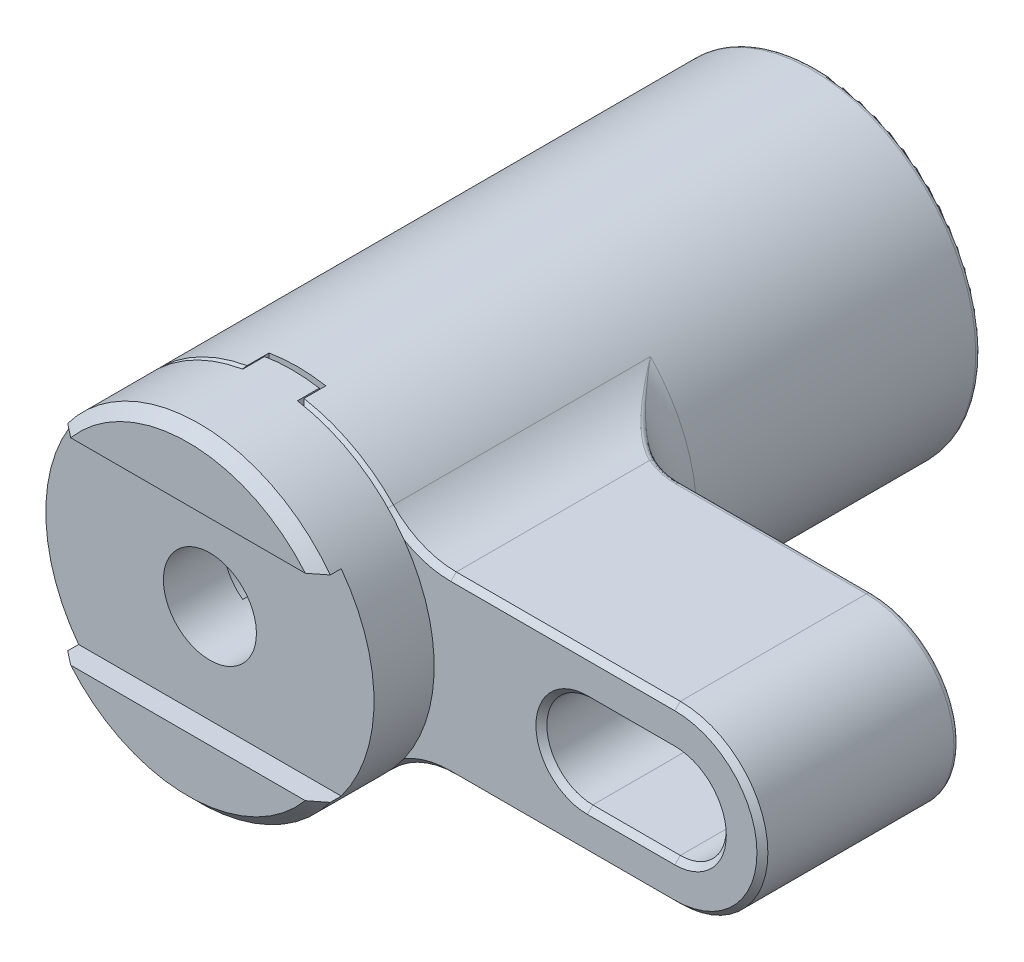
ISO-10303-21;
HEADER;
FILE_DESCRIPTION(('STEP AP214'),'2;1');
FILE_NAME('part.step','',(''),(''),'','','');
FILE_SCHEMA(('AUTOMOTIVE_DESIGN { 1 0 10303 214 1 1 1 1 }'));
ENDSEC;
DATA;
#1=APPLICATION_CONTEXT('core data for automotive mechanical design processes');
#2=APPLICATION_PROTOCOL_DEFINITION('international standard','automotive_design',2000,#1);
#3=PRODUCT_CONTEXT('',#1,'mechanical');
#4=PRODUCT('Part','Part','',(#3));
#5=PRODUCT_RELATED_PRODUCT_CATEGORY('part','',(#4));
#6=PRODUCT_DEFINITION_FORMATION('','',#4);
#7=PRODUCT_DEFINITION_CONTEXT('part definition',#1,'design');
#8=PRODUCT_DEFINITION('design','',#6,#7);
#9=PRODUCT_DEFINITION_SHAPE('','',#8);
#10=(LENGTH_UNIT() NAMED_UNIT(*) SI_UNIT(.MILLI.,.METRE.));
#11=(NAMED_UNIT(*) PLANE_ANGLE_UNIT() SI_UNIT($,.RADIAN.));
#12=(NAMED_UNIT(*) SI_UNIT($,.STERADIAN.) SOLID_ANGLE_UNIT());
#13=UNCERTAINTY_MEASURE_WITH_UNIT(LENGTH_MEASURE(1.E-05),#10,'distance_accuracy_value','');
#14=(GEOMETRIC_REPRESENTATION_CONTEXT(3) GLOBAL_UNCERTAINTY_ASSIGNED_CONTEXT((#13)) GLOBAL_UNIT_ASSIGNED_CONTEXT((#10,
#11,#12)) REPRESENTATION_CONTEXT('',''));
#15=CARTESIAN_POINT('',(0.,0.,0.));
#16=DIRECTION('',(0.,0.,1.));
#17=DIRECTION('',(1.,0.,0.));
#18=AXIS2_PLACEMENT_3D('',#15,#16,#17);
#19=CARTESIAN_POINT('',(0.,0.,50.));
#20=DIRECTION('',(0.,0.,-1.));
#21=DIRECTION('',(0.,1.,0.));
#22=AXIS2_PLACEMENT_3D('',#19,#20,#21);
#23=CYLINDRICAL_SURFACE('',#22,15.);
#24=CARTESIAN_POINT('',(-14.9596122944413,1.09999999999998,43.25));
#25=CARTESIAN_POINT('',(-14.9530459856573,1.18929971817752,43.198443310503));
#26=CARTESIAN_POINT('',(-14.9456789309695,1.2785558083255,43.1469131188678));
#27=CARTESIAN_POINT('',(-14.9297388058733,1.45264060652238,43.0464084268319));
#28=CARTESIAN_POINT('',(-14.9212413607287,1.53747452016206,42.9974309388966));
#29=CARTESIAN_POINT('',(-14.9032655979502,1.70271119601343,42.9020313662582));
#30=CARTESIAN_POINT('',(-14.8938591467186,1.78311988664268,42.8556060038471));
#31=CARTESIAN_POINT('',(-14.8742790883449,1.93950886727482,42.7653115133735));
#32=CARTESIAN_POINT('',(-14.8641735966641,2.01549557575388,42.7214387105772));
#33=CARTESIAN_POINT('',(-14.841321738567,2.17779169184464,42.6277363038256));
#34=CARTESIAN_POINT('',(-14.8284033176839,2.26408317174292,42.5779174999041));
#35=CARTESIAN_POINT('',(-14.8014751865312,2.43382137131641,42.4799214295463));
#36=CARTESIAN_POINT('',(-14.7875115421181,2.51727358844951,42.4317410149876));
#37=CARTESIAN_POINT('',(-14.7586305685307,2.68133138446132,42.3370221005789));
#38=CARTESIAN_POINT('',(-14.7437578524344,2.76194287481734,42.290480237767));
#39=CARTESIAN_POINT('',(-14.7131918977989,2.9203206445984,42.1990387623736));
#40=CARTESIAN_POINT('',(-14.6975418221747,2.99809318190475,42.154135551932));
#41=CARTESIAN_POINT('',(-14.6636172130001,3.16002221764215,42.0606454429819));
#42=CARTESIAN_POINT('',(-14.6452326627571,3.24416153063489,42.0120686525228));
#43=CARTESIAN_POINT('',(-14.6074342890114,3.41027158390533,41.9161665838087));
#44=CARTESIAN_POINT('',(-14.5880535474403,3.49224797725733,41.8688380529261));
#45=CARTESIAN_POINT('',(-14.5483618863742,3.6540307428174,41.7754327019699));
#46=CARTESIAN_POINT('',(-14.5280832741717,3.7338430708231,41.7293524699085));
#47=CARTESIAN_POINT('',(-14.4866925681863,3.8912986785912,41.6384439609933));
#48=CARTESIAN_POINT('',(-14.4656120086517,3.96894818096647,41.5936121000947));
#49=CARTESIAN_POINT('',(-14.4209025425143,4.12853905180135,41.5014720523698));
#50=CARTESIAN_POINT('',(-14.3971966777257,4.21046430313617,41.4541732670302));
#51=CARTESIAN_POINT('',(-14.3488044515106,4.37250846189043,41.3606182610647));
#52=CARTESIAN_POINT('',(-14.3241437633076,4.45263312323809,41.3143587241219));
#53=CARTESIAN_POINT('',(-14.2739190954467,4.61107490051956,41.2228823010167));
#54=CARTESIAN_POINT('',(-14.2483803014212,4.6893980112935,41.1776619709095));
#55=CARTESIAN_POINT('',(-14.196475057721,4.84423749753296,41.0882643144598));
#56=CARTESIAN_POINT('',(-14.1701333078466,4.92076008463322,41.0440834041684));
#57=CARTESIAN_POINT('',(-14.1431555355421,4.99711431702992,41.));
#58=B_SPLINE_CURVE_WITH_KNOTS('',3,(#24,#25,#26,#27,#28,#29,#30,#31,#32,#33,#34,#35,#36,#37,#38,
#39,#40,#41,#42,#43,#44,#45,#46,#47,#48,#49,#50,#51,#52,#53,#54,#55,#56,#57),.UNSPECIFIED.,.F.,
.F.,(4,2,2,2,2,2,2,2,2,2,2,2,2,2,2,2,4),(0.,0.309965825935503,0.604929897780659,
0.884892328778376,1.14985326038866,1.45126323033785,1.74335797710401,2.02613791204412,
2.29960349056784,2.59622998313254,2.88608426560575,3.16916716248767,3.44547955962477,
3.73803971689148,4.02527911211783,4.30719910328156,4.58380112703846),.UNSPECIFIED.);
#59=CARTESIAN_POINT('',(-14.9596122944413,1.1,43.25));
#60=VERTEX_POINT('',#59);
#61=CARTESIAN_POINT('',(-14.1431555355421,4.99711431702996,41.));
#62=VERTEX_POINT('',#61);
#63=EDGE_CURVE('E1340',#60,#62,#58,.T.);
#64=ORIENTED_EDGE('',*,*,#63,.T.);
#65=CARTESIAN_POINT('',(-14.1431555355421,4.99711431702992,41.));
#66=CARTESIAN_POINT('',(-14.1701316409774,4.92076480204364,40.9559193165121));
#67=CARTESIAN_POINT('',(-14.1964718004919,4.84424695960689,40.9117411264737));
#68=CARTESIAN_POINT('',(-14.2483750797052,4.68941384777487,40.8223471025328));
#69=CARTESIAN_POINT('',(-14.2739134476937,4.61109235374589,40.7771276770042));
#70=CARTESIAN_POINT('',(-14.3241383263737,4.45265064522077,40.6856512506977));
#71=CARTESIAN_POINT('',(-14.3487995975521,4.3725244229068,40.63939079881));
#72=CARTESIAN_POINT('',(-14.3971938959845,4.21047391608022,40.5458321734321));
#73=CARTESIAN_POINT('',(-14.420901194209,4.12854386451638,40.4985306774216));
#74=CARTESIAN_POINT('',(-14.4656091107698,3.96895852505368,40.4063939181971));
#75=CARTESIAN_POINT('',(-14.4866869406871,3.89131940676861,40.3615680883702));
#76=CARTESIAN_POINT('',(-14.5280743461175,3.73387773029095,40.2706676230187));
#77=CARTESIAN_POINT('',(-14.5483522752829,3.65406892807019,40.2245893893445));
#78=CARTESIAN_POINT('',(-14.588044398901,3.49228627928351,40.1311840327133));
#79=CARTESIAN_POINT('',(-14.6074261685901,3.410306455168,40.0838534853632));
#80=CARTESIAN_POINT('',(-14.6452280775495,3.24418251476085,39.987943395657));
#81=CARTESIAN_POINT('',(-14.6636150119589,3.16003272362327,39.939360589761));
#82=CARTESIAN_POINT('',(-14.697539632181,2.99810363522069,39.845870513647));
#83=CARTESIAN_POINT('',(-14.7131876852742,2.92034157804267,39.8009733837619));
#84=CARTESIAN_POINT('',(-14.7437512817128,2.76197784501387,39.7095400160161));
#85=CARTESIAN_POINT('',(-14.7586235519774,2.68136989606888,39.6630001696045));
#86=CARTESIAN_POINT('',(-14.7875049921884,2.51731218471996,39.5682812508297));
#87=CARTESIAN_POINT('',(-14.8014694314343,2.43385649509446,39.5200988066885));
#88=CARTESIAN_POINT('',(-14.8284001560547,2.26410428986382,39.4220946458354));
#89=CARTESIAN_POINT('',(-14.8413202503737,2.1778022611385,39.3722697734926));
#90=CARTESIAN_POINT('',(-14.8641727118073,2.01550186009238,39.2785649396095));
#91=CARTESIAN_POINT('',(-14.87427741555,1.93952144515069,39.234695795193));
#92=CARTESIAN_POINT('',(-14.8938566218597,1.78314088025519,39.144406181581));
#93=CARTESIAN_POINT('',(-14.9032629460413,1.7027343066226,39.0979820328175));
#94=CARTESIAN_POINT('',(-14.9212389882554,1.53749766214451,39.0025824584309));
#95=CARTESIAN_POINT('',(-14.9297367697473,1.45266165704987,38.9536037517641));
#96=CARTESIAN_POINT('',(-14.9456778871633,1.27856845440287,38.8530941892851));
#97=CARTESIAN_POINT('',(-14.9530455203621,1.18930604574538,38.8015603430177));
#98=CARTESIAN_POINT('',(-14.9596122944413,1.09999999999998,38.75));
#99=B_SPLINE_CURVE_WITH_KNOTS('',3,(#65,#66,#67,#68,#69,#70,#71,#72,#73,#74,#75,#76,#77,#78,#79,
#80,#81,#82,#83,#84,#85,#86,#87,#88,#89,#90,#91,#92,#93,#94,#95,#96,#97,#98),.UNSPECIFIED.,.F.,
.F.,(4,2,2,2,2,2,2,2,2,2,2,2,2,2,2,2,4),(0.,0.276584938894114,0.558499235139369,
0.845744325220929,1.13832156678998,1.41459702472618,1.69766760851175,1.98753420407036,
2.28419763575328,2.55762636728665,2.84039401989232,3.13250104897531,3.43394786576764,
3.69888683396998,3.97884194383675,4.27381333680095,4.58380112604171),.UNSPECIFIED.);
#100=CARTESIAN_POINT('',(-14.9596122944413,1.1,38.75));
#101=VERTEX_POINT('',#100);
#102=EDGE_CURVE('E1305',#62,#101,#99,.T.);
#103=ORIENTED_EDGE('',*,*,#102,.T.);
#104=DIRECTION('',(0.,0.,-1.));
#105=VECTOR('',#104,1.);
#106=CARTESIAN_POINT('',(-14.9596122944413,1.1,50.));
#107=LINE('',#106,#105);
#108=CARTESIAN_POINT('',(-14.9596122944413,1.1,39.75));
#109=VERTEX_POINT('',#108);
#110=EDGE_CURVE('E2090',#109,#101,#107,.T.);
#111=ORIENTED_EDGE('',*,*,#110,.F.);
#112=CARTESIAN_POINT('',(0.,0.,39.75));
#113=DIRECTION('',(0.,0.,1.));
#114=DIRECTION('',(0.,1.,0.));
#115=AXIS2_PLACEMENT_3D('',#112,#113,#114);
#116=CIRCLE('',#115,15.);
#117=CARTESIAN_POINT('',(-14.1421356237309,-5.,39.75));
#118=VERTEX_POINT('',#117);
#119=EDGE_CURVE('E2077',#109,#118,#116,.T.);
#120=ORIENTED_EDGE('',*,*,#119,.T.);
#121=DIRECTION('',(0.,0.,-1.));
#122=VECTOR('',#121,1.);
#123=CARTESIAN_POINT('',(-14.1421356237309,-5.,50.));
#124=LINE('',#123,#122);
#125=CARTESIAN_POINT('',(-14.1421356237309,-5.,42.25));
#126=VERTEX_POINT('',#125);
#127=EDGE_CURVE('E2113',#126,#118,#124,.T.);
#128=ORIENTED_EDGE('',*,*,#127,.F.);
#129=CARTESIAN_POINT('',(0.,0.,42.25));
#130=DIRECTION('',(0.,0.,-1.));
#131=DIRECTION('',(0.,-1.,0.));
#132=AXIS2_PLACEMENT_3D('',#129,#130,#131);
#133=CIRCLE('',#132,15.);
#134=CARTESIAN_POINT('',(-14.9596122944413,1.1,42.25));
#135=VERTEX_POINT('',#134);
#136=EDGE_CURVE('E2118',#126,#135,#133,.T.);
#137=ORIENTED_EDGE('',*,*,#136,.T.);
#138=DIRECTION('',(0.,0.,-1.));
#139=VECTOR('',#138,1.);
#140=CARTESIAN_POINT('',(-14.9596122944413,1.1,50.));
#141=LINE('',#140,#139);
#142=EDGE_CURVE('E1346',#60,#135,#141,.T.);
#143=ORIENTED_EDGE('',*,*,#142,.F.);
#144=EDGE_LOOP('',(#64,#103,#111,#120,#128,#137,#143));
#145=FACE_BOUND('',#144,.T.);
#146=ADVANCED_FACE('F14',(#145),#23,.T.);
#147=CARTESIAN_POINT('',(-13.8421356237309,-5.,50.));
#148=DIRECTION('',(0.,-1.,0.));
#149=DIRECTION('',(-1.,0.,0.));
#150=AXIS2_PLACEMENT_3D('',#147,#148,#149);
#151=PLANE('',#150);
#152=ORIENTED_EDGE('',*,*,#127,.T.);
#153=DIRECTION('',(-1.,0.,0.));
#154=VECTOR('',#153,1.);
#155=CARTESIAN_POINT('',(-13.8421356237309,-5.,39.75));
#156=LINE('',#155,#154);
#157=CARTESIAN_POINT('',(-13.8421356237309,-5.,39.75));
#158=VERTEX_POINT('',#157);
#159=EDGE_CURVE('E2083',#158,#118,#156,.T.);
#160=ORIENTED_EDGE('',*,*,#159,.F.);
#161=DIRECTION('',(0.,0.,-1.));
#162=VECTOR('',#161,1.);
#163=CARTESIAN_POINT('',(-13.8421356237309,-5.,50.));
#164=LINE('',#163,#162);
#165=CARTESIAN_POINT('',(-13.8421356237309,-5.,42.25));
#166=VERTEX_POINT('',#165);
#167=EDGE_CURVE('E2111',#166,#158,#164,.T.);
#168=ORIENTED_EDGE('',*,*,#167,.F.);
#169=DIRECTION('',(-1.,0.,0.));
#170=VECTOR('',#169,1.);
#171=CARTESIAN_POINT('',(-13.8421356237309,-5.,42.25));
#172=LINE('',#171,#170);
#173=EDGE_CURVE('E2122',#166,#126,#172,.T.);
#174=ORIENTED_EDGE('',*,*,#173,.T.);
#175=EDGE_LOOP('',(#152,#160,#168,#174));
#176=FACE_BOUND('',#175,.T.);
#177=ADVANCED_FACE('F1264',(#176),#151,.T.);
#178=CARTESIAN_POINT('',(-13.8421356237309,-5.,39.75));
#179=DIRECTION('',(0.,0.,1.));
#180=DIRECTION('',(0.,-1.,0.));
#181=AXIS2_PLACEMENT_3D('',#178,#179,#180);
#182=PLANE('',#181);
#183=ORIENTED_EDGE('',*,*,#119,.F.);
#184=DIRECTION('',(-1.,0.,0.));
#185=VECTOR('',#184,1.);
#186=CARTESIAN_POINT('',(-14.6596122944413,1.1,39.75));
#187=LINE('',#186,#185);
#188=CARTESIAN_POINT('',(-14.6596122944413,1.1,39.75));
#189=VERTEX_POINT('',#188);
#190=EDGE_CURVE('E2080',#189,#109,#187,.T.);
#191=ORIENTED_EDGE('',*,*,#190,.F.);
#192=CARTESIAN_POINT('',(0.3,0.,39.75));
#193=DIRECTION('',(0.,0.,1.));
#194=DIRECTION('',(0.,1.,0.));
#195=AXIS2_PLACEMENT_3D('',#192,#193,#194);
#196=CIRCLE('',#195,15.);
#197=EDGE_CURVE('E2087',#189,#158,#196,.T.);
#198=ORIENTED_EDGE('',*,*,#197,.T.);
#199=ORIENTED_EDGE('',*,*,#159,.T.);
#200=EDGE_LOOP('',(#183,#191,#198,#199));
#201=FACE_BOUND('',#200,.T.);
#202=ADVANCED_FACE('F1270',(#201),#182,.F.);
#203=CARTESIAN_POINT('',(-14.6596122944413,1.1,50.));
#204=DIRECTION('',(0.,-1.,0.));
#205=DIRECTION('',(-1.,0.,0.));
#206=AXIS2_PLACEMENT_3D('',#203,#204,#205);
#207=PLANE('',#206);
#208=ORIENTED_EDGE('',*,*,#110,.T.);
#209=DIRECTION('',(-1.,0.,0.));
#210=VECTOR('',#209,1.);
#211=CARTESIAN_POINT('',(-14.6596122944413,1.1,38.75));
#212=LINE('',#211,#210);
#213=CARTESIAN_POINT('',(-14.6596122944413,1.1,38.75));
#214=VERTEX_POINT('',#213);
#215=EDGE_CURVE('E2092',#214,#101,#212,.T.);
#216=ORIENTED_EDGE('',*,*,#215,.F.);
#217=DIRECTION('',(0.,0.,-1.));
#218=VECTOR('',#217,1.);
#219=CARTESIAN_POINT('',(-14.6596122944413,1.1,50.));
#220=LINE('',#219,#218);
#221=EDGE_CURVE('E1293',#189,#214,#220,.T.);
#222=ORIENTED_EDGE('',*,*,#221,.F.);
#223=ORIENTED_EDGE('',*,*,#190,.T.);
#224=EDGE_LOOP('',(#208,#216,#222,#223));
#225=FACE_BOUND('',#224,.T.);
#226=ADVANCED_FACE('F1323',(#225),#207,.T.);
#227=CARTESIAN_POINT('',(-14.6596122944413,1.1,38.75));
#228=DIRECTION('',(0.,-0.5,0.866025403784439));
#229=DIRECTION('',(0.,-0.866025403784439,-0.5));
#230=AXIS2_PLACEMENT_3D('',#227,#228,#229);
#231=PLANE('',#230);
#232=ORIENTED_EDGE('',*,*,#102,.F.);
#233=DIRECTION('',(-1.,0.,0.));
#234=VECTOR('',#233,1.);
#235=CARTESIAN_POINT('',(-13.8431555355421,4.99711431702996,41.));
#236=LINE('',#235,#234);
#237=CARTESIAN_POINT('',(-13.8431555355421,4.99711431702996,41.));
#238=VERTEX_POINT('',#237);
#239=EDGE_CURVE('E1373',#238,#62,#236,.T.);
#240=ORIENTED_EDGE('',*,*,#239,.F.);
#241=CARTESIAN_POINT('',(-13.8431555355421,4.99711431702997,41.));
#242=CARTESIAN_POINT('',(-14.1762655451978,4.05413520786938,40.4555707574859));
#243=CARTESIAN_POINT('',(-14.3812686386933,3.0757683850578,39.8907104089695));
#244=CARTESIAN_POINT('',(-14.5861745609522,2.09786530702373,39.3261178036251));
#245=CARTESIAN_POINT('',(-14.6596122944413,1.1,38.75));
#246=B_SPLINE_CURVE_WITH_KNOTS('',2,(#241,#242,#243,#244,#245),.UNSPECIFIED.,.F.,.F.,(3,2,3),
(0.,0.5,1.),.UNSPECIFIED.);
#247=EDGE_CURVE('E2095',#238,#214,#246,.T.);
#248=ORIENTED_EDGE('',*,*,#247,.T.);
#249=ORIENTED_EDGE('',*,*,#215,.T.);
#250=EDGE_LOOP('',(#232,#240,#248,#249));
#251=FACE_BOUND('',#250,.T.);
#252=ADVANCED_FACE('F1312',(#251),#231,.F.);
#253=CARTESIAN_POINT('',(-13.8431555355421,4.99711431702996,41.));
#254=DIRECTION('',(0.,-0.5,-0.866025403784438));
#255=DIRECTION('',(0.,0.866025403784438,-0.5));
#256=AXIS2_PLACEMENT_3D('',#253,#254,#255);
#257=PLANE('',#256);
#258=ORIENTED_EDGE('',*,*,#63,.F.);
#259=DIRECTION('',(-1.,0.,0.));
#260=VECTOR('',#259,1.);
#261=CARTESIAN_POINT('',(-14.6596122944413,1.1,43.25));
#262=LINE('',#261,#260);
#263=CARTESIAN_POINT('',(-14.6596122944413,1.1,43.25));
#264=VERTEX_POINT('',#263);
#265=EDGE_CURVE('E132',#264,#60,#262,.T.);
#266=ORIENTED_EDGE('',*,*,#265,.F.);
#267=CARTESIAN_POINT('',(-14.6596122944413,1.09999999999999,43.25));
#268=CARTESIAN_POINT('',(-14.5862096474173,2.09738855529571,42.6741574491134));
#269=CARTESIAN_POINT('',(-14.3812686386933,3.07576838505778,42.1092895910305));
#270=CARTESIAN_POINT('',(-14.176424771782,4.05368446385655,41.5446894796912));
#271=CARTESIAN_POINT('',(-13.8431555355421,4.99711431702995,41.));
#272=B_SPLINE_CURVE_WITH_KNOTS('',2,(#267,#268,#269,#270,#271),.UNSPECIFIED.,.F.,.F.,(3,2,3),
(0.,0.5,1.),.UNSPECIFIED.);
#273=EDGE_CURVE('E998',#264,#238,#272,.T.);
#274=ORIENTED_EDGE('',*,*,#273,.T.);
#275=ORIENTED_EDGE('',*,*,#239,.T.);
#276=EDGE_LOOP('',(#258,#266,#274,#275));
#277=FACE_BOUND('',#276,.T.);
#278=ADVANCED_FACE('F1322',(#277),#257,.F.);
#279=CARTESIAN_POINT('',(-14.6596122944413,1.1,50.));
#280=DIRECTION('',(0.,-1.,0.));
#281=DIRECTION('',(-1.,0.,0.));
#282=AXIS2_PLACEMENT_3D('',#279,#280,#281);
#283=PLANE('',#282);
#284=ORIENTED_EDGE('',*,*,#142,.T.);
#285=DIRECTION('',(-1.,0.,0.));
#286=VECTOR('',#285,1.);
#287=CARTESIAN_POINT('',(-14.6596122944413,1.1,42.25));
#288=LINE('',#287,#286);
#289=CARTESIAN_POINT('',(-14.6596122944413,1.1,42.25));
#290=VERTEX_POINT('',#289);
#291=EDGE_CURVE('E1291',#290,#135,#288,.T.);
#292=ORIENTED_EDGE('',*,*,#291,.F.);
#293=DIRECTION('',(0.,0.,-1.));
#294=VECTOR('',#293,1.);
#295=CARTESIAN_POINT('',(-14.6596122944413,1.1,50.));
#296=LINE('',#295,#294);
#297=EDGE_CURVE('E1343',#264,#290,#296,.T.);
#298=ORIENTED_EDGE('',*,*,#297,.F.);
#299=ORIENTED_EDGE('',*,*,#265,.T.);
#300=EDGE_LOOP('',(#284,#292,#298,#299));
#301=FACE_BOUND('',#300,.T.);
#302=ADVANCED_FACE('F1276',(#301),#283,.T.);
#303=CARTESIAN_POINT('',(-14.6596122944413,1.1,42.25));
#304=DIRECTION('',(0.,0.,-1.));
#305=DIRECTION('',(0.,1.,0.));
#306=AXIS2_PLACEMENT_3D('',#303,#304,#305);
#307=PLANE('',#306);
#308=ORIENTED_EDGE('',*,*,#136,.F.);
#309=ORIENTED_EDGE('',*,*,#173,.F.);
#310=CARTESIAN_POINT('',(0.3,0.,42.25));
#311=DIRECTION('',(0.,0.,-1.));
#312=DIRECTION('',(0.,-1.,0.));
#313=AXIS2_PLACEMENT_3D('',#310,#311,#312);
#314=CIRCLE('',#313,15.);
#315=EDGE_CURVE('E2121',#166,#290,#314,.T.);
#316=ORIENTED_EDGE('',*,*,#315,.T.);
#317=ORIENTED_EDGE('',*,*,#291,.T.);
#318=EDGE_LOOP('',(#308,#309,#316,#317));
#319=FACE_BOUND('',#318,.T.);
#320=ADVANCED_FACE('F2057',(#319),#307,.F.);
#321=CARTESIAN_POINT('',(0.,0.,32.));
#322=DIRECTION('',(0.,0.,1.));
#323=DIRECTION('',(0.,-1.,0.));
#324=AXIS2_PLACEMENT_3D('',#321,#322,#323);
#325=PLANE('',#324);
#326=CARTESIAN_POINT('',(29.,0.,32.));
#327=DIRECTION('',(0.,0.,-1.));
#328=DIRECTION('',(0.,-1.,0.));
#329=AXIS2_PLACEMENT_3D('',#326,#327,#328);
#330=CIRCLE('',#329,4.7);
#331=CARTESIAN_POINT('',(29.,-4.7,32.));
#332=VERTEX_POINT('',#331);
#333=CARTESIAN_POINT('',(29.,4.7,32.));
#334=VERTEX_POINT('',#333);
#335=EDGE_CURVE('E2045',#332,#334,#330,.T.);
#336=ORIENTED_EDGE('',*,*,#335,.F.);
#337=DIRECTION('',(-1.,0.,0.));
#338=VECTOR('',#337,1.);
#339=CARTESIAN_POINT('',(0.,-4.7,32.));
#340=LINE('',#339,#338);
#341=CARTESIAN_POINT('',(37.,-4.7,32.));
#342=VERTEX_POINT('',#341);
#343=EDGE_CURVE('E2025',#342,#332,#340,.T.);
#344=ORIENTED_EDGE('',*,*,#343,.F.);
#345=CARTESIAN_POINT('',(37.,0.,32.));
#346=DIRECTION('',(0.,0.,-1.));
#347=DIRECTION('',(0.,-1.,0.));
#348=AXIS2_PLACEMENT_3D('',#345,#346,#347);
#349=CIRCLE('',#348,4.7);
#350=CARTESIAN_POINT('',(37.,4.7,32.));
#351=VERTEX_POINT('',#350);
#352=EDGE_CURVE('E1142',#351,#342,#349,.T.);
#353=ORIENTED_EDGE('',*,*,#352,.F.);
#354=DIRECTION('',(1.,0.,0.));
#355=VECTOR('',#354,1.);
#356=CARTESIAN_POINT('',(0.,4.7,32.));
#357=LINE('',#356,#355);
#358=EDGE_CURVE('E2043',#334,#351,#357,.T.);
#359=ORIENTED_EDGE('',*,*,#358,.F.);
#360=EDGE_LOOP('',(#336,#344,#353,#359));
#361=FACE_BOUND('',#360,.T.);
#362=CARTESIAN_POINT('',(37.,0.,32.));
#363=DIRECTION('',(0.,0.,-1.));
#364=DIRECTION('',(0.,-1.,0.));
#365=AXIS2_PLACEMENT_3D('',#362,#363,#364);
#366=CIRCLE('',#365,7.5);
#367=CARTESIAN_POINT('',(37.,-7.5,32.));
#368=VERTEX_POINT('',#367);
#369=CARTESIAN_POINT('',(37.,7.5,32.));
#370=VERTEX_POINT('',#369);
#371=EDGE_CURVE('E1518',#368,#370,#366,.F.);
#372=ORIENTED_EDGE('',*,*,#371,.F.);
#373=DIRECTION('',(-1.,0.,0.));
#374=VECTOR('',#373,1.);
#375=CARTESIAN_POINT('',(0.,-7.5,32.));
#376=LINE('',#375,#374);
#377=CARTESIAN_POINT('',(19.6150452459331,-7.5,32.));
#378=VERTEX_POINT('',#377);
#379=EDGE_CURVE('E1520',#378,#368,#376,.F.);
#380=ORIENTED_EDGE('',*,*,#379,.F.);
#381=CARTESIAN_POINT('',(0.,0.,32.));
#382=DIRECTION('',(0.,0.,-1.));
#383=DIRECTION('',(0.,-1.,0.));
#384=AXIS2_PLACEMENT_3D('',#381,#382,#383);
#385=CIRCLE('',#384,21.);
#386=CARTESIAN_POINT('',(19.6150452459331,7.5,32.));
#387=VERTEX_POINT('',#386);
#388=EDGE_CURVE('E1465',#387,#378,#385,.T.);
#389=ORIENTED_EDGE('',*,*,#388,.F.);
#390=DIRECTION('',(1.,0.,0.));
#391=VECTOR('',#390,1.);
#392=CARTESIAN_POINT('',(0.,7.5,32.));
#393=LINE('',#392,#391);
#394=EDGE_CURVE('E1175',#370,#387,#393,.F.);
#395=ORIENTED_EDGE('',*,*,#394,.F.);
#396=EDGE_LOOP('',(#372,#380,#389,#395));
#397=FACE_BOUND('',#396,.T.);
#398=ADVANCED_FACE('F1206',(#361,#397),#325,.F.);
#399=CARTESIAN_POINT('',(0.,0.,0.));
#400=DIRECTION('',(0.,0.,1.));
#401=DIRECTION('',(0.,-1.,0.));
#402=AXIS2_PLACEMENT_3D('',#399,#400,#401);
#403=PLANE('',#402);
#404=CARTESIAN_POINT('',(0.,0.,0.));
#405=DIRECTION('',(0.,0.,-1.));
#406=DIRECTION('',(0.,-1.,0.));
#407=AXIS2_PLACEMENT_3D('',#404,#405,#406);
#408=CIRCLE('',#407,11.5);
#409=CARTESIAN_POINT('',(0.,-11.5,0.));
#410=VERTEX_POINT('',#409);
#411=EDGE_CURVE('E800',#410,#410,#408,.T.);
#412=ORIENTED_EDGE('',*,*,#411,.F.);
#413=EDGE_LOOP('',(#412));
#414=FACE_BOUND('',#413,.T.);
#415=CARTESIAN_POINT('',(0.,0.,0.));
#416=DIRECTION('',(0.,0.,-1.));
#417=DIRECTION('',(0.,-1.,0.));
#418=AXIS2_PLACEMENT_3D('',#415,#416,#417);
#419=CIRCLE('',#418,14.5);
#420=CARTESIAN_POINT('',(0.,-14.5,0.));
#421=VERTEX_POINT('',#420);
#422=EDGE_CURVE('E1462',#421,#421,#419,.F.);
#423=ORIENTED_EDGE('',*,*,#422,.F.);
#424=EDGE_LOOP('',(#423));
#425=FACE_BOUND('',#424,.T.);
#426=ADVANCED_FACE('F959',(#414,#425),#403,.F.);
#427=CARTESIAN_POINT('',(0.3,0.,50.));
#428=DIRECTION('',(0.,0.,-1.));
#429=DIRECTION('',(0.,1.,0.));
#430=AXIS2_PLACEMENT_3D('',#427,#428,#429);
#431=CYLINDRICAL_SURFACE('',#430,15.);
#432=DIRECTION('',(0.,0.,-1.));
#433=VECTOR('',#432,1.);
#434=CARTESIAN_POINT('',(-13.4477270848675,6.,50.));
#435=LINE('',#434,#433);
#436=CARTESIAN_POINT('',(-13.4477270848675,6.,42.75));
#437=VERTEX_POINT('',#436);
#438=CARTESIAN_POINT('',(-13.4477270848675,6.,39.25));
#439=VERTEX_POINT('',#438);
#440=EDGE_CURVE('E2504',#437,#439,#435,.T.);
#441=ORIENTED_EDGE('',*,*,#440,.T.);
#442=CARTESIAN_POINT('',(-13.8421356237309,5.,38.25));
#443=CARTESIAN_POINT('',(-13.8078070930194,5.09709574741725,38.25));
#444=CARTESIAN_POINT('',(-13.7721272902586,5.19471499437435,38.2643679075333));
#445=CARTESIAN_POINT('',(-13.7371775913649,5.28749896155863,38.2922190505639));
#446=CARTESIAN_POINT('',(-13.6972111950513,5.39360118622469,38.3240679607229));
#447=CARTESIAN_POINT('',(-13.6572676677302,5.49583778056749,38.3743921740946));
#448=CARTESIAN_POINT('',(-13.6208646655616,5.58654875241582,38.4400860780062));
#449=CARTESIAN_POINT('',(-13.5870856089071,5.67072123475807,38.5010447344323));
#450=CARTESIAN_POINT('',(-13.5555786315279,5.74695662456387,38.5767152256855));
#451=CARTESIAN_POINT('',(-13.5293984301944,5.80928042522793,38.662577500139));
#452=CARTESIAN_POINT('',(-13.5041894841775,5.86929208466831,38.7452543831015));
#453=CARTESIAN_POINT('',(-13.4833613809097,5.91778682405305,38.8394604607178));
#454=CARTESIAN_POINT('',(-13.4693260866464,5.95026546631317,38.9385589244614));
#455=CARTESIAN_POINT('',(-13.4552707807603,5.98279041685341,39.0377986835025));
#456=CARTESIAN_POINT('',(-13.4477270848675,6.,39.1446247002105));
#457=CARTESIAN_POINT('',(-13.4477270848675,6.,39.25));
#458=B_SPLINE_CURVE_WITH_KNOTS('',3,(#442,#443,#444,#445,#446,#447,#448,#449,#450,#451,#452,
#453,#454,#455,#456,#457),.UNSPECIFIED.,.F.,.F.,(4,3,3,3,3,4),(0.,0.190044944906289,
0.408054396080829,0.61016030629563,0.804833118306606,1.),.UNSPECIFIED.);
#459=CARTESIAN_POINT('',(-13.8421356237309,5.,38.25));
#460=VERTEX_POINT('',#459);
#461=EDGE_CURVE('E2533',#439,#460,#458,.F.);
#462=ORIENTED_EDGE('',*,*,#461,.T.);
#463=CARTESIAN_POINT('',(0.3,0.,38.25));
#464=DIRECTION('',(0.,0.,1.));
#465=DIRECTION('',(0.,1.,0.));
#466=AXIS2_PLACEMENT_3D('',#463,#464,#465);
#467=CIRCLE('',#466,15.);
#468=CARTESIAN_POINT('',(-13.8421356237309,-5.,38.25));
#469=VERTEX_POINT('',#468);
#470=EDGE_CURVE('E860',#460,#469,#467,.T.);
#471=ORIENTED_EDGE('',*,*,#470,.T.);
#472=CARTESIAN_POINT('',(-13.4477270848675,-6.,39.25));
#473=CARTESIAN_POINT('',(-13.4477270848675,-6.,39.2007896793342));
#474=CARTESIAN_POINT('',(-13.4493259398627,-5.99634041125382,39.15142243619));
#475=CARTESIAN_POINT('',(-13.452473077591,-5.98911381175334,39.1028474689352));
#476=CARTESIAN_POINT('',(-13.4598396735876,-5.9721983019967,38.9891466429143));
#477=CARTESIAN_POINT('',(-13.4761210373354,-5.9347998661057,38.8773059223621));
#478=CARTESIAN_POINT('',(-13.4988501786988,-5.88147377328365,38.7777670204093));
#479=CARTESIAN_POINT('',(-13.523257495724,-5.8242104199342,38.6708787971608));
#480=CARTESIAN_POINT('',(-13.5558000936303,-5.74682987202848,38.574552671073));
#481=CARTESIAN_POINT('',(-13.5920761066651,-5.65775763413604,38.4967703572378));
#482=CARTESIAN_POINT('',(-13.6290636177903,-5.56693838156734,38.4174624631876));
#483=CARTESIAN_POINT('',(-13.6710156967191,-5.4612177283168,38.3548014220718));
#484=CARTESIAN_POINT('',(-13.7134853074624,-5.34997472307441,38.3132408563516));
#485=CARTESIAN_POINT('',(-13.7559369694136,-5.23877873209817,38.2716978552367));
#486=CARTESIAN_POINT('',(-13.800113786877,-5.11885570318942,38.25));
#487=CARTESIAN_POINT('',(-13.8421356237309,-5.,38.25));
#488=B_SPLINE_CURVE_WITH_KNOTS('',3,(#472,#473,#474,#475,#476,#477,#478,#479,#480,#481,#482,
#483,#484,#485,#486,#487),.UNSPECIFIED.,.F.,.F.,(4,3,3,3,3,4),(0.,0.089943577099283,
0.303448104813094,0.532847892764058,0.766527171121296,1.),.UNSPECIFIED.);
#489=CARTESIAN_POINT('',(-13.4477270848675,-6.,39.25));
#490=VERTEX_POINT('',#489);
#491=EDGE_CURVE('E2553',#469,#490,#488,.F.);
#492=ORIENTED_EDGE('',*,*,#491,.T.);
#493=DIRECTION('',(0.,0.,-1.));
#494=VECTOR('',#493,1.);
#495=CARTESIAN_POINT('',(-13.4477270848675,-6.,50.));
#496=LINE('',#495,#494);
#497=CARTESIAN_POINT('',(-13.4477270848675,-6.,42.75));
#498=VERTEX_POINT('',#497);
#499=EDGE_CURVE('E2563',#498,#490,#496,.T.);
#500=ORIENTED_EDGE('',*,*,#499,.F.);
#501=CARTESIAN_POINT('',(-13.8421356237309,-5.,43.75));
#502=CARTESIAN_POINT('',(-13.8078070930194,-5.09709574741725,43.75));
#503=CARTESIAN_POINT('',(-13.7721272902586,-5.19471499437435,43.7356320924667));
#504=CARTESIAN_POINT('',(-13.7371775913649,-5.28749896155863,43.7077809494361));
#505=CARTESIAN_POINT('',(-13.6972111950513,-5.39360118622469,43.6759320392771));
#506=CARTESIAN_POINT('',(-13.6572676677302,-5.49583778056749,43.6256078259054));
#507=CARTESIAN_POINT('',(-13.6208646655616,-5.58654875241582,43.5599139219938));
#508=CARTESIAN_POINT('',(-13.5870856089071,-5.67072123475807,43.4989552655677));
#509=CARTESIAN_POINT('',(-13.5555786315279,-5.74695662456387,43.4232847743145));
#510=CARTESIAN_POINT('',(-13.5293984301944,-5.80928042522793,43.337422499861));
#511=CARTESIAN_POINT('',(-13.5041894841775,-5.86929208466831,43.2547456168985));
#512=CARTESIAN_POINT('',(-13.4833613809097,-5.91778682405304,43.1605395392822));
#513=CARTESIAN_POINT('',(-13.4693260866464,-5.95026546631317,43.0614410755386));
#514=CARTESIAN_POINT('',(-13.4552707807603,-5.98279041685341,42.9622013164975));
#515=CARTESIAN_POINT('',(-13.4477270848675,-6.,42.8553752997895));
#516=CARTESIAN_POINT('',(-13.4477270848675,-6.,42.75));
#517=B_SPLINE_CURVE_WITH_KNOTS('',3,(#501,#502,#503,#504,#505,#506,#507,#508,#509,#510,#511,
#512,#513,#514,#515,#516),.UNSPECIFIED.,.F.,.F.,(4,3,3,3,3,4),(0.,0.190044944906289,
0.408054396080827,0.610160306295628,0.804833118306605,1.),.UNSPECIFIED.);
#518=CARTESIAN_POINT('',(-13.8421356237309,-5.,43.75));
#519=VERTEX_POINT('',#518);
#520=EDGE_CURVE('E941',#498,#519,#517,.F.);
#521=ORIENTED_EDGE('',*,*,#520,.T.);
#522=CARTESIAN_POINT('',(0.3,0.,43.75));
#523=DIRECTION('',(0.,0.,-1.));
#524=DIRECTION('',(0.,-1.,0.));
#525=AXIS2_PLACEMENT_3D('',#522,#523,#524);
#526=CIRCLE('',#525,15.);
#527=CARTESIAN_POINT('',(-13.8421356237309,5.,43.75));
#528=VERTEX_POINT('',#527);
#529=EDGE_CURVE('E924',#519,#528,#526,.T.);
#530=ORIENTED_EDGE('',*,*,#529,.T.);
#531=CARTESIAN_POINT('',(-13.4477270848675,6.,42.75));
#532=CARTESIAN_POINT('',(-13.4477270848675,6.,42.7992103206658));
#533=CARTESIAN_POINT('',(-13.4493259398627,5.99634041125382,42.84857756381));
#534=CARTESIAN_POINT('',(-13.452473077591,5.98911381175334,42.8971525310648));
#535=CARTESIAN_POINT('',(-13.4598396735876,5.9721983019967,43.0108533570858));
#536=CARTESIAN_POINT('',(-13.4761210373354,5.9347998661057,43.1226940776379));
#537=CARTESIAN_POINT('',(-13.4988501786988,5.88147377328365,43.2222329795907));
#538=CARTESIAN_POINT('',(-13.523257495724,5.8242104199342,43.3291212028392));
#539=CARTESIAN_POINT('',(-13.5558000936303,5.74682987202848,43.425447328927));
#540=CARTESIAN_POINT('',(-13.5920761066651,5.65775763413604,43.5032296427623));
#541=CARTESIAN_POINT('',(-13.6290636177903,5.56693838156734,43.5825375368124));
#542=CARTESIAN_POINT('',(-13.6710156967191,5.4612177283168,43.6451985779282));
#543=CARTESIAN_POINT('',(-13.7134853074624,5.34997472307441,43.6867591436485));
#544=CARTESIAN_POINT('',(-13.7559369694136,5.23877873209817,43.7283021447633));
#545=CARTESIAN_POINT('',(-13.800113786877,5.11885570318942,43.75));
#546=CARTESIAN_POINT('',(-13.8421356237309,5.,43.75));
#547=B_SPLINE_CURVE_WITH_KNOTS('',3,(#531,#532,#533,#534,#535,#536,#537,#538,#539,#540,#541,
#542,#543,#544,#545,#546),.UNSPECIFIED.,.F.,.F.,(4,3,3,3,3,4),(0.,0.089943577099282,
0.303448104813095,0.532847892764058,0.766527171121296,1.),.UNSPECIFIED.);
#548=EDGE_CURVE('E1345',#528,#437,#547,.F.);
#549=ORIENTED_EDGE('',*,*,#548,.T.);
#550=EDGE_LOOP('',(#441,#462,#471,#492,#500,#521,#530,#549));
#551=FACE_BOUND('',#550,.T.);
#552=ORIENTED_EDGE('',*,*,#315,.F.);
#553=ORIENTED_EDGE('',*,*,#167,.T.);
#554=ORIENTED_EDGE('',*,*,#197,.F.);
#555=ORIENTED_EDGE('',*,*,#221,.T.);
#556=ORIENTED_EDGE('',*,*,#247,.F.);
#557=ORIENTED_EDGE('',*,*,#273,.F.);
#558=ORIENTED_EDGE('',*,*,#297,.T.);
#559=EDGE_LOOP('',(#552,#553,#554,#555,#556,#557,#558));
#560=FACE_BOUND('',#559,.T.);
#561=ADVANCED_FACE('F677',(#551,#560),#431,.T.);
#562=CARTESIAN_POINT('',(0.,0.,1.5));
#563=DIRECTION('',(0.,0.,1.));
#564=DIRECTION('',(0.,-1.,0.));
#565=AXIS2_PLACEMENT_3D('',#562,#563,#564);
#566=TOROIDAL_SURFACE('',#565,11.5,1.5);
#567=CARTESIAN_POINT('',(0.,0.,1.5));
#568=DIRECTION('',(0.,0.,-1.));
#569=DIRECTION('',(0.,-1.,0.));
#570=AXIS2_PLACEMENT_3D('',#567,#568,#569);
#571=CIRCLE('',#570,10.);
#572=CARTESIAN_POINT('',(0.,-10.,1.5));
#573=VERTEX_POINT('',#572);
#574=EDGE_CURVE('E813',#573,#573,#571,.F.);
#575=ORIENTED_EDGE('',*,*,#574,.T.);
#576=EDGE_LOOP('',(#575));
#577=FACE_BOUND('',#576,.T.);
#578=ORIENTED_EDGE('',*,*,#411,.T.);
#579=EDGE_LOOP('',(#578));
#580=FACE_BOUND('',#579,.T.);
#581=ADVANCED_FACE('F673',(#577,#580),#566,.T.);
#582=CARTESIAN_POINT('',(0.,4.7,32.5));
#583=DIRECTION('',(1.,0.,0.));
#584=DIRECTION('',(0.,-1.,0.));
#585=AXIS2_PLACEMENT_3D('',#582,#583,#584);
#586=CYLINDRICAL_SURFACE('',#585,0.5);
#587=CARTESIAN_POINT('',(29.,4.7,32.5));
#588=DIRECTION('',(-1.,0.,0.));
#589=DIRECTION('',(0.,-1.,0.));
#590=AXIS2_PLACEMENT_3D('',#587,#588,#589);
#591=CIRCLE('',#590,0.5);
#592=CARTESIAN_POINT('',(29.,4.2,32.5));
#593=VERTEX_POINT('',#592);
#594=EDGE_CURVE('E2016',#334,#593,#591,.T.);
#595=ORIENTED_EDGE('',*,*,#594,.F.);
#596=ORIENTED_EDGE('',*,*,#358,.T.);
#597=CARTESIAN_POINT('',(37.,4.7,32.5));
#598=DIRECTION('',(1.,0.,0.));
#599=DIRECTION('',(0.,1.,0.));
#600=AXIS2_PLACEMENT_3D('',#597,#598,#599);
#601=CIRCLE('',#600,0.5);
#602=CARTESIAN_POINT('',(37.,4.2,32.5));
#603=VERTEX_POINT('',#602);
#604=EDGE_CURVE('E779',#603,#351,#601,.T.);
#605=ORIENTED_EDGE('',*,*,#604,.F.);
#606=DIRECTION('',(1.,0.,0.));
#607=VECTOR('',#606,1.);
#608=CARTESIAN_POINT('',(29.,4.2,32.5));
#609=LINE('',#608,#607);
#610=EDGE_CURVE('E2018',#603,#593,#609,.F.);
#611=ORIENTED_EDGE('',*,*,#610,.T.);
#612=EDGE_LOOP('',(#595,#596,#605,#611));
#613=FACE_BOUND('',#612,.T.);
#614=ADVANCED_FACE('F676',(#613),#586,.T.);
#615=CARTESIAN_POINT('',(37.,0.,32.5));
#616=DIRECTION('',(0.,0.,1.));
#617=DIRECTION('',(0.,-1.,0.));
#618=AXIS2_PLACEMENT_3D('',#615,#616,#617);
#619=TOROIDAL_SURFACE('',#618,4.7,0.5);
#620=CARTESIAN_POINT('',(37.,-4.7,32.5));
#621=DIRECTION('',(-1.,0.,0.));
#622=DIRECTION('',(0.,-1.,0.));
#623=AXIS2_PLACEMENT_3D('',#620,#621,#622);
#624=CIRCLE('',#623,0.5);
#625=CARTESIAN_POINT('',(37.,-4.2,32.5));
#626=VERTEX_POINT('',#625);
#627=EDGE_CURVE('E2027',#626,#342,#624,.T.);
#628=ORIENTED_EDGE('',*,*,#627,.F.);
#629=CARTESIAN_POINT('',(37.,0.,32.5));
#630=DIRECTION('',(0.,0.,-1.));
#631=DIRECTION('',(0.,-1.,0.));
#632=AXIS2_PLACEMENT_3D('',#629,#630,#631);
#633=CIRCLE('',#632,4.2);
#634=EDGE_CURVE('E2022',#626,#603,#633,.F.);
#635=ORIENTED_EDGE('',*,*,#634,.T.);
#636=ORIENTED_EDGE('',*,*,#604,.T.);
#637=ORIENTED_EDGE('',*,*,#352,.T.);
#638=EDGE_LOOP('',(#628,#635,#636,#637));
#639=FACE_BOUND('',#638,.T.);
#640=ADVANCED_FACE('F1110',(#639),#619,.T.);
#641=CARTESIAN_POINT('',(0.,-4.7,32.5));
#642=DIRECTION('',(-1.,0.,0.));
#643=DIRECTION('',(0.,1.,0.));
#644=AXIS2_PLACEMENT_3D('',#641,#642,#643);
#645=CYLINDRICAL_SURFACE('',#644,0.5);
#646=ORIENTED_EDGE('',*,*,#627,.T.);
#647=ORIENTED_EDGE('',*,*,#343,.T.);
#648=CARTESIAN_POINT('',(29.,-4.7,32.5));
#649=DIRECTION('',(1.,0.,0.));
#650=DIRECTION('',(0.,1.,0.));
#651=AXIS2_PLACEMENT_3D('',#648,#649,#650);
#652=CIRCLE('',#651,0.5);
#653=CARTESIAN_POINT('',(29.,-4.2,32.5));
#654=VERTEX_POINT('',#653);
#655=EDGE_CURVE('E1222',#332,#654,#652,.T.);
#656=ORIENTED_EDGE('',*,*,#655,.T.);
#657=DIRECTION('',(-1.,0.,0.));
#658=VECTOR('',#657,1.);
#659=CARTESIAN_POINT('',(29.,-4.2,32.5));
#660=LINE('',#659,#658);
#661=EDGE_CURVE('E2017',#654,#626,#660,.F.);
#662=ORIENTED_EDGE('',*,*,#661,.T.);
#663=EDGE_LOOP('',(#646,#647,#656,#662));
#664=FACE_BOUND('',#663,.T.);
#665=ADVANCED_FACE('F1106',(#664),#645,.T.);
#666=CARTESIAN_POINT('',(29.,0.,32.5));
#667=DIRECTION('',(0.,0.,1.));
#668=DIRECTION('',(0.,-1.,0.));
#669=AXIS2_PLACEMENT_3D('',#666,#667,#668);
#670=TOROIDAL_SURFACE('',#669,4.7,0.5);
#671=ORIENTED_EDGE('',*,*,#655,.F.);
#672=ORIENTED_EDGE('',*,*,#335,.T.);
#673=ORIENTED_EDGE('',*,*,#594,.T.);
#674=CARTESIAN_POINT('',(29.,0.,32.5));
#675=DIRECTION('',(0.,0.,-1.));
#676=DIRECTION('',(0.,-1.,0.));
#677=AXIS2_PLACEMENT_3D('',#674,#675,#676);
#678=CIRCLE('',#677,4.2);
#679=EDGE_CURVE('E2008',#593,#654,#678,.F.);
#680=ORIENTED_EDGE('',*,*,#679,.T.);
#681=EDGE_LOOP('',(#671,#672,#673,#680));
#682=FACE_BOUND('',#681,.T.);
#683=ADVANCED_FACE('F1109',(#682),#670,.T.);
#684=CARTESIAN_POINT('',(18.2066977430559,-8.17924614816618,32.3994776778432));
#685=CARTESIAN_POINT('',(18.2882252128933,-8.19680086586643,31.9226194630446));
#686=CARTESIAN_POINT('',(18.3927077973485,-7.72436611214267,31.9072101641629));
#687=CARTESIAN_POINT('',(18.0627862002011,-8.14823729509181,32.3721487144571));
#688=CARTESIAN_POINT('',(18.1553042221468,-8.1666241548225,31.9009796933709));
#689=CARTESIAN_POINT('',(18.2506557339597,-7.69611432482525,31.8819834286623));
#690=CARTESIAN_POINT('',(17.9189425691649,-8.12144148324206,32.3393847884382));
#691=CARTESIAN_POINT('',(18.0214046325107,-8.1397690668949,31.8748287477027));
#692=CARTESIAN_POINT('',(18.1085156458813,-7.67235241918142,31.8517398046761));
#693=CARTESIAN_POINT('',(17.6325072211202,-8.0760324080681,32.263767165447));
#694=CARTESIAN_POINT('',(17.7530656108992,-8.0930924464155,31.8136530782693));
#695=CARTESIAN_POINT('',(17.8251462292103,-7.63355145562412,31.7819389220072));
#696=CARTESIAN_POINT('',(17.4899141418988,-8.05740875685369,32.2209263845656));
#697=CARTESIAN_POINT('',(17.6189264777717,-8.07324527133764,31.7787924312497));
#698=CARTESIAN_POINT('',(17.6839159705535,-7.61850131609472,31.7423935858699));
#699=CARTESIAN_POINT('',(17.2083466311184,-8.02819115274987,32.1264063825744));
#700=CARTESIAN_POINT('',(17.3521110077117,-8.04071248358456,31.7009263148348));
#701=CARTESIAN_POINT('',(17.4046950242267,-7.59692072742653,31.655144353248));
#702=CARTESIAN_POINT('',(17.0693494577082,-8.01750764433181,32.0748340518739));
#703=CARTESIAN_POINT('',(17.2196905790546,-8.02790069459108,31.6581887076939));
#704=CARTESIAN_POINT('',(17.2666857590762,-7.5902946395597,31.607539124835));
#705=CARTESIAN_POINT('',(16.7939474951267,-8.00340969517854,31.9632969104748));
#706=CARTESIAN_POINT('',(16.9554772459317,-8.00901394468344,31.5647053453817));
#707=CARTESIAN_POINT('',(16.9928828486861,-7.58481456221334,31.5045817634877));
#708=CARTESIAN_POINT('',(16.6575440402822,-7.99999890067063,31.9033279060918));
#709=CARTESIAN_POINT('',(16.8238595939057,-8.00286981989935,31.5141220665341));
#710=CARTESIAN_POINT('',(16.8570903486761,-7.58596447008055,31.4492257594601));
#711=CARTESIAN_POINT('',(16.2841628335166,-8.00000194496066,31.7267227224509));
#712=CARTESIAN_POINT('',(16.4629863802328,-7.99501869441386,31.3643402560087));
#713=CARTESIAN_POINT('',(16.4848553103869,-7.59926116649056,31.2862055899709));
#714=CARTESIAN_POINT('',(16.0505316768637,-8.01068364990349,31.6019808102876));
#715=CARTESIAN_POINT('',(16.2336158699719,-7.99990833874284,31.2569571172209));
#716=CARTESIAN_POINT('',(16.2513395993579,-7.61918661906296,31.1710592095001));
#717=CARTESIAN_POINT('',(15.5950839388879,-8.05066713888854,31.3330060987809));
#718=CARTESIAN_POINT('',(15.7818208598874,-8.02909855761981,31.021236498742));
#719=CARTESIAN_POINT('',(15.7948273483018,-7.6789782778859,30.9227748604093));
#720=CARTESIAN_POINT('',(15.3732779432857,-8.07998531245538,31.1887562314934));
#721=CARTESIAN_POINT('',(15.5595248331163,-8.05290724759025,30.8935645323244));
#722=CARTESIAN_POINT('',(15.5718402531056,-7.71886202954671,30.7896211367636));
#723=CARTESIAN_POINT('',(14.9404790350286,-8.15492659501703,30.8833407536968));
#724=CARTESIAN_POINT('',(15.1225751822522,-8.11831276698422,30.6196049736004));
#725=CARTESIAN_POINT('',(15.1353363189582,-7.81613913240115,30.507699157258));
#726=CARTESIAN_POINT('',(14.7295935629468,-8.20068563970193,30.7220422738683));
#727=CARTESIAN_POINT('',(14.9077019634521,-8.15962239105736,30.4735754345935));
#728=CARTESIAN_POINT('',(14.9219156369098,-7.87367786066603,30.3588082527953));
#729=CARTESIAN_POINT('',(14.320711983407,-8.30612120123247,30.3868912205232));
#730=CARTESIAN_POINT('',(14.4890195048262,-8.2579728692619,30.1671632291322));
#731=CARTESIAN_POINT('',(14.5066061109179,-8.00357447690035,30.0494380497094));
#732=CARTESIAN_POINT('',(14.122713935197,-8.36579561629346,30.2130405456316));
#733=CARTESIAN_POINT('',(14.2847121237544,-8.31469529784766,30.0069493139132));
#734=CARTESIAN_POINT('',(14.304715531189,-8.07593012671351,29.8889605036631));
#735=CARTESIAN_POINT('',(13.6684915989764,-8.52133588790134,29.7896667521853));
#736=CARTESIAN_POINT('',(13.8164996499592,-8.46481794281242,29.61560092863));
#737=CARTESIAN_POINT('',(13.8396781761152,-8.26230137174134,29.4981539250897));
#738=CARTESIAN_POINT('',(13.4176318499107,-8.62244077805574,29.5358266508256));
#739=CARTESIAN_POINT('',(13.5543773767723,-8.56447681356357,29.3777509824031));
#740=CARTESIAN_POINT('',(13.5813080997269,-8.38185203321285,29.2638399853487));
#741=CARTESIAN_POINT('',(12.937180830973,-8.8436082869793,29.0150469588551));
#742=CARTESIAN_POINT('',(13.0522605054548,-8.78576680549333,28.8872798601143));
#743=CARTESIAN_POINT('',(13.0833888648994,-8.64060273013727,28.783120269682));
#744=CARTESIAN_POINT('',(12.7076021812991,-8.96368204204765,28.7480997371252));
#745=CARTESIAN_POINT('',(12.8105380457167,-8.90741814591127,28.6338210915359));
#746=CARTESIAN_POINT('',(12.8438508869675,-8.77981430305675,28.5367074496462));
#747=CARTESIAN_POINT('',(12.2684650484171,-9.22018632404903,28.2060623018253));
#748=CARTESIAN_POINT('',(12.3490200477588,-9.1693522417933,28.1181992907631));
#749=CARTESIAN_POINT('',(12.3825278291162,-9.07466186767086,28.0363652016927));
#750=CARTESIAN_POINT('',(12.0588594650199,-9.3565765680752,27.930993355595));
#751=CARTESIAN_POINT('',(12.1275233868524,-9.30996281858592,27.8548169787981));
#752=CARTESIAN_POINT('',(12.1607011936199,-9.2302573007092,27.7824554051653));
#753=CARTESIAN_POINT('',(11.6574635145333,-9.64465858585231,27.3755682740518));
#754=CARTESIAN_POINT('',(11.7047437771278,-9.60809275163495,27.3231504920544));
#755=CARTESIAN_POINT('',(11.7328083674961,-9.55631539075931,27.2697553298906));
#756=CARTESIAN_POINT('',(11.4656646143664,-9.79634295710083,27.0952147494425));
#757=CARTESIAN_POINT('',(11.5019478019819,-9.76628537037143,27.0533466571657));
#758=CARTESIAN_POINT('',(11.5267346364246,-9.72677085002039,27.0109674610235));
#759=CARTESIAN_POINT('',(11.1952464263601,-10.0308039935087,26.6803600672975));
#760=CARTESIAN_POINT('',(11.2168149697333,-10.0114444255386,26.6542387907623));
#761=CARTESIAN_POINT('',(11.2339949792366,-9.98820284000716,26.6280246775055));
#762=CARTESIAN_POINT('',(11.1102216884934,-10.1077964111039,26.5468100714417));
#763=CARTESIAN_POINT('',(11.1272835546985,-10.0920107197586,26.5258023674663));
#764=CARTESIAN_POINT('',(11.1416031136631,-10.0737557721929,26.5047477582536));
#765=CARTESIAN_POINT('',(10.9438051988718,-10.2651143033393,26.2794842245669));
#766=CARTESIAN_POINT('',(10.9523002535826,-10.2567408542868,26.2688262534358));
#767=CARTESIAN_POINT('',(10.9601010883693,-10.2479355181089,26.2579854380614));
#768=CARTESIAN_POINT('',(10.8624115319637,-10.3454379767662,26.1457085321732));
#769=CARTESIAN_POINT('',(10.8667178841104,-10.3410128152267,26.1401069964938));
#770=CARTESIAN_POINT('',(10.8709892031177,-10.336560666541,26.1345001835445));
#771=CARTESIAN_POINT('',(10.7804142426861,-10.4298983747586,26.0079585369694));
#772=CARTESIAN_POINT('',(10.7806489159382,-10.4296563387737,26.00765244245));
#773=CARTESIAN_POINT('',(10.7808831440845,-10.4294138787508,26.0073463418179));
#774=CARTESIAN_POINT('',(10.7780470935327,-10.4323397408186,26.0039792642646));
#775=CARTESIAN_POINT('',(10.7781643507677,-10.4322186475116,26.0038262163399));
#776=CARTESIAN_POINT('',(10.7782816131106,-10.4320975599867,26.0036731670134));
#777=CARTESIAN_POINT('',(10.7756815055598,-10.4347826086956,26.));
#778=CARTESIAN_POINT('',(10.7756815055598,-10.4347826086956,26.));
#779=CARTESIAN_POINT('',(10.7756815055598,-10.4347826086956,26.));
#780=(BOUNDED_SURFACE() B_SPLINE_SURFACE(3,2,((#684,#685,#686),(#687,#688,#689),(#690,#691,
#692),(#693,#694,#695),(#696,#697,#698),(#699,#700,#701),(#702,#703,#704),(#705,#706,#707),
(#708,#709,#710),(#711,#712,#713),(#714,#715,#716),(#717,#718,#719),(#720,#721,#722),(#723,#724,
#725),(#726,#727,#728),(#729,#730,#731),(#732,#733,#734),(#735,#736,#737),(#738,#739,#740),
(#741,#742,#743),(#744,#745,#746),(#747,#748,#749),(#750,#751,#752),(#753,#754,#755),(#756,#757,
#758),(#759,#760,#761),(#762,#763,#764),(#765,#766,#767),(#768,#769,#770),(#771,#772,#773),
(#774,#775,#776),(#777,#778,#779)),.UNSPECIFIED.,.F.,.F.,.F.) B_SPLINE_SURFACE_WITH_KNOTS((4,2,
2,2,2,2,2,2,2,2,2,2,2,2,2,4),(3,3),(0.,0.476107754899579,0.951608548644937,1.42166128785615,
1.89194963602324,2.72399539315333,3.55677389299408,4.39660266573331,5.23630467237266,
6.38480680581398,7.53398572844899,8.68038388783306,9.82622981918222,10.3685746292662,
10.9106299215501,10.9267544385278),(0.,1.),
.UNSPECIFIED.) GEOMETRIC_REPRESENTATION_ITEM() RATIONAL_B_SPLINE_SURFACE(((1.,0.718440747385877,
1.),(1.,0.721143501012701,1.),(1.,0.72430461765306,1.),(1.,0.731421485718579,1.),(1.,
0.735376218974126,1.),(1.,0.743916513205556,1.),(1.,0.748494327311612,1.),(1.,0.758185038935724,
1.),(1.,0.763298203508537,1.),(1.,0.778016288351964,1.),(1.,0.788050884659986,1.),(1.,
0.808685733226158,1.),(1.,0.81928647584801,1.),(1.,0.840552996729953,1.),(1.,0.851218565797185,
1.),(1.,0.872048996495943,1.),(1.,0.882213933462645,1.),(1.,0.905263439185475,1.),(1.,
0.91777344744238,1.),(1.,0.940523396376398,1.),(1.,0.950761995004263,1.),(1.,0.968512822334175,
1.),(1.,0.976031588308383,1.),(1.,0.988104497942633,1.),(1.,0.992660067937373,1.),(1.,
0.997085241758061,1.),(1.,0.998159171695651,1.),(1.,0.999605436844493,1.),(1.,0.999978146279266,
1.),(1.,0.999999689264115,1.),(1.,1.00000000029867,1.),(1.,1.,1.))) REPRESENTATION_ITEM('') SURFACE());
#781=CARTESIAN_POINT('',(18.3927077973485,-7.72436611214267,31.9072101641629));
#782=CARTESIAN_POINT('',(18.2506557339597,-7.69611432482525,31.8819834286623));
#783=CARTESIAN_POINT('',(18.1085156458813,-7.67235241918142,31.8517398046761));
#784=CARTESIAN_POINT('',(17.8251462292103,-7.63355145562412,31.7819389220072));
#785=CARTESIAN_POINT('',(17.6839159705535,-7.61850131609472,31.74239358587));
#786=CARTESIAN_POINT('',(17.4046950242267,-7.59692072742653,31.655144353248));
#787=CARTESIAN_POINT('',(17.2666857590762,-7.5902946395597,31.607539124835));
#788=CARTESIAN_POINT('',(16.9928828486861,-7.58481456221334,31.5045817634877));
#789=CARTESIAN_POINT('',(16.8570903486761,-7.58596447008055,31.4492257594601));
#790=CARTESIAN_POINT('',(16.4848553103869,-7.59926116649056,31.2862055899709));
#791=CARTESIAN_POINT('',(16.2513395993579,-7.61918661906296,31.1710592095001));
#792=CARTESIAN_POINT('',(15.7948273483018,-7.6789782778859,30.9227748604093));
#793=CARTESIAN_POINT('',(15.5718402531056,-7.71886202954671,30.7896211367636));
#794=CARTESIAN_POINT('',(15.1353363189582,-7.81613913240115,30.507699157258));
#795=CARTESIAN_POINT('',(14.9219156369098,-7.87367786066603,30.3588082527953));
#796=CARTESIAN_POINT('',(14.5066061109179,-8.00357447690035,30.0494380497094));
#797=CARTESIAN_POINT('',(14.304715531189,-8.07593012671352,29.8889605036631));
#798=CARTESIAN_POINT('',(13.8396781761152,-8.26230137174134,29.4981539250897));
#799=CARTESIAN_POINT('',(13.5813080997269,-8.38185203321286,29.2638399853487));
#800=CARTESIAN_POINT('',(13.0833888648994,-8.64060273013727,28.783120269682));
#801=CARTESIAN_POINT('',(12.8438508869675,-8.77981430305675,28.5367074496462));
#802=CARTESIAN_POINT('',(12.3825278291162,-9.07466186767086,28.0363652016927));
#803=CARTESIAN_POINT('',(12.1607011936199,-9.2302573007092,27.7824554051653));
#804=CARTESIAN_POINT('',(11.7328083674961,-9.55631539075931,27.2697553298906));
#805=CARTESIAN_POINT('',(11.5267346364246,-9.72677085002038,27.0109674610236));
#806=CARTESIAN_POINT('',(11.2339949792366,-9.98820284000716,26.6280246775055));
#807=CARTESIAN_POINT('',(11.1416031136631,-10.0737557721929,26.5047477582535));
#808=CARTESIAN_POINT('',(10.9601010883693,-10.2479355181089,26.2579854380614));
#809=CARTESIAN_POINT('',(10.8709892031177,-10.336560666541,26.1345001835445));
#810=CARTESIAN_POINT('',(10.7808831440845,-10.4294138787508,26.0073463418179));
#811=CARTESIAN_POINT('',(10.7782816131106,-10.4320975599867,26.0036731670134));
#812=CARTESIAN_POINT('',(10.7756815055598,-10.4347826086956,26.));
#813=B_SPLINE_CURVE_WITH_KNOTS('',3,(#781,#782,#783,#784,#785,#786,#787,#788,#789,#790,#791,
#792,#793,#794,#795,#796,#797,#798,#799,#800,#801,#802,#803,#804,#805,#806,#807,#808,#809,#810,
#811,#812),.UNSPECIFIED.,.F.,.F.,(4,2,2,2,2,2,2,2,2,2,2,2,2,2,2,4),(0.,0.476107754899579,
0.951608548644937,1.42166128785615,1.89194963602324,2.72399539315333,3.55677389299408,
4.39660266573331,5.23630467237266,6.38480680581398,7.53398572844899,8.68038388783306,
9.82622981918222,10.3685746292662,10.9106299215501,10.9267544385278),.UNSPECIFIED.);
#814=CARTESIAN_POINT('',(10.7756815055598,-10.4347826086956,26.));
#815=VERTEX_POINT('',#814);
#816=CARTESIAN_POINT('',(16.7226718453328,-7.59076606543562,31.3903572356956));
#817=VERTEX_POINT('',#816);
#818=EDGE_CURVE('E1488',#815,#817,#813,.F.);
#819=ORIENTED_EDGE('',*,*,#818,.T.);
#820=CARTESIAN_POINT('',(16.5227116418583,-7.5,31.8395536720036));
#821=DIRECTION('',(-0.913571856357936,0.,-0.406677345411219));
#822=DIRECTION('',(0.406677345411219,0.,-0.913571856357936));
#823=AXIS2_PLACEMENT_3D('',#820,#821,#822);
#824=CIRCLE('',#823,0.5);
#825=CARTESIAN_POINT('',(16.5227116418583,-8.,31.8395536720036));
#826=VERTEX_POINT('',#825);
#827=EDGE_CURVE('E1540',#817,#826,#824,.T.);
#828=ORIENTED_EDGE('',*,*,#827,.T.);
#829=CARTESIAN_POINT('',(18.2066977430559,-8.17924614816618,32.3994776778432));
#830=CARTESIAN_POINT('',(18.0627862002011,-8.14823729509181,32.3721487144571));
#831=CARTESIAN_POINT('',(17.9189425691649,-8.12144148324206,32.3393847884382));
#832=CARTESIAN_POINT('',(17.6325072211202,-8.0760324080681,32.263767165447));
#833=CARTESIAN_POINT('',(17.4899141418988,-8.05740875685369,32.2209263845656));
#834=CARTESIAN_POINT('',(17.2083466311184,-8.02819115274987,32.1264063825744));
#835=CARTESIAN_POINT('',(17.0693494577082,-8.01750764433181,32.0748340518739));
#836=CARTESIAN_POINT('',(16.7939474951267,-8.00340969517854,31.9632969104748));
#837=CARTESIAN_POINT('',(16.6575440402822,-7.99999890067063,31.9033279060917));
#838=CARTESIAN_POINT('',(16.2841628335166,-8.00000194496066,31.7267227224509));
#839=CARTESIAN_POINT('',(16.0505316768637,-8.01068364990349,31.6019808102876));
#840=CARTESIAN_POINT('',(15.5950839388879,-8.05066713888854,31.333006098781));
#841=CARTESIAN_POINT('',(15.3732779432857,-8.07998531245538,31.1887562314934));
#842=CARTESIAN_POINT('',(14.9404790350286,-8.15492659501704,30.8833407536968));
#843=CARTESIAN_POINT('',(14.7295935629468,-8.20068563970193,30.7220422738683));
#844=CARTESIAN_POINT('',(14.320711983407,-8.30612120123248,30.3868912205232));
#845=CARTESIAN_POINT('',(14.122713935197,-8.36579561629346,30.2130405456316));
#846=CARTESIAN_POINT('',(13.6684915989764,-8.52133588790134,29.7896667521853));
#847=CARTESIAN_POINT('',(13.4176318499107,-8.62244077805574,29.5358266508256));
#848=CARTESIAN_POINT('',(12.937180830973,-8.8436082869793,29.0150469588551));
#849=CARTESIAN_POINT('',(12.7076021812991,-8.96368204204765,28.7480997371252));
#850=CARTESIAN_POINT('',(12.2684650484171,-9.22018632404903,28.2060623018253));
#851=CARTESIAN_POINT('',(12.0588594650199,-9.3565765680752,27.930993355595));
#852=CARTESIAN_POINT('',(11.6574635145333,-9.64465858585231,27.3755682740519));
#853=CARTESIAN_POINT('',(11.4656646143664,-9.79634295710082,27.0952147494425));
#854=CARTESIAN_POINT('',(11.1952464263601,-10.0308039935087,26.6803600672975));
#855=CARTESIAN_POINT('',(11.1102216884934,-10.1077964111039,26.5468100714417));
#856=CARTESIAN_POINT('',(10.9438051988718,-10.2651143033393,26.2794842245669));
#857=CARTESIAN_POINT('',(10.8624115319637,-10.3454379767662,26.1457085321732));
#858=CARTESIAN_POINT('',(10.7804142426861,-10.4298983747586,26.0079585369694));
#859=CARTESIAN_POINT('',(10.7780470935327,-10.4323397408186,26.0039792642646));
#860=CARTESIAN_POINT('',(10.7756815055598,-10.4347826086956,26.));
#861=B_SPLINE_CURVE_WITH_KNOTS('',3,(#829,#830,#831,#832,#833,#834,#835,#836,#837,#838,#839,
#840,#841,#842,#843,#844,#845,#846,#847,#848,#849,#850,#851,#852,#853,#854,#855,#856,#857,#858,
#859,#860),.UNSPECIFIED.,.F.,.F.,(4,2,2,2,2,2,2,2,2,2,2,2,2,2,2,4),(0.,0.476107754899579,
0.951608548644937,1.42166128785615,1.89194963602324,2.72399539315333,3.55677389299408,
4.39660266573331,5.23630467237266,6.38480680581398,7.53398572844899,8.68038388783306,
9.82622981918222,10.3685746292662,10.9106299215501,10.9267544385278),.UNSPECIFIED.);
#862=EDGE_CURVE('E1165',#826,#815,#861,.T.);
#863=ORIENTED_EDGE('',*,*,#862,.T.);
#864=EDGE_LOOP('',(#819,#828,#863));
#865=FACE_BOUND('',#864,.T.);
#866=ADVANCED_FACE('F1114',(#865),#780,.T.);
#867=CARTESIAN_POINT('',(21.9910223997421,-8.,32.1037490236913));
#868=CARTESIAN_POINT('',(21.808007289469,-8.,31.5756179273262));
#869=CARTESIAN_POINT('',(21.8283182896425,-7.44451004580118,31.6342298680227));
#870=CARTESIAN_POINT('',(21.8004604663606,-8.,32.1698036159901));
#871=CARTESIAN_POINT('',(21.6348563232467,-8.,31.6404533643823));
#872=CARTESIAN_POINT('',(21.6510346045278,-7.44855720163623,31.6952033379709));
#873=CARTESIAN_POINT('',(21.6070843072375,-8.,32.2276411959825));
#874=CARTESIAN_POINT('',(21.4579080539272,-8.,31.6983647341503));
#875=CARTESIAN_POINT('',(21.4710844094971,-7.4527538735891,31.7485918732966));
#876=CARTESIAN_POINT('',(21.2161996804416,-8.,32.3267848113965));
#877=CARTESIAN_POINT('',(21.0991127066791,-8.,31.7992116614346));
#878=CARTESIAN_POINT('',(21.1072261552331,-7.46143763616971,31.8401090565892));
#879=CARTESIAN_POINT('',(21.0186925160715,-8.,32.3680959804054));
#880=CARTESIAN_POINT('',(20.917403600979,-8.,31.8422672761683));
#881=CARTESIAN_POINT('',(20.9233193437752,-7.46592463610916,31.8782424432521));
#882=CARTESIAN_POINT('',(20.6208351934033,-8.,32.4341447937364));
#883=CARTESIAN_POINT('',(20.5502230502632,-8.,31.9132131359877));
#884=CARTESIAN_POINT('',(20.5527305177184,-7.47518498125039,31.9392105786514));
#885=CARTESIAN_POINT('',(20.4204838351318,-8.,32.4588752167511));
#886=CARTESIAN_POINT('',(20.3648686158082,-8.,31.9412288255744));
#887=CARTESIAN_POINT('',(20.3660473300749,-7.47995845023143,31.9620386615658));
#888=CARTESIAN_POINT('',(20.0184656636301,-8.,32.4918070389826));
#889=CARTESIAN_POINT('',(19.9918324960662,-8.,31.9819504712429));
#890=CARTESIAN_POINT('',(19.9913115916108,-7.48977719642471,31.9924372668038));
#891=CARTESIAN_POINT('',(19.816798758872,-8.,32.5000072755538));
#892=CARTESIAN_POINT('',(19.8042487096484,-8.,31.9948006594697));
#893=CARTESIAN_POINT('',(19.8032589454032,-7.4948224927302,32.0000067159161));
#894=CARTESIAN_POINT('',(19.187242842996,-8.,32.4999845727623));
#895=CARTESIAN_POINT('',(19.2202653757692,-8.,32.0108486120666));
#896=CARTESIAN_POINT('',(19.2159529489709,-7.51097849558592,31.99998575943));
#897=CARTESIAN_POINT('',(18.7590510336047,-8.,32.4630666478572));
#898=CARTESIAN_POINT('',(18.8187695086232,-8.,31.9883863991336));
#899=CARTESIAN_POINT('',(18.816136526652,-7.5225514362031,31.9659076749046));
#900=CARTESIAN_POINT('',(17.9158340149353,-8.,32.3179260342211));
#901=CARTESIAN_POINT('',(18.0233081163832,-8.,31.87436368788));
#902=CARTESIAN_POINT('',(18.027928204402,-7.54664292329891,31.8319317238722));
#903=CARTESIAN_POINT('',(17.5007835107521,-8.,32.2098503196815));
#904=CARTESIAN_POINT('',(17.629604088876,-8.,31.7845246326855));
#905=CARTESIAN_POINT('',(17.6395144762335,-7.55915947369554,31.7321695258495));
#906=CARTESIAN_POINT('',(17.0006602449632,-8.,32.0340579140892));
#907=CARTESIAN_POINT('',(17.1489375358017,-8.,31.6306011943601));
#908=CARTESIAN_POINT('',(17.1708805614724,-7.57507628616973,31.5698996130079));
#909=CARTESIAN_POINT('',(16.9039334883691,-8.,31.9978438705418));
#910=CARTESIAN_POINT('',(17.0566449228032,-8.,31.5989826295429));
#911=CARTESIAN_POINT('',(17.0802145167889,-7.57819526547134,31.5364712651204));
#912=CARTESIAN_POINT('',(16.7121068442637,-8.,31.9215793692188));
#913=CARTESIAN_POINT('',(16.8734147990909,-8.,31.5320137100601));
#914=CARTESIAN_POINT('',(16.9003482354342,-7.5844603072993,31.4660732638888));
#915=CARTESIAN_POINT('',(16.6170056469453,-8.,31.8815321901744));
#916=CARTESIAN_POINT('',(16.7824704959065,-8.,31.4966870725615));
#917=CARTESIAN_POINT('',(16.8111468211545,-7.5876063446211,31.429106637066));
#918=CARTESIAN_POINT('',(16.1470892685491,-8.,31.6723312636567));
#919=CARTESIAN_POINT('',(16.336112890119,-8.,31.3126884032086));
#920=CARTESIAN_POINT('',(16.3702297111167,-7.60335288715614,31.2359980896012));
#921=CARTESIAN_POINT('',(15.7842757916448,-8.,31.4744614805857));
#922=CARTESIAN_POINT('',(15.9867316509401,-8.,31.1352435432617));
#923=CARTESIAN_POINT('',(16.0293150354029,-7.61615684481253,31.0533490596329));
#924=CARTESIAN_POINT('',(15.2671055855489,-8.,31.1346574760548));
#925=CARTESIAN_POINT('',(15.4848847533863,-8.,30.8244275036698));
#926=CARTESIAN_POINT('',(15.5426378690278,-7.63528211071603,30.739683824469));
#927=CARTESIAN_POINT('',(15.0985453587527,-8.,31.0135963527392));
#928=CARTESIAN_POINT('',(15.3217121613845,-8.,30.7137581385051));
#929=CARTESIAN_POINT('',(15.3838872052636,-7.64167158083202,30.6279350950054));
#930=CARTESIAN_POINT('',(14.772291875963,-8.,30.7577231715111));
#931=CARTESIAN_POINT('',(15.0054787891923,-8.,30.4787341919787));
#932=CARTESIAN_POINT('',(15.0763799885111,-7.65431775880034,30.3917444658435));
#933=CARTESIAN_POINT('',(14.6145954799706,-8.,30.6229151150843));
#934=CARTESIAN_POINT('',(14.8522644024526,-8.,30.3544763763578));
#935=CARTESIAN_POINT('',(14.9276205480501,-7.66057450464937,30.2673062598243));
#936=CARTESIAN_POINT('',(14.4628672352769,-8.,30.4814470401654));
#937=CARTESIAN_POINT('',(14.703976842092,-8.,30.2229241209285));
#938=CARTESIAN_POINT('',(14.7843741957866,-7.66672366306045,30.136720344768));
#939=(BOUNDED_SURFACE() B_SPLINE_SURFACE(3,2,((#867,#868,#869),(#870,#871,#872),(#873,#874,
#875),(#876,#877,#878),(#879,#880,#881),(#882,#883,#884),(#885,#886,#887),(#888,#889,#890),
(#891,#892,#893),(#894,#895,#896),(#897,#898,#899),(#900,#901,#902),(#903,#904,#905),(#906,#907,
#908),(#909,#910,#911),(#912,#913,#914),(#915,#916,#917),(#918,#919,#920),(#921,#922,#923),
(#924,#925,#926),(#927,#928,#929),(#930,#931,#932),(#933,#934,#935),(#936,#937,#938)),
.UNSPECIFIED.,.F.,.F.,.F.) B_SPLINE_SURFACE_WITH_KNOTS((4,2,2,2,2,2,2,2,2,2,2,4),(3,3),(0.,
0.604821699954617,1.20945537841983,1.8143522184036,2.4192916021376,3.70201782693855,
4.98210289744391,5.29190035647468,5.60143515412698,6.83447425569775,7.45647095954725,
8.07828712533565),(0.,1.),
.UNSPECIFIED.) GEOMETRIC_REPRESENTATION_ITEM() RATIONAL_B_SPLINE_SURFACE(((1.,0.6667158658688,
1.),(1.,0.669751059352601,1.),(1.,0.672877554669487,1.),(1.,0.679299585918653,1.),(1.,
0.682595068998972,1.),(1.,0.689344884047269,1.),(1.,0.692799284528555,1.),(1.,0.699849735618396,
1.),(1.,0.703445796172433,1.),(1.,0.714869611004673,1.),(1.,0.722924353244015,1.),(1.,
0.739398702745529,1.),(1.,0.747817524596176,1.),(1.,0.758340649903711,1.),(1.,0.76039429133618,
1.),(1.,0.764502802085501,1.),(1.,0.766557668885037,1.),(1.,0.776800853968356,1.),(1.,
0.784997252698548,1.),(1.,0.79705625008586,1.),(1.,0.801053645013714,1.),(1.,0.80890867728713,
1.),(1.,0.812766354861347,1.),(1.,0.816531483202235,1.))) REPRESENTATION_ITEM('') SURFACE());
#940=ORIENTED_EDGE('',*,*,#827,.F.);
#941=CARTESIAN_POINT('',(14.7843741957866,-7.66672366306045,30.136720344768));
#942=CARTESIAN_POINT('',(14.9276205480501,-7.66057450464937,30.2673062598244));
#943=CARTESIAN_POINT('',(15.0763799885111,-7.65431775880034,30.3917444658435));
#944=CARTESIAN_POINT('',(15.3838872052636,-7.64167158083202,30.6279350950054));
#945=CARTESIAN_POINT('',(15.5426378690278,-7.63528211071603,30.739683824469));
#946=CARTESIAN_POINT('',(16.0293150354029,-7.61615684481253,31.0533490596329));
#947=CARTESIAN_POINT('',(16.3702297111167,-7.60335288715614,31.2359980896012));
#948=CARTESIAN_POINT('',(16.8111468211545,-7.5876063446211,31.429106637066));
#949=CARTESIAN_POINT('',(16.9003482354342,-7.5844603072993,31.4660732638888));
#950=CARTESIAN_POINT('',(17.0802145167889,-7.57819526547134,31.5364712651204));
#951=CARTESIAN_POINT('',(17.1708805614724,-7.57507628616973,31.5698996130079));
#952=CARTESIAN_POINT('',(17.6395144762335,-7.55915947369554,31.7321695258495));
#953=CARTESIAN_POINT('',(18.027928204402,-7.54664292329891,31.8319317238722));
#954=CARTESIAN_POINT('',(18.816136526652,-7.5225514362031,31.9659076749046));
#955=CARTESIAN_POINT('',(19.2159529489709,-7.51097849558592,31.99998575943));
#956=CARTESIAN_POINT('',(19.8032589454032,-7.4948224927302,32.0000067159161));
#957=CARTESIAN_POINT('',(19.9913115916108,-7.48977719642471,31.9924372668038));
#958=CARTESIAN_POINT('',(20.3660473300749,-7.47995845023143,31.9620386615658));
#959=CARTESIAN_POINT('',(20.5527305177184,-7.47518498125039,31.9392105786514));
#960=CARTESIAN_POINT('',(20.9233193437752,-7.46592463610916,31.8782424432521));
#961=CARTESIAN_POINT('',(21.1072261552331,-7.46143763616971,31.8401090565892));
#962=CARTESIAN_POINT('',(21.4710844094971,-7.45275387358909,31.7485918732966));
#963=CARTESIAN_POINT('',(21.6510346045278,-7.44855720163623,31.6952033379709));
#964=CARTESIAN_POINT('',(21.8283182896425,-7.44451004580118,31.6342298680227));
#965=B_SPLINE_CURVE_WITH_KNOTS('',3,(#941,#942,#943,#944,#945,#946,#947,#948,#949,#950,#951,
#952,#953,#954,#955,#956,#957,#958,#959,#960,#961,#962,#963,#964),.UNSPECIFIED.,.F.,.F.,(4,2,2,
2,2,2,2,2,2,2,2,4),(0.,0.621816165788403,1.2438128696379,2.47685197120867,2.78638676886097,
3.09618422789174,4.3762692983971,5.65899552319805,6.26393490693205,6.86883174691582,
7.47346542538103,8.07828712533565),.UNSPECIFIED.);
#966=EDGE_CURVE('E1478',#817,#378,#965,.T.);
#967=ORIENTED_EDGE('',*,*,#966,.T.);
#968=CARTESIAN_POINT('',(19.615045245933,-7.5,32.5));
#969=DIRECTION('',(-1.,0.,0.));
#970=DIRECTION('',(0.,-1.,0.));
#971=AXIS2_PLACEMENT_3D('',#968,#969,#970);
#972=CIRCLE('',#971,0.5);
#973=CARTESIAN_POINT('',(19.615045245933,-8.,32.5));
#974=VERTEX_POINT('',#973);
#975=EDGE_CURVE('E1538',#378,#974,#972,.T.);
#976=ORIENTED_EDGE('',*,*,#975,.T.);
#977=CARTESIAN_POINT('',(21.9910223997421,-8.,32.1037490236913));
#978=CARTESIAN_POINT('',(21.8004604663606,-8.,32.1698036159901));
#979=CARTESIAN_POINT('',(21.6070843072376,-8.,32.2276411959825));
#980=CARTESIAN_POINT('',(21.2161996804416,-8.,32.3267848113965));
#981=CARTESIAN_POINT('',(21.0186925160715,-8.,32.3680959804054));
#982=CARTESIAN_POINT('',(20.6208351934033,-8.,32.4341447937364));
#983=CARTESIAN_POINT('',(20.4204838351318,-8.,32.4588752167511));
#984=CARTESIAN_POINT('',(20.0184656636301,-8.,32.4918070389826));
#985=CARTESIAN_POINT('',(19.816798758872,-8.,32.5000072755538));
#986=CARTESIAN_POINT('',(19.187242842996,-8.,32.4999845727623));
#987=CARTESIAN_POINT('',(18.7590510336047,-8.,32.4630666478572));
#988=CARTESIAN_POINT('',(17.9158340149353,-8.,32.3179260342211));
#989=CARTESIAN_POINT('',(17.5007835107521,-8.,32.2098503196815));
#990=CARTESIAN_POINT('',(17.0006602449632,-8.,32.0340579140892));
#991=CARTESIAN_POINT('',(16.9039334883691,-8.,31.9978438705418));
#992=CARTESIAN_POINT('',(16.7121068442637,-8.,31.9215793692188));
#993=CARTESIAN_POINT('',(16.6170056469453,-8.,31.8815321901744));
#994=CARTESIAN_POINT('',(16.1470892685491,-8.,31.6723312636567));
#995=CARTESIAN_POINT('',(15.7842757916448,-8.,31.4744614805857));
#996=CARTESIAN_POINT('',(15.2671055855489,-8.,31.1346574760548));
#997=CARTESIAN_POINT('',(15.0985453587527,-8.,31.0135963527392));
#998=CARTESIAN_POINT('',(14.772291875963,-8.,30.7577231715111));
#999=CARTESIAN_POINT('',(14.6145954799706,-8.,30.6229151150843));
#1000=CARTESIAN_POINT('',(14.4628672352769,-8.,30.4814470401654));
#1001=B_SPLINE_CURVE_WITH_KNOTS('',3,(#977,#978,#979,#980,#981,#982,#983,#984,#985,#986,#987,
#988,#989,#990,#991,#992,#993,#994,#995,#996,#997,#998,#999,#1000),.UNSPECIFIED.,.F.,.F.,(4,2,2,
2,2,2,2,2,2,2,2,4),(0.,0.604821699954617,1.20945537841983,1.8143522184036,2.4192916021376,
3.70201782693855,4.98210289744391,5.29190035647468,5.60143515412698,6.83447425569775,
7.45647095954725,8.07828712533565),.UNSPECIFIED.);
#1002=EDGE_CURVE('E1209',#974,#826,#1001,.T.);
#1003=ORIENTED_EDGE('',*,*,#1002,.T.);
#1004=EDGE_LOOP('',(#940,#967,#976,#1003));
#1005=FACE_BOUND('',#1004,.T.);
#1006=ADVANCED_FACE('F1147',(#1005),#939,.T.);
#1007=CARTESIAN_POINT('',(12.6885775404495,-7.5,32.5));
#1008=DIRECTION('',(-1.,0.,0.));
#1009=DIRECTION('',(0.,1.,0.));
#1010=AXIS2_PLACEMENT_3D('',#1007,#1008,#1009);
#1011=CYLINDRICAL_SURFACE('',#1010,0.5);
#1012=ORIENTED_EDGE('',*,*,#975,.F.);
#1013=ORIENTED_EDGE('',*,*,#379,.T.);
#1014=CARTESIAN_POINT('',(37.,-7.5,32.5));
#1015=DIRECTION('',(-1.,0.,0.));
#1016=DIRECTION('',(0.,-1.,0.));
#1017=AXIS2_PLACEMENT_3D('',#1014,#1015,#1016);
#1018=CIRCLE('',#1017,0.5);
#1019=CARTESIAN_POINT('',(37.,-8.,32.5));
#1020=VERTEX_POINT('',#1019);
#1021=EDGE_CURVE('E1537',#368,#1020,#1018,.T.);
#1022=ORIENTED_EDGE('',*,*,#1021,.T.);
#1023=DIRECTION('',(-1.,0.,0.));
#1024=VECTOR('',#1023,1.);
#1025=CARTESIAN_POINT('',(12.6885775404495,-8.,32.5));
#1026=LINE('',#1025,#1024);
#1027=EDGE_CURVE('E1174',#1020,#974,#1026,.T.);
#1028=ORIENTED_EDGE('',*,*,#1027,.T.);
#1029=EDGE_LOOP('',(#1012,#1013,#1022,#1028));
#1030=FACE_BOUND('',#1029,.T.);
#1031=ADVANCED_FACE('F1195',(#1030),#1011,.T.);
#1032=CARTESIAN_POINT('',(37.,0.,32.5));
#1033=DIRECTION('',(0.,0.,1.));
#1034=DIRECTION('',(0.,-1.,0.));
#1035=AXIS2_PLACEMENT_3D('',#1032,#1033,#1034);
#1036=TOROIDAL_SURFACE('',#1035,7.5,0.5);
#1037=ORIENTED_EDGE('',*,*,#1021,.F.);
#1038=ORIENTED_EDGE('',*,*,#371,.T.);
#1039=CARTESIAN_POINT('',(37.,7.5,32.5));
#1040=DIRECTION('',(1.,0.,0.));
#1041=DIRECTION('',(0.,1.,0.));
#1042=AXIS2_PLACEMENT_3D('',#1039,#1040,#1041);
#1043=CIRCLE('',#1042,0.5);
#1044=CARTESIAN_POINT('',(37.,8.,32.5));
#1045=VERTEX_POINT('',#1044);
#1046=EDGE_CURVE('E1249',#370,#1045,#1043,.T.);
#1047=ORIENTED_EDGE('',*,*,#1046,.T.);
#1048=CARTESIAN_POINT('',(37.,0.,32.5));
#1049=DIRECTION('',(0.,0.,-1.));
#1050=DIRECTION('',(0.,-1.,0.));
#1051=AXIS2_PLACEMENT_3D('',#1048,#1049,#1050);
#1052=CIRCLE('',#1051,8.);
#1053=EDGE_CURVE('E1216',#1045,#1020,#1052,.T.);
#1054=ORIENTED_EDGE('',*,*,#1053,.T.);
#1055=EDGE_LOOP('',(#1037,#1038,#1047,#1054));
#1056=FACE_BOUND('',#1055,.T.);
#1057=ADVANCED_FACE('F1254',(#1056),#1036,.T.);
#1058=CARTESIAN_POINT('',(12.6885775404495,7.5,32.5));
#1059=DIRECTION('',(1.,0.,0.));
#1060=DIRECTION('',(0.,-1.,0.));
#1061=AXIS2_PLACEMENT_3D('',#1058,#1059,#1060);
#1062=CYLINDRICAL_SURFACE('',#1061,0.5);
#1063=ORIENTED_EDGE('',*,*,#1046,.F.);
#1064=ORIENTED_EDGE('',*,*,#394,.T.);
#1065=CARTESIAN_POINT('',(19.6150452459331,7.5,32.5));
#1066=DIRECTION('',(1.,0.,0.));
#1067=DIRECTION('',(0.,1.,0.));
#1068=AXIS2_PLACEMENT_3D('',#1065,#1066,#1067);
#1069=CIRCLE('',#1068,0.5);
#1070=CARTESIAN_POINT('',(19.6150452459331,8.,32.5));
#1071=VERTEX_POINT('',#1070);
#1072=EDGE_CURVE('E1221',#387,#1071,#1069,.T.);
#1073=ORIENTED_EDGE('',*,*,#1072,.T.);
#1074=DIRECTION('',(1.,0.,0.));
#1075=VECTOR('',#1074,1.);
#1076=CARTESIAN_POINT('',(12.6885775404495,8.,32.5));
#1077=LINE('',#1076,#1075);
#1078=EDGE_CURVE('E1509',#1071,#1045,#1077,.T.);
#1079=ORIENTED_EDGE('',*,*,#1078,.T.);
#1080=EDGE_LOOP('',(#1063,#1064,#1073,#1079));
#1081=FACE_BOUND('',#1080,.T.);
#1082=ADVANCED_FACE('F1237',(#1081),#1062,.T.);
#1083=CARTESIAN_POINT('',(14.4628672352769,8.,30.4814470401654));
#1084=CARTESIAN_POINT('',(14.703976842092,8.,30.2229241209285));
#1085=CARTESIAN_POINT('',(14.7843741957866,7.66672366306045,30.136720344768));
#1086=CARTESIAN_POINT('',(14.7648854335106,8.,30.7631154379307));
#1087=CARTESIAN_POINT('',(15.0010170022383,8.,30.4864277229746));
#1088=CARTESIAN_POINT('',(15.0695374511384,7.65445265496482,30.396721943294));
#1089=CARTESIAN_POINT('',(15.0908631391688,8.,31.0184490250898));
#1090=CARTESIAN_POINT('',(15.317334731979,8.,30.7202922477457));
#1091=CARTESIAN_POINT('',(15.3767892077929,7.64179787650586,30.6324144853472));
#1092=CARTESIAN_POINT('',(15.78089721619,8.,31.4726451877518));
#1093=CARTESIAN_POINT('',(15.9833809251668,8.,31.1335345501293));
#1094=CARTESIAN_POINT('',(16.0261332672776,7.61628369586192,31.0516724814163));
#1095=CARTESIAN_POINT('',(16.145016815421,8.,31.6714118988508));
#1096=CARTESIAN_POINT('',(16.3341424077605,8.,31.3118633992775));
#1097=CARTESIAN_POINT('',(16.3682833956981,7.60342398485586,31.2351494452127));
#1098=CARTESIAN_POINT('',(16.9138673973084,8.,32.0136879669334));
#1099=CARTESIAN_POINT('',(17.0706802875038,8.,31.6155071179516));
#1100=CARTESIAN_POINT('',(17.0896905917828,7.57765702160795,31.5510965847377));
#1101=CARTESIAN_POINT('',(17.3195832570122,8.,32.154975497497));
#1102=CARTESIAN_POINT('',(17.4574979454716,8.,31.7371912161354));
#1103=CARTESIAN_POINT('',(17.4698355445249,7.56476440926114,31.6815158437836));
#1104=CARTESIAN_POINT('',(18.1482240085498,8.,32.367601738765));
#1105=CARTESIAN_POINT('',(18.2430687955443,8.,31.9153323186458));
#1106=CARTESIAN_POINT('',(18.2452804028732,7.53982706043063,31.8777862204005));
#1107=CARTESIAN_POINT('',(18.5711017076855,8.,32.4391203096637));
#1108=CARTESIAN_POINT('',(18.6418280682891,8.,31.9704052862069));
#1109=CARTESIAN_POINT('',(18.640538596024,7.52778021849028,31.9438033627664));
#1110=CARTESIAN_POINT('',(19.0992903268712,8.,32.482898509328));
#1111=CARTESIAN_POINT('',(19.1331258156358,8.,31.9973655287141));
#1112=CARTESIAN_POINT('',(19.1337317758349,7.51350940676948,31.9842140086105));
#1113=CARTESIAN_POINT('',(19.2023691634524,8.,32.4893050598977));
#1114=CARTESIAN_POINT('',(19.2296704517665,8.,32.0006638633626));
#1115=CARTESIAN_POINT('',(19.2299577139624,7.51076079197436,31.990127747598));
#1116=CARTESIAN_POINT('',(19.4086435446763,8.,32.4978543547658));
#1117=CARTESIAN_POINT('',(19.4226214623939,8.,32.0033109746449));
#1118=CARTESIAN_POINT('',(19.4224745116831,7.50533028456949,31.998019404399));
#1119=CARTESIAN_POINT('',(19.5118389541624,8.,32.500000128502));
#1120=CARTESIAN_POINT('',(19.5190196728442,8.,32.0026412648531));
#1121=CARTESIAN_POINT('',(19.5187652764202,7.50264834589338,32.0000001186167));
#1122=CARTESIAN_POINT('',(19.8158481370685,8.,32.4999997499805));
#1123=CARTESIAN_POINT('',(19.8033420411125,8.,31.9948207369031));
#1124=CARTESIAN_POINT('',(19.8023719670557,7.49484725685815,31.999999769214));
#1125=CARTESIAN_POINT('',(20.0166922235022,8.,32.4918761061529));
#1126=CARTESIAN_POINT('',(19.9901711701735,8.,31.9820618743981));
#1127=CARTESIAN_POINT('',(19.9896578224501,7.48982168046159,31.9925010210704));
#1128=CARTESIAN_POINT('',(20.4171373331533,8.,32.4592245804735));
#1129=CARTESIAN_POINT('',(20.3617646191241,8.,31.9416374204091));
#1130=CARTESIAN_POINT('',(20.3629286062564,7.48003902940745,31.9623611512));
#1131=CARTESIAN_POINT('',(20.6167376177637,8.,32.43468774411));
#1132=CARTESIAN_POINT('',(20.5464282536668,8.,31.9138201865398));
#1133=CARTESIAN_POINT('',(20.5489127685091,7.4752821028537,31.93971176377));
#1134=CARTESIAN_POINT('',(21.0147474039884,8.,32.3688858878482));
#1135=CARTESIAN_POINT('',(20.9137776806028,8.,31.8430931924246));
#1136=CARTESIAN_POINT('',(20.9196456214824,7.46601474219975,31.8789715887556));
#1137=CARTESIAN_POINT('',(21.2131360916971,8.,32.3274942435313));
#1138=CARTESIAN_POINT('',(21.0963038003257,8.,31.7999390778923));
#1139=CARTESIAN_POINT('',(21.1043739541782,7.46150647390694,31.8407639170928));
#1140=CARTESIAN_POINT('',(21.6056380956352,8.,32.2280749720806));
#1141=CARTESIAN_POINT('',(21.4565918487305,8.,31.6987966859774));
#1142=CARTESIAN_POINT('',(21.4697386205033,7.45278522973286,31.7489922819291));
#1143=CARTESIAN_POINT('',(21.7997525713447,8.,32.1700519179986));
#1144=CARTESIAN_POINT('',(21.6342180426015,8.,31.6406953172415));
#1145=CARTESIAN_POINT('',(21.6503760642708,7.44857217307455,31.6954325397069));
#1146=CARTESIAN_POINT('',(21.9910223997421,8.,32.1037490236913));
#1147=CARTESIAN_POINT('',(21.808007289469,8.,31.5756179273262));
#1148=CARTESIAN_POINT('',(21.8283182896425,7.44451004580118,31.6342298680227));
#1149=(BOUNDED_SURFACE() B_SPLINE_SURFACE(3,2,((#1083,#1084,#1085),(#1086,#1087,#1088),(#1089,
#1090,#1091),(#1092,#1093,#1094),(#1095,#1096,#1097),(#1098,#1099,#1100),(#1101,#1102,#1103),
(#1104,#1105,#1106),(#1107,#1108,#1109),(#1110,#1111,#1112),(#1113,#1114,#1115),(#1116,#1117,
#1118),(#1119,#1120,#1121),(#1122,#1123,#1124),(#1125,#1126,#1127),(#1128,#1129,#1130),(#1131,
#1132,#1133),(#1134,#1135,#1136),(#1137,#1138,#1139),(#1140,#1141,#1142),(#1143,#1144,#1145),
(#1146,#1147,#1148)),.UNSPECIFIED.,.F.,.F.,.F.) B_SPLINE_SURFACE_WITH_KNOTS((4,2,2,2,2,2,2,2,2,
2,4),(3,3),(0.,1.23682901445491,2.47574177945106,3.75880901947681,5.03855977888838,
5.34834887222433,5.6579176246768,6.26022877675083,6.86286879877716,7.47012232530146,
8.07720903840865),(0.,1.),
.UNSPECIFIED.) GEOMETRIC_REPRESENTATION_ITEM() RATIONAL_B_SPLINE_SURFACE(((1.,0.816531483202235,
1.),(1.,0.809024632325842,1.),(1.,0.801165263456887,1.),(1.,0.785076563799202,1.),(1.,
0.776846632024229,1.),(1.,0.760086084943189,1.),(1.,0.751555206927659,1.),(1.,0.734776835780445,
1.),(1.,0.726528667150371,1.),(1.,0.716598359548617,1.),(1.,0.714677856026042,1.),(1.,
0.710868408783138,1.),(1.,0.708979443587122,1.),(1.,0.703463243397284,1.),(1.,0.699881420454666,
1.),(1.,0.692857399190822,1.),(1.,0.689415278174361,1.),(1.,0.682661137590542,1.),(1.,
0.679350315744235,1.),(1.,0.672900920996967,1.),(1.,0.669762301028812,1.),(1.,0.6667158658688,1.))) REPRESENTATION_ITEM('') SURFACE());
#1150=ORIENTED_EDGE('',*,*,#1072,.F.);
#1151=CARTESIAN_POINT('',(21.8283182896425,7.44451004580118,31.6342298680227));
#1152=CARTESIAN_POINT('',(21.6503760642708,7.44857217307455,31.6954325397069));
#1153=CARTESIAN_POINT('',(21.4697386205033,7.45278522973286,31.7489922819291));
#1154=CARTESIAN_POINT('',(21.1043739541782,7.46150647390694,31.8407639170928));
#1155=CARTESIAN_POINT('',(20.9196456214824,7.46601474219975,31.8789715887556));
#1156=CARTESIAN_POINT('',(20.5489127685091,7.4752821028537,31.93971176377));
#1157=CARTESIAN_POINT('',(20.3629286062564,7.48003902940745,31.9623611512));
#1158=CARTESIAN_POINT('',(19.9896578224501,7.48982168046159,31.9925010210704));
#1159=CARTESIAN_POINT('',(19.8023719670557,7.49484725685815,31.999999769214));
#1160=CARTESIAN_POINT('',(19.5187652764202,7.50264834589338,32.0000001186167));
#1161=CARTESIAN_POINT('',(19.4224745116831,7.50533028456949,31.9980194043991));
#1162=CARTESIAN_POINT('',(19.2299577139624,7.51076079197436,31.990127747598));
#1163=CARTESIAN_POINT('',(19.1337317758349,7.51350940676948,31.9842140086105));
#1164=CARTESIAN_POINT('',(18.640538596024,7.52778021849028,31.9438033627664));
#1165=CARTESIAN_POINT('',(18.2452804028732,7.53982706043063,31.8777862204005));
#1166=CARTESIAN_POINT('',(17.4698355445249,7.56476440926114,31.6815158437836));
#1167=CARTESIAN_POINT('',(17.0896905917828,7.57765702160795,31.5510965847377));
#1168=CARTESIAN_POINT('',(16.3682833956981,7.60342398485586,31.2351494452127));
#1169=CARTESIAN_POINT('',(16.0261332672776,7.61628369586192,31.0516724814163));
#1170=CARTESIAN_POINT('',(15.3767892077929,7.64179787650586,30.6324144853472));
#1171=CARTESIAN_POINT('',(15.0695374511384,7.65445265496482,30.396721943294));
#1172=CARTESIAN_POINT('',(14.7843741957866,7.66672366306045,30.136720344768));
#1173=B_SPLINE_CURVE_WITH_KNOTS('',3,(#1151,#1152,#1153,#1154,#1155,#1156,#1157,#1158,#1159,
#1160,#1161,#1162,#1163,#1164,#1165,#1166,#1167,#1168,#1169,#1170,#1171,#1172),.UNSPECIFIED.,
.F.,.F.,(4,2,2,2,2,2,2,2,2,2,4),(0.,0.607086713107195,1.21434023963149,1.81698026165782,
2.41929141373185,2.72886016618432,3.03864925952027,4.31840001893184,5.60146725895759,
6.84038002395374,8.07720903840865),.UNSPECIFIED.);
#1174=CARTESIAN_POINT('',(16.7226718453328,7.59076606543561,31.3903572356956));
#1175=VERTEX_POINT('',#1174);
#1176=EDGE_CURVE('E1495',#387,#1175,#1173,.T.);
#1177=ORIENTED_EDGE('',*,*,#1176,.T.);
#1178=CARTESIAN_POINT('',(16.5227116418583,7.5,31.8395536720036));
#1179=DIRECTION('',(0.913571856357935,0.,0.406677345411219));
#1180=DIRECTION('',(-0.406677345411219,0.,0.913571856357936));
#1181=AXIS2_PLACEMENT_3D('',#1178,#1179,#1180);
#1182=CIRCLE('',#1181,0.5);
#1183=CARTESIAN_POINT('',(16.5227116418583,8.,31.8395536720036));
#1184=VERTEX_POINT('',#1183);
#1185=EDGE_CURVE('E1219',#1175,#1184,#1182,.T.);
#1186=ORIENTED_EDGE('',*,*,#1185,.T.);
#1187=CARTESIAN_POINT('',(14.4628672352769,8.,30.4814470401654));
#1188=CARTESIAN_POINT('',(14.7648854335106,8.,30.7631154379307));
#1189=CARTESIAN_POINT('',(15.0908631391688,8.,31.0184490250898));
#1190=CARTESIAN_POINT('',(15.78089721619,8.,31.4726451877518));
#1191=CARTESIAN_POINT('',(16.145016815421,8.,31.6714118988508));
#1192=CARTESIAN_POINT('',(16.9138673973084,8.,32.0136879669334));
#1193=CARTESIAN_POINT('',(17.3195832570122,8.,32.154975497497));
#1194=CARTESIAN_POINT('',(18.1482240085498,8.,32.367601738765));
#1195=CARTESIAN_POINT('',(18.5711017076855,8.,32.4391203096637));
#1196=CARTESIAN_POINT('',(19.0992903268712,8.,32.482898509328));
#1197=CARTESIAN_POINT('',(19.2023691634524,8.,32.4893050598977));
#1198=CARTESIAN_POINT('',(19.4086435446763,8.,32.4978543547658));
#1199=CARTESIAN_POINT('',(19.5118389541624,8.,32.500000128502));
#1200=CARTESIAN_POINT('',(19.8158481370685,8.,32.4999997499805));
#1201=CARTESIAN_POINT('',(20.0166922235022,8.,32.4918761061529));
#1202=CARTESIAN_POINT('',(20.4171373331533,8.,32.4592245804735));
#1203=CARTESIAN_POINT('',(20.6167376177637,8.,32.43468774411));
#1204=CARTESIAN_POINT('',(21.0147474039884,8.,32.3688858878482));
#1205=CARTESIAN_POINT('',(21.2131360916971,8.,32.3274942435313));
#1206=CARTESIAN_POINT('',(21.6056380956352,8.,32.2280749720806));
#1207=CARTESIAN_POINT('',(21.7997525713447,8.,32.1700519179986));
#1208=CARTESIAN_POINT('',(21.9910223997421,8.,32.1037490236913));
#1209=B_SPLINE_CURVE_WITH_KNOTS('',3,(#1187,#1188,#1189,#1190,#1191,#1192,#1193,#1194,#1195,
#1196,#1197,#1198,#1199,#1200,#1201,#1202,#1203,#1204,#1205,#1206,#1207,#1208),.UNSPECIFIED.,
.F.,.F.,(4,2,2,2,2,2,2,2,2,2,4),(0.,1.23682901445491,2.47574177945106,3.75880901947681,
5.03855977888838,5.34834887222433,5.6579176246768,6.26022877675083,6.86286879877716,
7.47012232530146,8.07720903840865),.UNSPECIFIED.);
#1210=EDGE_CURVE('E1512',#1184,#1071,#1209,.T.);
#1211=ORIENTED_EDGE('',*,*,#1210,.T.);
#1212=EDGE_LOOP('',(#1150,#1177,#1186,#1211));
#1213=FACE_BOUND('',#1212,.T.);
#1214=ADVANCED_FACE('F1233',(#1213),#1149,.T.);
#1215=CARTESIAN_POINT('',(18.3927077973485,7.72436611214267,31.9072101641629));
#1216=CARTESIAN_POINT('',(18.2882252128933,8.19680086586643,31.9226194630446));
#1217=CARTESIAN_POINT('',(18.2066977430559,8.17924614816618,32.3994776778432));
#1218=CARTESIAN_POINT('',(18.2506557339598,7.69611432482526,31.8819834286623));
#1219=CARTESIAN_POINT('',(18.1553042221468,8.16662415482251,31.9009796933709));
#1220=CARTESIAN_POINT('',(18.0627862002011,8.14823729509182,32.3721487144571));
#1221=CARTESIAN_POINT('',(18.1085156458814,7.67235241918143,31.8517398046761));
#1222=CARTESIAN_POINT('',(18.0214046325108,8.13976906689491,31.8748287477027));
#1223=CARTESIAN_POINT('',(17.918942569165,8.12144148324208,32.3393847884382));
#1224=CARTESIAN_POINT('',(17.8251462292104,7.63355145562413,31.7819389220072));
#1225=CARTESIAN_POINT('',(17.7530656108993,8.09309244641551,31.8136530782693));
#1226=CARTESIAN_POINT('',(17.6325072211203,8.07603240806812,32.263767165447));
#1227=CARTESIAN_POINT('',(17.6839159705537,7.61850131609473,31.74239358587));
#1228=CARTESIAN_POINT('',(17.6189264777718,8.07324527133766,31.7787924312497));
#1229=CARTESIAN_POINT('',(17.489914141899,8.05740875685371,32.2209263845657));
#1230=CARTESIAN_POINT('',(17.4046950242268,7.59692072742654,31.6551443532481));
#1231=CARTESIAN_POINT('',(17.3521110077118,8.04071248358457,31.7009263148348));
#1232=CARTESIAN_POINT('',(17.2083466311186,8.02819115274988,32.1264063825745));
#1233=CARTESIAN_POINT('',(17.2666857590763,7.5902946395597,31.607539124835));
#1234=CARTESIAN_POINT('',(17.2196905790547,8.0279006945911,31.6581887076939));
#1235=CARTESIAN_POINT('',(17.0693494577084,8.01750764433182,32.0748340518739));
#1236=CARTESIAN_POINT('',(16.9928828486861,7.58481456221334,31.5045817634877));
#1237=CARTESIAN_POINT('',(16.9554772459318,8.00901394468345,31.5647053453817));
#1238=CARTESIAN_POINT('',(16.7939474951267,8.00340969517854,31.9632969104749));
#1239=CARTESIAN_POINT('',(16.8570903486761,7.58596447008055,31.4492257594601));
#1240=CARTESIAN_POINT('',(16.8238595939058,8.00286981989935,31.5141220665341));
#1241=CARTESIAN_POINT('',(16.6575440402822,7.99999890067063,31.9033279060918));
#1242=CARTESIAN_POINT('',(16.4848553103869,7.59926116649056,31.2862055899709));
#1243=CARTESIAN_POINT('',(16.4629863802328,7.99501869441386,31.3643402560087));
#1244=CARTESIAN_POINT('',(16.2841628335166,8.00000194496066,31.7267227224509));
#1245=CARTESIAN_POINT('',(16.2513395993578,7.61918661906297,31.1710592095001));
#1246=CARTESIAN_POINT('',(16.2336158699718,7.99990833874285,31.2569571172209));
#1247=CARTESIAN_POINT('',(16.0505316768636,8.01068364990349,31.6019808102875));
#1248=CARTESIAN_POINT('',(15.7948273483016,7.67897827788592,30.9227748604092));
#1249=CARTESIAN_POINT('',(15.7818208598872,8.02909855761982,31.0212364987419));
#1250=CARTESIAN_POINT('',(15.5950839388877,8.05066713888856,31.3330060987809));
#1251=CARTESIAN_POINT('',(15.5718402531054,7.71886202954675,30.7896211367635));
#1252=CARTESIAN_POINT('',(15.5595248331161,8.05290724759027,30.8935645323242));
#1253=CARTESIAN_POINT('',(15.3732779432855,8.07998531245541,31.1887562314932));
#1254=CARTESIAN_POINT('',(15.135336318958,7.8161391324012,30.5076991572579));
#1255=CARTESIAN_POINT('',(15.122575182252,8.11831276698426,30.6196049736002));
#1256=CARTESIAN_POINT('',(14.9404790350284,8.15492659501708,30.8833407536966));
#1257=CARTESIAN_POINT('',(14.9219156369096,7.87367786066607,30.3588082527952));
#1258=CARTESIAN_POINT('',(14.9077019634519,8.1596223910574,30.4735754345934));
#1259=CARTESIAN_POINT('',(14.7295935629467,8.20068563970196,30.7220422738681));
#1260=CARTESIAN_POINT('',(14.5066061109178,8.00357447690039,30.0494380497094));
#1261=CARTESIAN_POINT('',(14.4890195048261,8.25797286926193,30.1671632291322));
#1262=CARTESIAN_POINT('',(14.3207119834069,8.3061212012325,30.3868912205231));
#1263=CARTESIAN_POINT('',(14.304715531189,8.07593012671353,29.8889605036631));
#1264=CARTESIAN_POINT('',(14.2847121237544,8.31469529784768,30.0069493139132));
#1265=CARTESIAN_POINT('',(14.122713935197,8.36579561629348,30.2130405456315));
#1266=CARTESIAN_POINT('',(13.8396781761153,8.26230137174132,29.4981539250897));
#1267=CARTESIAN_POINT('',(13.8164996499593,8.4648179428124,29.61560092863));
#1268=CARTESIAN_POINT('',(13.6684915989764,8.52133588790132,29.7896667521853));
#1269=CARTESIAN_POINT('',(13.581308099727,8.3818520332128,29.2638399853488));
#1270=CARTESIAN_POINT('',(13.5543773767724,8.56447681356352,29.3777509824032));
#1271=CARTESIAN_POINT('',(13.4176318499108,8.6224407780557,29.5358266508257));
#1272=CARTESIAN_POINT('',(13.0833888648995,8.6406027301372,28.7831202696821));
#1273=CARTESIAN_POINT('',(13.052260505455,8.78576680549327,28.8872798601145));
#1274=CARTESIAN_POINT('',(12.9371808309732,8.84360828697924,29.0150469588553));
#1275=CARTESIAN_POINT('',(12.8438508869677,8.7798143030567,28.5367074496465));
#1276=CARTESIAN_POINT('',(12.8105380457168,8.90741814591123,28.6338210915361));
#1277=CARTESIAN_POINT('',(12.7076021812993,8.9636820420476,28.7480997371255));
#1278=CARTESIAN_POINT('',(12.3825278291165,9.07466186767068,28.0363652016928));
#1279=CARTESIAN_POINT('',(12.349020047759,9.16935224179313,28.1181992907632));
#1280=CARTESIAN_POINT('',(12.2684650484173,9.22018632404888,28.2060623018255));
#1281=CARTESIAN_POINT('',(12.1607011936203,9.23025730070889,27.7824554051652));
#1282=CARTESIAN_POINT('',(12.1275233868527,9.30996281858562,27.854816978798));
#1283=CARTESIAN_POINT('',(12.0588594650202,9.35657656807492,27.9309933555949));
#1284=CARTESIAN_POINT('',(11.7328083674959,9.55631539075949,27.269755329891));
#1285=CARTESIAN_POINT('',(11.7047437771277,9.60809275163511,27.3231504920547));
#1286=CARTESIAN_POINT('',(11.6574635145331,9.64465858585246,27.3755682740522));
#1287=CARTESIAN_POINT('',(11.5267346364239,9.72677085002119,27.0109674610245));
#1288=CARTESIAN_POINT('',(11.5019478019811,9.76628537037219,27.0533466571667));
#1289=CARTESIAN_POINT('',(11.4656646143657,9.79634295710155,27.0952147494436));
#1290=CARTESIAN_POINT('',(11.2339949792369,9.98820284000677,26.6280246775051));
#1291=CARTESIAN_POINT('',(11.2168149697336,10.0114444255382,26.6542387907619));
#1292=CARTESIAN_POINT('',(11.1952464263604,10.0308039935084,26.680360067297));
#1293=CARTESIAN_POINT('',(11.1416031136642,10.0737557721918,26.5047477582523));
#1294=CARTESIAN_POINT('',(11.1272835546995,10.0920107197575,26.525802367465));
#1295=CARTESIAN_POINT('',(11.1102216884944,10.1077964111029,26.5468100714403));
#1296=CARTESIAN_POINT('',(10.9601010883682,10.24793551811,26.2579854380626));
#1297=CARTESIAN_POINT('',(10.9523002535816,10.2567408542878,26.2688262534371));
#1298=CARTESIAN_POINT('',(10.9438051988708,10.2651143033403,26.2794842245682));
#1299=CARTESIAN_POINT('',(10.8709892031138,10.336560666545,26.1345001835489));
#1300=CARTESIAN_POINT('',(10.8667178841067,10.3410128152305,26.1401069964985));
#1301=CARTESIAN_POINT('',(10.8624115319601,10.3454379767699,26.1457085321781));
#1302=CARTESIAN_POINT('',(10.7808831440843,10.4294138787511,26.0073463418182));
#1303=CARTESIAN_POINT('',(10.780648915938,10.4296563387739,26.0076524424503));
#1304=CARTESIAN_POINT('',(10.7804142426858,10.4298983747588,26.0079585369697));
#1305=CARTESIAN_POINT('',(10.7782816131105,10.4320975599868,26.0036731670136));
#1306=CARTESIAN_POINT('',(10.7781643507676,10.4322186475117,26.00382621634));
#1307=CARTESIAN_POINT('',(10.7780470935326,10.4323397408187,26.0039792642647));
#1308=CARTESIAN_POINT('',(10.7756815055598,10.4347826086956,26.));
#1309=CARTESIAN_POINT('',(10.7756815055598,10.4347826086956,26.));
#1310=CARTESIAN_POINT('',(10.7756815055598,10.4347826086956,26.));
#1311=(BOUNDED_SURFACE() B_SPLINE_SURFACE(3,2,((#1215,#1216,#1217),(#1218,#1219,#1220),(#1221,
#1222,#1223),(#1224,#1225,#1226),(#1227,#1228,#1229),(#1230,#1231,#1232),(#1233,#1234,#1235),
(#1236,#1237,#1238),(#1239,#1240,#1241),(#1242,#1243,#1244),(#1245,#1246,#1247),(#1248,#1249,
#1250),(#1251,#1252,#1253),(#1254,#1255,#1256),(#1257,#1258,#1259),(#1260,#1261,#1262),(#1263,
#1264,#1265),(#1266,#1267,#1268),(#1269,#1270,#1271),(#1272,#1273,#1274),(#1275,#1276,#1277),
(#1278,#1279,#1280),(#1281,#1282,#1283),(#1284,#1285,#1286),(#1287,#1288,#1289),(#1290,#1291,
#1292),(#1293,#1294,#1295),(#1296,#1297,#1298),(#1299,#1300,#1301),(#1302,#1303,#1304),(#1305,
#1306,#1307),(#1308,#1309,#1310)),.UNSPECIFIED.,.F.,.F.,.F.) B_SPLINE_SURFACE_WITH_KNOTS((4,2,2,
2,2,2,2,2,2,2,2,2,2,2,2,4),(3,3),(0.,0.47610775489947,0.951608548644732,1.42166128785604,
1.89194963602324,2.72399539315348,3.55677389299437,4.39660266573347,5.23630467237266,
6.38480680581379,7.53398572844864,8.6803838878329,9.82622981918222,10.3685746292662,
10.9106299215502,10.9267544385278),(0.,1.),
.UNSPECIFIED.) GEOMETRIC_REPRESENTATION_ITEM() RATIONAL_B_SPLINE_SURFACE(((1.,0.718440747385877,
1.),(1.,0.721143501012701,1.),(1.,0.724304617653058,1.),(1.,0.731421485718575,1.),(1.,
0.735376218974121,1.),(1.,0.74391651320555,1.),(1.,0.748494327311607,1.),(1.,0.758185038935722,
1.),(1.,0.763298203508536,1.),(1.,0.778016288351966,1.),(1.,0.788050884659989,1.),(1.,
0.808685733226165,1.),(1.,0.819286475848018,1.),(1.,0.840552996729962,1.),(1.,0.851218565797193,
1.),(1.,0.872048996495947,1.),(1.,0.882213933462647,1.),(1.,0.905263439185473,1.),(1.,
0.917773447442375,1.),(1.,0.940523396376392,1.),(1.,0.950761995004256,1.),(1.,0.96851282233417,
1.),(1.,0.976031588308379,1.),(1.,0.988104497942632,1.),(1.,0.992660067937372,1.),(1.,
0.997085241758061,1.),(1.,0.998159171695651,1.),(1.,0.999605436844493,1.),(1.,0.999978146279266,
1.),(1.,0.999999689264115,1.),(1.,1.00000000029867,1.),(1.,1.,1.))) REPRESENTATION_ITEM('') SURFACE());
#1312=CARTESIAN_POINT('',(18.2066977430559,8.17924614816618,32.3994776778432));
#1313=CARTESIAN_POINT('',(18.0627862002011,8.14823729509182,32.3721487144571));
#1314=CARTESIAN_POINT('',(17.918942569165,8.12144148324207,32.3393847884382));
#1315=CARTESIAN_POINT('',(17.6325072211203,8.07603240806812,32.263767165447));
#1316=CARTESIAN_POINT('',(17.489914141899,8.05740875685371,32.2209263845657));
#1317=CARTESIAN_POINT('',(17.2083466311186,8.02819115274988,32.1264063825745));
#1318=CARTESIAN_POINT('',(17.0693494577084,8.01750764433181,32.0748340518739));
#1319=CARTESIAN_POINT('',(16.7939474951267,8.00340969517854,31.9632969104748));
#1320=CARTESIAN_POINT('',(16.6575440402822,7.99999890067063,31.9033279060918));
#1321=CARTESIAN_POINT('',(16.2841628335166,8.00000194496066,31.7267227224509));
#1322=CARTESIAN_POINT('',(16.0505316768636,8.01068364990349,31.6019808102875));
#1323=CARTESIAN_POINT('',(15.5950839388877,8.05066713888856,31.3330060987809));
#1324=CARTESIAN_POINT('',(15.3732779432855,8.07998531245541,31.1887562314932));
#1325=CARTESIAN_POINT('',(14.9404790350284,8.15492659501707,30.8833407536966));
#1326=CARTESIAN_POINT('',(14.7295935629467,8.20068563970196,30.7220422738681));
#1327=CARTESIAN_POINT('',(14.3207119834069,8.3061212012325,30.3868912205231));
#1328=CARTESIAN_POINT('',(14.122713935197,8.36579561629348,30.2130405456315));
#1329=CARTESIAN_POINT('',(13.6684915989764,8.52133588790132,29.7896667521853));
#1330=CARTESIAN_POINT('',(13.4176318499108,8.6224407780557,29.5358266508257));
#1331=CARTESIAN_POINT('',(12.9371808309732,8.84360828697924,29.0150469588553));
#1332=CARTESIAN_POINT('',(12.7076021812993,8.9636820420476,28.7480997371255));
#1333=CARTESIAN_POINT('',(12.2684650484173,9.22018632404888,28.2060623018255));
#1334=CARTESIAN_POINT('',(12.0588594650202,9.35657656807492,27.9309933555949));
#1335=CARTESIAN_POINT('',(11.6574635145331,9.64465858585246,27.3755682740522));
#1336=CARTESIAN_POINT('',(11.4656646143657,9.79634295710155,27.0952147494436));
#1337=CARTESIAN_POINT('',(11.1952464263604,10.0308039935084,26.680360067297));
#1338=CARTESIAN_POINT('',(11.1102216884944,10.1077964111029,26.5468100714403));
#1339=CARTESIAN_POINT('',(10.9438051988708,10.2651143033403,26.2794842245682));
#1340=CARTESIAN_POINT('',(10.8624115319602,10.3454379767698,26.1457085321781));
#1341=CARTESIAN_POINT('',(10.7804142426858,10.4298983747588,26.0079585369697));
#1342=CARTESIAN_POINT('',(10.7780470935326,10.4323397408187,26.0039792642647));
#1343=CARTESIAN_POINT('',(10.7756815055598,10.4347826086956,26.));
#1344=B_SPLINE_CURVE_WITH_KNOTS('',3,(#1312,#1313,#1314,#1315,#1316,#1317,#1318,#1319,#1320,
#1321,#1322,#1323,#1324,#1325,#1326,#1327,#1328,#1329,#1330,#1331,#1332,#1333,#1334,#1335,#1336,
#1337,#1338,#1339,#1340,#1341,#1342,#1343),.UNSPECIFIED.,.F.,.F.,(4,2,2,2,2,2,2,2,2,2,2,2,2,2,2,
4),(0.,0.47610775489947,0.951608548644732,1.42166128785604,1.89194963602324,2.72399539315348,
3.55677389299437,4.39660266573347,5.23630467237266,6.38480680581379,7.53398572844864,
8.6803838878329,9.82622981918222,10.3685746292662,10.9106299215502,10.9267544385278),.UNSPECIFIED.);
#1345=CARTESIAN_POINT('',(10.7756815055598,10.4347826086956,26.));
#1346=VERTEX_POINT('',#1345);
#1347=EDGE_CURVE('E1471',#1346,#1184,#1344,.F.);
#1348=ORIENTED_EDGE('',*,*,#1347,.T.);
#1349=ORIENTED_EDGE('',*,*,#1185,.F.);
#1350=CARTESIAN_POINT('',(18.3927077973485,7.72436611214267,31.9072101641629));
#1351=CARTESIAN_POINT('',(18.2506557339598,7.69611432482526,31.8819834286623));
#1352=CARTESIAN_POINT('',(18.1085156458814,7.67235241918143,31.8517398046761));
#1353=CARTESIAN_POINT('',(17.8251462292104,7.63355145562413,31.7819389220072));
#1354=CARTESIAN_POINT('',(17.6839159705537,7.61850131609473,31.74239358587));
#1355=CARTESIAN_POINT('',(17.4046950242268,7.59692072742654,31.6551443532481));
#1356=CARTESIAN_POINT('',(17.2666857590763,7.5902946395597,31.607539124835));
#1357=CARTESIAN_POINT('',(16.9928828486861,7.58481456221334,31.5045817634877));
#1358=CARTESIAN_POINT('',(16.8570903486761,7.58596447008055,31.4492257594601));
#1359=CARTESIAN_POINT('',(16.4848553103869,7.59926116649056,31.2862055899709));
#1360=CARTESIAN_POINT('',(16.2513395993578,7.61918661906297,31.1710592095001));
#1361=CARTESIAN_POINT('',(15.7948273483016,7.67897827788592,30.9227748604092));
#1362=CARTESIAN_POINT('',(15.5718402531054,7.71886202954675,30.7896211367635));
#1363=CARTESIAN_POINT('',(15.135336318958,7.8161391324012,30.5076991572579));
#1364=CARTESIAN_POINT('',(14.9219156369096,7.87367786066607,30.3588082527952));
#1365=CARTESIAN_POINT('',(14.5066061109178,8.00357447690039,30.0494380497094));
#1366=CARTESIAN_POINT('',(14.304715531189,8.07593012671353,29.8889605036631));
#1367=CARTESIAN_POINT('',(13.8396781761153,8.26230137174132,29.4981539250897));
#1368=CARTESIAN_POINT('',(13.581308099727,8.3818520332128,29.2638399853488));
#1369=CARTESIAN_POINT('',(13.0833888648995,8.6406027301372,28.7831202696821));
#1370=CARTESIAN_POINT('',(12.8438508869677,8.7798143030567,28.5367074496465));
#1371=CARTESIAN_POINT('',(12.3825278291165,9.07466186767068,28.0363652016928));
#1372=CARTESIAN_POINT('',(12.1607011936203,9.23025730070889,27.7824554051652));
#1373=CARTESIAN_POINT('',(11.7328083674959,9.55631539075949,27.269755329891));
#1374=CARTESIAN_POINT('',(11.5267346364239,9.72677085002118,27.0109674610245));
#1375=CARTESIAN_POINT('',(11.2339949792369,9.98820284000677,26.6280246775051));
#1376=CARTESIAN_POINT('',(11.1416031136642,10.0737557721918,26.5047477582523));
#1377=CARTESIAN_POINT('',(10.9601010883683,10.24793551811,26.2579854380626));
#1378=CARTESIAN_POINT('',(10.8709892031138,10.336560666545,26.134500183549));
#1379=CARTESIAN_POINT('',(10.7808831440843,10.4294138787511,26.0073463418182));
#1380=CARTESIAN_POINT('',(10.7782816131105,10.4320975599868,26.0036731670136));
#1381=CARTESIAN_POINT('',(10.7756815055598,10.4347826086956,26.));
#1382=B_SPLINE_CURVE_WITH_KNOTS('',3,(#1350,#1351,#1352,#1353,#1354,#1355,#1356,#1357,#1358,
#1359,#1360,#1361,#1362,#1363,#1364,#1365,#1366,#1367,#1368,#1369,#1370,#1371,#1372,#1373,#1374,
#1375,#1376,#1377,#1378,#1379,#1380,#1381),.UNSPECIFIED.,.F.,.F.,(4,2,2,2,2,2,2,2,2,2,2,2,2,2,2,
4),(0.,0.47610775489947,0.951608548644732,1.42166128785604,1.89194963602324,2.72399539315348,
3.55677389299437,4.39660266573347,5.23630467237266,6.38480680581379,7.53398572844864,
8.6803838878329,9.82622981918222,10.3685746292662,10.9106299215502,10.9267544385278),.UNSPECIFIED.);
#1383=EDGE_CURVE('E1502',#1175,#1346,#1382,.T.);
#1384=ORIENTED_EDGE('',*,*,#1383,.T.);
#1385=EDGE_LOOP('',(#1348,#1349,#1384));
#1386=FACE_BOUND('',#1385,.T.);
#1387=ADVANCED_FACE('F1187',(#1386),#1311,.T.);
#1388=CARTESIAN_POINT('',(0.,0.,26.));
#1389=DIRECTION('',(0.,0.,1.));
#1390=DIRECTION('',(0.,-1.,0.));
#1391=AXIS2_PLACEMENT_3D('',#1388,#1389,#1390);
#1392=TOROIDAL_SURFACE('',#1391,21.,6.);
#1393=ORIENTED_EDGE('',*,*,#1176,.F.);
#1394=ORIENTED_EDGE('',*,*,#388,.T.);
#1395=ORIENTED_EDGE('',*,*,#966,.F.);
#1396=ORIENTED_EDGE('',*,*,#818,.F.);
#1397=CARTESIAN_POINT('',(0.,0.,26.));
#1398=DIRECTION('',(0.,0.,-1.));
#1399=DIRECTION('',(0.,-1.,0.));
#1400=AXIS2_PLACEMENT_3D('',#1397,#1398,#1399);
#1401=CIRCLE('',#1400,15.);
#1402=EDGE_CURVE('E1468',#815,#1346,#1401,.F.);
#1403=ORIENTED_EDGE('',*,*,#1402,.T.);
#1404=ORIENTED_EDGE('',*,*,#1383,.F.);
#1405=EDGE_LOOP('',(#1393,#1394,#1395,#1396,#1403,#1404));
#1406=FACE_BOUND('',#1405,.T.);
#1407=ADVANCED_FACE('F1152',(#1406),#1392,.F.);
#1408=CARTESIAN_POINT('',(0.,0.,0.5));
#1409=DIRECTION('',(0.,0.,1.));
#1410=DIRECTION('',(0.,-1.,0.));
#1411=AXIS2_PLACEMENT_3D('',#1408,#1409,#1410);
#1412=TOROIDAL_SURFACE('',#1411,14.5,0.5);
#1413=ORIENTED_EDGE('',*,*,#422,.T.);
#1414=EDGE_LOOP('',(#1413));
#1415=FACE_BOUND('',#1414,.T.);
#1416=CARTESIAN_POINT('',(0.,0.,0.5));
#1417=DIRECTION('',(0.,0.,-1.));
#1418=DIRECTION('',(0.,-1.,0.));
#1419=AXIS2_PLACEMENT_3D('',#1416,#1417,#1418);
#1420=CIRCLE('',#1419,15.);
#1421=CARTESIAN_POINT('',(0.,-15.,0.5));
#1422=VERTEX_POINT('',#1421);
#1423=EDGE_CURVE('E1459',#1422,#1422,#1420,.T.);
#1424=ORIENTED_EDGE('',*,*,#1423,.T.);
#1425=EDGE_LOOP('',(#1424));
#1426=FACE_BOUND('',#1425,.T.);
#1427=ADVANCED_FACE('F1162',(#1415,#1426),#1412,.T.);
#1428=CARTESIAN_POINT('',(-13.7477270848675,6.,50.));
#1429=DIRECTION('',(0.,1.,0.));
#1430=DIRECTION('',(1.,0.,0.));
#1431=AXIS2_PLACEMENT_3D('',#1428,#1429,#1430);
#1432=PLANE('',#1431);
#1433=ORIENTED_EDGE('',*,*,#440,.F.);
#1434=DIRECTION('',(1.,0.,0.));
#1435=VECTOR('',#1434,1.);
#1436=CARTESIAN_POINT('',(-13.7477270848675,6.,42.75));
#1437=LINE('',#1436,#1435);
#1438=CARTESIAN_POINT('',(-13.7477270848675,6.,42.75));
#1439=VERTEX_POINT('',#1438);
#1440=EDGE_CURVE('E933',#1439,#437,#1437,.T.);
#1441=ORIENTED_EDGE('',*,*,#1440,.F.);
#1442=DIRECTION('',(0.,0.,-1.));
#1443=VECTOR('',#1442,1.);
#1444=CARTESIAN_POINT('',(-13.7477270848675,6.,50.));
#1445=LINE('',#1444,#1443);
#1446=CARTESIAN_POINT('',(-13.7477270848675,6.,39.25));
#1447=VERTEX_POINT('',#1446);
#1448=EDGE_CURVE('E804',#1439,#1447,#1445,.T.);
#1449=ORIENTED_EDGE('',*,*,#1448,.T.);
#1450=DIRECTION('',(1.,0.,0.));
#1451=VECTOR('',#1450,1.);
#1452=CARTESIAN_POINT('',(-13.7477270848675,6.,39.25));
#1453=LINE('',#1452,#1451);
#1454=EDGE_CURVE('E2506',#1447,#439,#1453,.T.);
#1455=ORIENTED_EDGE('',*,*,#1454,.T.);
#1456=EDGE_LOOP('',(#1433,#1441,#1449,#1455));
#1457=FACE_BOUND('',#1456,.T.);
#1458=ADVANCED_FACE('F960',(#1457),#1432,.F.);
#1459=CARTESIAN_POINT('',(-14.1421356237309,5.,43.75));
#1460=CARTESIAN_POINT('',(-14.100113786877,5.11885570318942,43.75));
#1461=CARTESIAN_POINT('',(-14.0559369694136,5.23877873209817,43.7283021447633));
#1462=CARTESIAN_POINT('',(-14.0134853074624,5.34997472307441,43.6867591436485));
#1463=CARTESIAN_POINT('',(-13.9710156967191,5.4612177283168,43.6451985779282));
#1464=CARTESIAN_POINT('',(-13.9290636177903,5.56693838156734,43.5825375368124));
#1465=CARTESIAN_POINT('',(-13.8920761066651,5.65775763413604,43.5032296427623));
#1466=CARTESIAN_POINT('',(-13.8558000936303,5.74682987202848,43.425447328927));
#1467=CARTESIAN_POINT('',(-13.823257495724,5.8242104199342,43.3291212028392));
#1468=CARTESIAN_POINT('',(-13.7988501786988,5.88147377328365,43.2222329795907));
#1469=CARTESIAN_POINT('',(-13.7761210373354,5.9347998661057,43.1226940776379));
#1470=CARTESIAN_POINT('',(-13.7598396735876,5.9721983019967,43.0108533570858));
#1471=CARTESIAN_POINT('',(-13.752473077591,5.98911381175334,42.8971525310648));
#1472=CARTESIAN_POINT('',(-13.7493259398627,5.99634041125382,42.84857756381));
#1473=CARTESIAN_POINT('',(-13.7477270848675,6.,42.7992103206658));
#1474=CARTESIAN_POINT('',(-13.7477270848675,6.,42.75));
#1475=B_SPLINE_CURVE_WITH_KNOTS('',3,(#1459,#1460,#1461,#1462,#1463,#1464,#1465,#1466,#1467,
#1468,#1469,#1470,#1471,#1472,#1473,#1474),.UNSPECIFIED.,.F.,.F.,(4,3,3,3,3,4),(0.,
0.233472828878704,0.467152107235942,0.696551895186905,0.910056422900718,1.),.UNSPECIFIED.);
#1476=DIRECTION('',(1.,0.,0.));
#1477=VECTOR('',#1476,1.);
#1478=SURFACE_OF_LINEAR_EXTRUSION('',#1475,#1477);
#1479=ORIENTED_EDGE('',*,*,#548,.F.);
#1480=DIRECTION('',(1.,0.,0.));
#1481=VECTOR('',#1480,1.);
#1482=CARTESIAN_POINT('',(-14.1421356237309,5.,43.75));
#1483=LINE('',#1482,#1481);
#1484=CARTESIAN_POINT('',(-14.1421356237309,5.,43.75));
#1485=VERTEX_POINT('',#1484);
#1486=EDGE_CURVE('E942',#1485,#528,#1483,.T.);
#1487=ORIENTED_EDGE('',*,*,#1486,.F.);
#1488=CARTESIAN_POINT('',(-14.1421356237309,5.,43.75));
#1489=CARTESIAN_POINT('',(-14.1315972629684,5.02980978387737,43.7499930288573));
#1490=CARTESIAN_POINT('',(-14.1209649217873,5.05957995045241,43.7486349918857));
#1491=CARTESIAN_POINT('',(-14.0995870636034,5.11885046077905,43.7432814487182));
#1492=CARTESIAN_POINT('',(-14.0888415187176,5.14835073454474,43.7392852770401));
#1493=CARTESIAN_POINT('',(-14.0673124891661,5.20688907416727,43.7287177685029));
#1494=CARTESIAN_POINT('',(-14.0565289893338,5.23592692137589,43.7221452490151));
#1495=CARTESIAN_POINT('',(-14.03501901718,5.29331477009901,43.7064470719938));
#1496=CARTESIAN_POINT('',(-14.0242925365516,5.32166487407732,43.6973217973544));
#1497=CARTESIAN_POINT('',(-13.9923323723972,5.40538547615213,43.6660851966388));
#1498=CARTESIAN_POINT('',(-13.9713114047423,5.45944405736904,43.6401099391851));
#1499=CARTESIAN_POINT('',(-13.9305978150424,5.56250957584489,43.5788417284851));
#1500=CARTESIAN_POINT('',(-13.910904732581,5.61151826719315,43.5435520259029));
#1501=CARTESIAN_POINT('',(-13.8740984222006,5.70190738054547,43.4647300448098));
#1502=CARTESIAN_POINT('',(-13.856946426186,5.74340519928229,43.4213510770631));
#1503=CARTESIAN_POINT('',(-13.8255485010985,5.81857882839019,43.3273232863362));
#1504=CARTESIAN_POINT('',(-13.8113021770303,5.85225570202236,43.2766754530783));
#1505=CARTESIAN_POINT('',(-13.7875674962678,5.90794816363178,43.172903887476));
#1506=CARTESIAN_POINT('',(-13.7778224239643,5.93059860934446,43.1201795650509));
#1507=CARTESIAN_POINT('',(-13.7621680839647,5.96683484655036,43.0112177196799));
#1508=CARTESIAN_POINT('',(-13.7562516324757,5.98043761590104,42.9549869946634));
#1509=CARTESIAN_POINT('',(-13.7509248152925,5.99266887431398,42.8734610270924));
#1510=CARTESIAN_POINT('',(-13.7497285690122,5.99541241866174,42.8488468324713));
#1511=CARTESIAN_POINT('',(-13.7481335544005,5.99906875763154,42.7994910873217));
#1512=CARTESIAN_POINT('',(-13.7477336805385,5.99998409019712,42.7747497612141));
#1513=CARTESIAN_POINT('',(-13.7477270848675,6.,42.75));
#1514=B_SPLINE_CURVE_WITH_KNOTS('',3,(#1488,#1489,#1490,#1491,#1492,#1493,#1494,#1495,#1496,
#1497,#1498,#1499,#1500,#1501,#1502,#1503,#1504,#1505,#1506,#1507,#1508,#1509,#1510,#1511,#1512,
#1513),.UNSPECIFIED.,.F.,.F.,(4,2,2,2,2,2,2,2,2,2,2,2,4),(0.,0.0948154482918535,
0.189654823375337,0.284537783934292,0.379406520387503,0.569087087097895,0.758701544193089,
0.945032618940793,1.13133834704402,1.30503800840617,1.47841079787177,1.55272687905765,
1.62693972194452),.UNSPECIFIED.);
#1515=EDGE_CURVE('E862',#1485,#1439,#1514,.T.);
#1516=ORIENTED_EDGE('',*,*,#1515,.T.);
#1517=ORIENTED_EDGE('',*,*,#1440,.T.);
#1518=EDGE_LOOP('',(#1479,#1487,#1516,#1517));
#1519=FACE_BOUND('',#1518,.T.);
#1520=ADVANCED_FACE('F1278',(#1519),#1478,.T.);
#1521=CARTESIAN_POINT('',(-14.1421356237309,5.,43.75));
#1522=DIRECTION('',(0.,0.,1.));
#1523=DIRECTION('',(0.,-1.,0.));
#1524=AXIS2_PLACEMENT_3D('',#1521,#1522,#1523);
#1525=PLANE('',#1524);
#1526=ORIENTED_EDGE('',*,*,#529,.F.);
#1527=DIRECTION('',(1.,0.,0.));
#1528=VECTOR('',#1527,1.);
#1529=CARTESIAN_POINT('',(-14.1421356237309,-5.,43.75));
#1530=LINE('',#1529,#1528);
#1531=CARTESIAN_POINT('',(-14.1421356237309,-5.,43.75));
#1532=VERTEX_POINT('',#1531);
#1533=EDGE_CURVE('E932',#1532,#519,#1530,.T.);
#1534=ORIENTED_EDGE('',*,*,#1533,.F.);
#1535=CARTESIAN_POINT('',(0.,0.,43.75));
#1536=DIRECTION('',(0.,0.,-1.));
#1537=DIRECTION('',(0.,-1.,0.));
#1538=AXIS2_PLACEMENT_3D('',#1535,#1536,#1537);
#1539=CIRCLE('',#1538,15.);
#1540=EDGE_CURVE('E2497',#1532,#1485,#1539,.T.);
#1541=ORIENTED_EDGE('',*,*,#1540,.T.);
#1542=ORIENTED_EDGE('',*,*,#1486,.T.);
#1543=EDGE_LOOP('',(#1526,#1534,#1541,#1542));
#1544=FACE_BOUND('',#1543,.T.);
#1545=ADVANCED_FACE('F909',(#1544),#1525,.F.);
#1546=CARTESIAN_POINT('',(-13.7477270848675,-6.,42.75));
#1547=CARTESIAN_POINT('',(-13.7477270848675,-6.,42.8553752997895));
#1548=CARTESIAN_POINT('',(-13.7552707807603,-5.98279041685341,42.9622013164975));
#1549=CARTESIAN_POINT('',(-13.7693260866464,-5.95026546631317,43.0614410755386));
#1550=CARTESIAN_POINT('',(-13.7833613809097,-5.91778682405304,43.1605395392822));
#1551=CARTESIAN_POINT('',(-13.8041894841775,-5.86929208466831,43.2547456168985));
#1552=CARTESIAN_POINT('',(-13.8293984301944,-5.80928042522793,43.337422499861));
#1553=CARTESIAN_POINT('',(-13.8555786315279,-5.74695662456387,43.4232847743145));
#1554=CARTESIAN_POINT('',(-13.8870856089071,-5.67072123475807,43.4989552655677));
#1555=CARTESIAN_POINT('',(-13.9208646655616,-5.58654875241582,43.5599139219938));
#1556=CARTESIAN_POINT('',(-13.9572676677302,-5.49583778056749,43.6256078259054));
#1557=CARTESIAN_POINT('',(-13.9972111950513,-5.39360118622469,43.6759320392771));
#1558=CARTESIAN_POINT('',(-14.0371775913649,-5.28749896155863,43.7077809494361));
#1559=CARTESIAN_POINT('',(-14.0721272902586,-5.19471499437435,43.7356320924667));
#1560=CARTESIAN_POINT('',(-14.1078070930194,-5.09709574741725,43.75));
#1561=CARTESIAN_POINT('',(-14.1421356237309,-5.,43.75));
#1562=B_SPLINE_CURVE_WITH_KNOTS('',3,(#1546,#1547,#1548,#1549,#1550,#1551,#1552,#1553,#1554,
#1555,#1556,#1557,#1558,#1559,#1560,#1561),.UNSPECIFIED.,.F.,.F.,(4,3,3,3,3,4),(0.,
0.195166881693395,0.389839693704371,0.591945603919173,0.809955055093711,1.),.UNSPECIFIED.);
#1563=DIRECTION('',(1.,0.,0.));
#1564=VECTOR('',#1563,1.);
#1565=SURFACE_OF_LINEAR_EXTRUSION('',#1562,#1564);
#1566=ORIENTED_EDGE('',*,*,#520,.F.);
#1567=DIRECTION('',(1.,0.,0.));
#1568=VECTOR('',#1567,1.);
#1569=CARTESIAN_POINT('',(-13.7477270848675,-6.,42.75));
#1570=LINE('',#1569,#1568);
#1571=CARTESIAN_POINT('',(-13.7477270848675,-6.,42.75));
#1572=VERTEX_POINT('',#1571);
#1573=EDGE_CURVE('E2579',#1572,#498,#1570,.T.);
#1574=ORIENTED_EDGE('',*,*,#1573,.F.);
#1575=CARTESIAN_POINT('',(-13.7477270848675,-6.,42.75));
#1576=CARTESIAN_POINT('',(-13.7477270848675,-6.,42.8553752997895));
#1577=CARTESIAN_POINT('',(-13.7552707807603,-5.98279041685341,42.9622013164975));
#1578=CARTESIAN_POINT('',(-13.7693260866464,-5.95026546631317,43.0614410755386));
#1579=CARTESIAN_POINT('',(-13.7833613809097,-5.91778682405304,43.1605395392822));
#1580=CARTESIAN_POINT('',(-13.8041894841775,-5.86929208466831,43.2547456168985));
#1581=CARTESIAN_POINT('',(-13.8293984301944,-5.80928042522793,43.337422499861));
#1582=CARTESIAN_POINT('',(-13.8555786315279,-5.74695662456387,43.4232847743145));
#1583=CARTESIAN_POINT('',(-13.8870856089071,-5.67072123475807,43.4989552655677));
#1584=CARTESIAN_POINT('',(-13.9208646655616,-5.58654875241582,43.5599139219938));
#1585=CARTESIAN_POINT('',(-13.9572676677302,-5.49583778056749,43.6256078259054));
#1586=CARTESIAN_POINT('',(-13.9972111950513,-5.39360118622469,43.6759320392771));
#1587=CARTESIAN_POINT('',(-14.0371775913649,-5.28749896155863,43.7077809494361));
#1588=CARTESIAN_POINT('',(-14.0721272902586,-5.19471499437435,43.7356320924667));
#1589=CARTESIAN_POINT('',(-14.1078070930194,-5.09709574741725,43.75));
#1590=CARTESIAN_POINT('',(-14.1421356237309,-5.,43.75));
#1591=B_SPLINE_CURVE_WITH_KNOTS('',3,(#1575,#1576,#1577,#1578,#1579,#1580,#1581,#1582,#1583,
#1584,#1585,#1586,#1587,#1588,#1589,#1590),.UNSPECIFIED.,.F.,.F.,(4,3,3,3,3,4),(0.,
0.195166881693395,0.389839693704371,0.591945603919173,0.809955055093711,1.),.UNSPECIFIED.);
#1592=EDGE_CURVE('E822',#1572,#1532,#1591,.T.);
#1593=ORIENTED_EDGE('',*,*,#1592,.T.);
#1594=ORIENTED_EDGE('',*,*,#1533,.T.);
#1595=EDGE_LOOP('',(#1566,#1574,#1593,#1594));
#1596=FACE_BOUND('',#1595,.T.);
#1597=ADVANCED_FACE('F905',(#1596),#1565,.T.);
#1598=CARTESIAN_POINT('',(-13.7477270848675,-6.,50.));
#1599=DIRECTION('',(0.,1.,0.));
#1600=DIRECTION('',(1.,0.,0.));
#1601=AXIS2_PLACEMENT_3D('',#1598,#1599,#1600);
#1602=PLANE('',#1601);
#1603=ORIENTED_EDGE('',*,*,#499,.T.);
#1604=DIRECTION('',(1.,0.,0.));
#1605=VECTOR('',#1604,1.);
#1606=CARTESIAN_POINT('',(-13.7477270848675,-6.,39.25));
#1607=LINE('',#1606,#1605);
#1608=CARTESIAN_POINT('',(-13.7477270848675,-6.,39.25));
#1609=VERTEX_POINT('',#1608);
#1610=EDGE_CURVE('E2557',#1609,#490,#1607,.T.);
#1611=ORIENTED_EDGE('',*,*,#1610,.F.);
#1612=DIRECTION('',(0.,0.,-1.));
#1613=VECTOR('',#1612,1.);
#1614=CARTESIAN_POINT('',(-13.7477270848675,-6.,50.));
#1615=LINE('',#1614,#1613);
#1616=EDGE_CURVE('E2559',#1572,#1609,#1615,.T.);
#1617=ORIENTED_EDGE('',*,*,#1616,.F.);
#1618=ORIENTED_EDGE('',*,*,#1573,.T.);
#1619=EDGE_LOOP('',(#1603,#1611,#1617,#1618));
#1620=FACE_BOUND('',#1619,.T.);
#1621=ADVANCED_FACE('F876',(#1620),#1602,.T.);
#1622=CARTESIAN_POINT('',(-14.1421356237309,-5.,38.25));
#1623=CARTESIAN_POINT('',(-14.100113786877,-5.11885570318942,38.25));
#1624=CARTESIAN_POINT('',(-14.0559369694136,-5.23877873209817,38.2716978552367));
#1625=CARTESIAN_POINT('',(-14.0134853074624,-5.34997472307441,38.3132408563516));
#1626=CARTESIAN_POINT('',(-13.9710156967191,-5.4612177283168,38.3548014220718));
#1627=CARTESIAN_POINT('',(-13.9290636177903,-5.56693838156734,38.4174624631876));
#1628=CARTESIAN_POINT('',(-13.8920761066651,-5.65775763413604,38.4967703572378));
#1629=CARTESIAN_POINT('',(-13.8558000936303,-5.74682987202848,38.574552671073));
#1630=CARTESIAN_POINT('',(-13.823257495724,-5.8242104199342,38.6708787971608));
#1631=CARTESIAN_POINT('',(-13.7988501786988,-5.88147377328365,38.7777670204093));
#1632=CARTESIAN_POINT('',(-13.7761210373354,-5.9347998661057,38.8773059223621));
#1633=CARTESIAN_POINT('',(-13.7598396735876,-5.9721983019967,38.9891466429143));
#1634=CARTESIAN_POINT('',(-13.752473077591,-5.98911381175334,39.1028474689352));
#1635=CARTESIAN_POINT('',(-13.7493259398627,-5.99634041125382,39.15142243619));
#1636=CARTESIAN_POINT('',(-13.7477270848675,-6.,39.2007896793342));
#1637=CARTESIAN_POINT('',(-13.7477270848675,-6.,39.25));
#1638=B_SPLINE_CURVE_WITH_KNOTS('',3,(#1622,#1623,#1624,#1625,#1626,#1627,#1628,#1629,#1630,
#1631,#1632,#1633,#1634,#1635,#1636,#1637),.UNSPECIFIED.,.F.,.F.,(4,3,3,3,3,4),(0.,
0.233472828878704,0.467152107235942,0.696551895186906,0.910056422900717,1.),.UNSPECIFIED.);
#1639=DIRECTION('',(1.,0.,0.));
#1640=VECTOR('',#1639,1.);
#1641=SURFACE_OF_LINEAR_EXTRUSION('',#1638,#1640);
#1642=ORIENTED_EDGE('',*,*,#491,.F.);
#1643=DIRECTION('',(1.,0.,0.));
#1644=VECTOR('',#1643,1.);
#1645=CARTESIAN_POINT('',(-14.1421356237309,-5.,38.25));
#1646=LINE('',#1645,#1644);
#1647=CARTESIAN_POINT('',(-14.1421356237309,-5.,38.25));
#1648=VERTEX_POINT('',#1647);
#1649=EDGE_CURVE('E861',#1648,#469,#1646,.T.);
#1650=ORIENTED_EDGE('',*,*,#1649,.F.);
#1651=CARTESIAN_POINT('',(-14.1421356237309,-5.,38.25));
#1652=CARTESIAN_POINT('',(-14.1315972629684,-5.02980978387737,38.2500069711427));
#1653=CARTESIAN_POINT('',(-14.1209649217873,-5.05957995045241,38.2513650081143));
#1654=CARTESIAN_POINT('',(-14.0995870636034,-5.11885046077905,38.2567185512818));
#1655=CARTESIAN_POINT('',(-14.0888415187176,-5.14835073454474,38.2607147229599));
#1656=CARTESIAN_POINT('',(-14.0673124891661,-5.20688907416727,38.2712822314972));
#1657=CARTESIAN_POINT('',(-14.0565289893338,-5.23592692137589,38.277854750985));
#1658=CARTESIAN_POINT('',(-14.03501901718,-5.293314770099,38.2935529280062));
#1659=CARTESIAN_POINT('',(-14.0242925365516,-5.32166487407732,38.3026782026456));
#1660=CARTESIAN_POINT('',(-13.9923323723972,-5.40538547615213,38.3339148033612));
#1661=CARTESIAN_POINT('',(-13.9713114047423,-5.45944405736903,38.3598900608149));
#1662=CARTESIAN_POINT('',(-13.9305978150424,-5.56250957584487,38.4211582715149));
#1663=CARTESIAN_POINT('',(-13.910904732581,-5.61151826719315,38.4564479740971));
#1664=CARTESIAN_POINT('',(-13.8740984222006,-5.70190738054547,38.5352699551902));
#1665=CARTESIAN_POINT('',(-13.856946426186,-5.74340519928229,38.5786489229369));
#1666=CARTESIAN_POINT('',(-13.8255485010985,-5.81857882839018,38.6726767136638));
#1667=CARTESIAN_POINT('',(-13.8113021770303,-5.85225570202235,38.7233245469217));
#1668=CARTESIAN_POINT('',(-13.7875674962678,-5.90794816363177,38.827096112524));
#1669=CARTESIAN_POINT('',(-13.7778224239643,-5.93059860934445,38.8798204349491));
#1670=CARTESIAN_POINT('',(-13.7621680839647,-5.96683484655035,38.9887822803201));
#1671=CARTESIAN_POINT('',(-13.7562516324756,-5.98043761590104,39.0450130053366));
#1672=CARTESIAN_POINT('',(-13.7509248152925,-5.99266887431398,39.1265389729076));
#1673=CARTESIAN_POINT('',(-13.7497285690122,-5.99541241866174,39.1511531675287));
#1674=CARTESIAN_POINT('',(-13.7481335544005,-5.99906875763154,39.2005089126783));
#1675=CARTESIAN_POINT('',(-13.7477336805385,-5.99998409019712,39.2252502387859));
#1676=CARTESIAN_POINT('',(-13.7477270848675,-6.,39.25));
#1677=B_SPLINE_CURVE_WITH_KNOTS('',3,(#1651,#1652,#1653,#1654,#1655,#1656,#1657,#1658,#1659,
#1660,#1661,#1662,#1663,#1664,#1665,#1666,#1667,#1668,#1669,#1670,#1671,#1672,#1673,#1674,#1675,
#1676),.UNSPECIFIED.,.F.,.F.,(4,2,2,2,2,2,2,2,2,2,2,2,4),(0.,0.0948154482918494,
0.189654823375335,0.284537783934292,0.379406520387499,0.569087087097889,0.758701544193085,
0.945032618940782,1.13133834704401,1.30503800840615,1.47841079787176,1.55272687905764,
1.62693972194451),.UNSPECIFIED.);
#1678=EDGE_CURVE('E854',#1648,#1609,#1677,.T.);
#1679=ORIENTED_EDGE('',*,*,#1678,.T.);
#1680=ORIENTED_EDGE('',*,*,#1610,.T.);
#1681=EDGE_LOOP('',(#1642,#1650,#1679,#1680));
#1682=FACE_BOUND('',#1681,.T.);
#1683=ADVANCED_FACE('F869',(#1682),#1641,.T.);
#1684=CARTESIAN_POINT('',(-14.1421356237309,-5.,38.25));
#1685=DIRECTION('',(0.,0.,-1.));
#1686=DIRECTION('',(0.,1.,0.));
#1687=AXIS2_PLACEMENT_3D('',#1684,#1685,#1686);
#1688=PLANE('',#1687);
#1689=ORIENTED_EDGE('',*,*,#470,.F.);
#1690=DIRECTION('',(1.,0.,0.));
#1691=VECTOR('',#1690,1.);
#1692=CARTESIAN_POINT('',(-14.1421356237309,5.,38.25));
#1693=LINE('',#1692,#1691);
#1694=CARTESIAN_POINT('',(-14.1421356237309,5.,38.25));
#1695=VERTEX_POINT('',#1694);
#1696=EDGE_CURVE('E2538',#1695,#460,#1693,.T.);
#1697=ORIENTED_EDGE('',*,*,#1696,.F.);
#1698=CARTESIAN_POINT('',(0.,0.,38.25));
#1699=DIRECTION('',(0.,0.,1.));
#1700=DIRECTION('',(0.,1.,0.));
#1701=AXIS2_PLACEMENT_3D('',#1698,#1699,#1700);
#1702=CIRCLE('',#1701,15.);
#1703=EDGE_CURVE('E2540',#1695,#1648,#1702,.T.);
#1704=ORIENTED_EDGE('',*,*,#1703,.T.);
#1705=ORIENTED_EDGE('',*,*,#1649,.T.);
#1706=EDGE_LOOP('',(#1689,#1697,#1704,#1705));
#1707=FACE_BOUND('',#1706,.T.);
#1708=ADVANCED_FACE('F875',(#1707),#1688,.F.);
#1709=CARTESIAN_POINT('',(-13.7477270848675,6.,39.25));
#1710=CARTESIAN_POINT('',(-13.7477270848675,6.,39.1446247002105));
#1711=CARTESIAN_POINT('',(-13.7552707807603,5.98279041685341,39.0377986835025));
#1712=CARTESIAN_POINT('',(-13.7693260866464,5.95026546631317,38.9385589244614));
#1713=CARTESIAN_POINT('',(-13.7833613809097,5.91778682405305,38.8394604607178));
#1714=CARTESIAN_POINT('',(-13.8041894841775,5.86929208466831,38.7452543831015));
#1715=CARTESIAN_POINT('',(-13.8293984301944,5.80928042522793,38.662577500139));
#1716=CARTESIAN_POINT('',(-13.8555786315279,5.74695662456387,38.5767152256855));
#1717=CARTESIAN_POINT('',(-13.8870856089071,5.67072123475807,38.5010447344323));
#1718=CARTESIAN_POINT('',(-13.9208646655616,5.58654875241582,38.4400860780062));
#1719=CARTESIAN_POINT('',(-13.9572676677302,5.49583778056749,38.3743921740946));
#1720=CARTESIAN_POINT('',(-13.9972111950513,5.39360118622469,38.3240679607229));
#1721=CARTESIAN_POINT('',(-14.0371775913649,5.28749896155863,38.2922190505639));
#1722=CARTESIAN_POINT('',(-14.0721272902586,5.19471499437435,38.2643679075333));
#1723=CARTESIAN_POINT('',(-14.1078070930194,5.09709574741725,38.25));
#1724=CARTESIAN_POINT('',(-14.1421356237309,5.,38.25));
#1725=B_SPLINE_CURVE_WITH_KNOTS('',3,(#1709,#1710,#1711,#1712,#1713,#1714,#1715,#1716,#1717,
#1718,#1719,#1720,#1721,#1722,#1723,#1724),.UNSPECIFIED.,.F.,.F.,(4,3,3,3,3,4),(0.,
0.195166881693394,0.389839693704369,0.591945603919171,0.809955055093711,1.),.UNSPECIFIED.);
#1726=DIRECTION('',(1.,0.,0.));
#1727=VECTOR('',#1726,1.);
#1728=SURFACE_OF_LINEAR_EXTRUSION('',#1725,#1727);
#1729=ORIENTED_EDGE('',*,*,#461,.F.);
#1730=ORIENTED_EDGE('',*,*,#1454,.F.);
#1731=CARTESIAN_POINT('',(-13.7477270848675,6.,39.25));
#1732=CARTESIAN_POINT('',(-13.7477270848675,6.,39.1446247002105));
#1733=CARTESIAN_POINT('',(-13.7552707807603,5.98279041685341,39.0377986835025));
#1734=CARTESIAN_POINT('',(-13.7693260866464,5.95026546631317,38.9385589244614));
#1735=CARTESIAN_POINT('',(-13.7833613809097,5.91778682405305,38.8394604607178));
#1736=CARTESIAN_POINT('',(-13.8041894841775,5.86929208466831,38.7452543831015));
#1737=CARTESIAN_POINT('',(-13.8293984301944,5.80928042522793,38.662577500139));
#1738=CARTESIAN_POINT('',(-13.8555786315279,5.74695662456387,38.5767152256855));
#1739=CARTESIAN_POINT('',(-13.8870856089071,5.67072123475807,38.5010447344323));
#1740=CARTESIAN_POINT('',(-13.9208646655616,5.58654875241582,38.4400860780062));
#1741=CARTESIAN_POINT('',(-13.9572676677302,5.49583778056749,38.3743921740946));
#1742=CARTESIAN_POINT('',(-13.9972111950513,5.39360118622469,38.3240679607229));
#1743=CARTESIAN_POINT('',(-14.0371775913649,5.28749896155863,38.2922190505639));
#1744=CARTESIAN_POINT('',(-14.0721272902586,5.19471499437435,38.2643679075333));
#1745=CARTESIAN_POINT('',(-14.1078070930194,5.09709574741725,38.25));
#1746=CARTESIAN_POINT('',(-14.1421356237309,5.,38.25));
#1747=B_SPLINE_CURVE_WITH_KNOTS('',3,(#1731,#1732,#1733,#1734,#1735,#1736,#1737,#1738,#1739,
#1740,#1741,#1742,#1743,#1744,#1745,#1746),.UNSPECIFIED.,.F.,.F.,(4,3,3,3,3,4),(0.,
0.195166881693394,0.389839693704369,0.591945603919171,0.809955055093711,1.),.UNSPECIFIED.);
#1748=EDGE_CURVE('E2502',#1447,#1695,#1747,.T.);
#1749=ORIENTED_EDGE('',*,*,#1748,.T.);
#1750=ORIENTED_EDGE('',*,*,#1696,.T.);
#1751=EDGE_LOOP('',(#1729,#1730,#1749,#1750));
#1752=FACE_BOUND('',#1751,.T.);
#1753=ADVANCED_FACE('F1597',(#1752),#1728,.T.);
#1754=CARTESIAN_POINT('',(0.,0.,32.));
#1755=DIRECTION('',(0.,0.,1.));
#1756=DIRECTION('',(0.,-1.,0.));
#1757=AXIS2_PLACEMENT_3D('',#1754,#1755,#1756);
#1758=CYLINDRICAL_SURFACE('',#1757,10.);
#1759=ORIENTED_EDGE('',*,*,#574,.F.);
#1760=EDGE_LOOP('',(#1759));
#1761=FACE_BOUND('',#1760,.T.);
#1762=CARTESIAN_POINT('',(0.,0.,31.));
#1763=DIRECTION('',(0.,0.,-1.));
#1764=DIRECTION('',(0.,-1.,0.));
#1765=AXIS2_PLACEMENT_3D('',#1762,#1763,#1764);
#1766=CIRCLE('',#1765,10.);
#1767=CARTESIAN_POINT('',(0.,-10.,31.));
#1768=VERTEX_POINT('',#1767);
#1769=EDGE_CURVE('E1431',#1768,#1768,#1766,.T.);
#1770=ORIENTED_EDGE('',*,*,#1769,.F.);
#1771=EDGE_LOOP('',(#1770));
#1772=FACE_BOUND('',#1771,.T.);
#1773=ADVANCED_FACE('F1594',(#1761,#1772),#1758,.F.);
#1774=CARTESIAN_POINT('',(29.,4.2,0.));
#1775=DIRECTION('',(0.,1.,0.));
#1776=DIRECTION('',(1.,0.,0.));
#1777=AXIS2_PLACEMENT_3D('',#1774,#1775,#1776);
#1778=PLANE('',#1777);
#1779=DIRECTION('',(0.,0.,1.));
#1780=VECTOR('',#1779,1.);
#1781=CARTESIAN_POINT('',(29.,4.2,0.));
#1782=LINE('',#1781,#1780);
#1783=CARTESIAN_POINT('',(29.,4.2,49.5));
#1784=VERTEX_POINT('',#1783);
#1785=EDGE_CURVE('E1571',#593,#1784,#1782,.T.);
#1786=ORIENTED_EDGE('',*,*,#1785,.F.);
#1787=ORIENTED_EDGE('',*,*,#610,.F.);
#1788=DIRECTION('',(0.,0.,1.));
#1789=VECTOR('',#1788,1.);
#1790=CARTESIAN_POINT('',(37.,4.2,0.));
#1791=LINE('',#1790,#1789);
#1792=CARTESIAN_POINT('',(37.,4.2,49.5));
#1793=VERTEX_POINT('',#1792);
#1794=EDGE_CURVE('E1581',#603,#1793,#1791,.T.);
#1795=ORIENTED_EDGE('',*,*,#1794,.T.);
#1796=DIRECTION('',(1.,0.,0.));
#1797=VECTOR('',#1796,1.);
#1798=CARTESIAN_POINT('',(37.,4.2,49.5));
#1799=LINE('',#1798,#1797);
#1800=EDGE_CURVE('E797',#1784,#1793,#1799,.T.);
#1801=ORIENTED_EDGE('',*,*,#1800,.F.);
#1802=EDGE_LOOP('',(#1786,#1787,#1795,#1801));
#1803=FACE_BOUND('',#1802,.T.);
#1804=ADVANCED_FACE('F1596',(#1803),#1778,.F.);
#1805=CARTESIAN_POINT('',(37.,0.,0.));
#1806=DIRECTION('',(0.,0.,1.));
#1807=DIRECTION('',(0.,-1.,0.));
#1808=AXIS2_PLACEMENT_3D('',#1805,#1806,#1807);
#1809=CYLINDRICAL_SURFACE('',#1808,4.2);
#1810=ORIENTED_EDGE('',*,*,#1794,.F.);
#1811=ORIENTED_EDGE('',*,*,#634,.F.);
#1812=DIRECTION('',(0.,0.,1.));
#1813=VECTOR('',#1812,1.);
#1814=CARTESIAN_POINT('',(37.,-4.2,0.));
#1815=LINE('',#1814,#1813);
#1816=CARTESIAN_POINT('',(37.,-4.2,49.5));
#1817=VERTEX_POINT('',#1816);
#1818=EDGE_CURVE('E1578',#626,#1817,#1815,.T.);
#1819=ORIENTED_EDGE('',*,*,#1818,.T.);
#1820=CARTESIAN_POINT('',(37.,0.,49.5));
#1821=DIRECTION('',(0.,0.,-1.));
#1822=DIRECTION('',(0.,-1.,0.));
#1823=AXIS2_PLACEMENT_3D('',#1820,#1821,#1822);
#1824=CIRCLE('',#1823,4.2);
#1825=EDGE_CURVE('E794',#1793,#1817,#1824,.T.);
#1826=ORIENTED_EDGE('',*,*,#1825,.F.);
#1827=EDGE_LOOP('',(#1810,#1811,#1819,#1826));
#1828=FACE_BOUND('',#1827,.T.);
#1829=ADVANCED_FACE('F1604',(#1828),#1809,.F.);
#1830=CARTESIAN_POINT('',(29.,-4.2,0.));
#1831=DIRECTION('',(0.,-1.,0.));
#1832=DIRECTION('',(-1.,0.,0.));
#1833=AXIS2_PLACEMENT_3D('',#1830,#1831,#1832);
#1834=PLANE('',#1833);
#1835=ORIENTED_EDGE('',*,*,#1818,.F.);
#1836=ORIENTED_EDGE('',*,*,#661,.F.);
#1837=DIRECTION('',(0.,0.,1.));
#1838=VECTOR('',#1837,1.);
#1839=CARTESIAN_POINT('',(29.,-4.2,0.));
#1840=LINE('',#1839,#1838);
#1841=CARTESIAN_POINT('',(29.,-4.2,49.5));
#1842=VERTEX_POINT('',#1841);
#1843=EDGE_CURVE('E1574',#654,#1842,#1840,.T.);
#1844=ORIENTED_EDGE('',*,*,#1843,.T.);
#1845=DIRECTION('',(-1.,0.,0.));
#1846=VECTOR('',#1845,1.);
#1847=CARTESIAN_POINT('',(29.,-4.2,49.5));
#1848=LINE('',#1847,#1846);
#1849=EDGE_CURVE('E759',#1817,#1842,#1848,.T.);
#1850=ORIENTED_EDGE('',*,*,#1849,.F.);
#1851=EDGE_LOOP('',(#1835,#1836,#1844,#1850));
#1852=FACE_BOUND('',#1851,.T.);
#1853=ADVANCED_FACE('F1994',(#1852),#1834,.F.);
#1854=CARTESIAN_POINT('',(29.,0.,0.));
#1855=DIRECTION('',(0.,0.,1.));
#1856=DIRECTION('',(0.,-1.,0.));
#1857=AXIS2_PLACEMENT_3D('',#1854,#1855,#1856);
#1858=CYLINDRICAL_SURFACE('',#1857,4.2);
#1859=ORIENTED_EDGE('',*,*,#1843,.F.);
#1860=ORIENTED_EDGE('',*,*,#679,.F.);
#1861=ORIENTED_EDGE('',*,*,#1785,.T.);
#1862=CARTESIAN_POINT('',(29.,0.,49.5));
#1863=DIRECTION('',(0.,0.,-1.));
#1864=DIRECTION('',(0.,-1.,0.));
#1865=AXIS2_PLACEMENT_3D('',#1862,#1863,#1864);
#1866=CIRCLE('',#1865,4.2);
#1867=EDGE_CURVE('E791',#1842,#1784,#1866,.T.);
#1868=ORIENTED_EDGE('',*,*,#1867,.F.);
#1869=EDGE_LOOP('',(#1859,#1860,#1861,#1868));
#1870=FACE_BOUND('',#1869,.T.);
#1871=ADVANCED_FACE('F1160',(#1870),#1858,.F.);
#1872=CARTESIAN_POINT('',(16.5227116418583,-16.,50.));
#1873=DIRECTION('',(0.,0.,-1.));
#1874=DIRECTION('',(0.,1.,0.));
#1875=AXIS2_PLACEMENT_3D('',#1872,#1873,#1874);
#1876=CYLINDRICAL_SURFACE('',#1875,8.);
#1877=DIRECTION('',(0.,0.,-1.));
#1878=VECTOR('',#1877,1.);
#1879=CARTESIAN_POINT('',(10.7756815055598,-10.4347826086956,50.));
#1880=LINE('',#1879,#1878);
#1881=CARTESIAN_POINT('',(10.7756815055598,-10.4347826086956,49.5));
#1882=VERTEX_POINT('',#1881);
#1883=EDGE_CURVE('E1429',#1882,#815,#1880,.T.);
#1884=ORIENTED_EDGE('',*,*,#1883,.T.);
#1885=ORIENTED_EDGE('',*,*,#862,.F.);
#1886=DIRECTION('',(0.,0.,1.));
#1887=VECTOR('',#1886,1.);
#1888=CARTESIAN_POINT('',(16.5227116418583,-8.,50.));
#1889=LINE('',#1888,#1887);
#1890=CARTESIAN_POINT('',(16.5227116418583,-8.,49.5));
#1891=VERTEX_POINT('',#1890);
#1892=EDGE_CURVE('E1439',#826,#1891,#1889,.T.);
#1893=ORIENTED_EDGE('',*,*,#1892,.T.);
#1894=CARTESIAN_POINT('',(16.5227116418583,-16.,49.5));
#1895=DIRECTION('',(0.,0.,-1.));
#1896=DIRECTION('',(0.,-1.,0.));
#1897=AXIS2_PLACEMENT_3D('',#1894,#1895,#1896);
#1898=CIRCLE('',#1897,8.);
#1899=EDGE_CURVE('E753',#1882,#1891,#1898,.T.);
#1900=ORIENTED_EDGE('',*,*,#1899,.F.);
#1901=EDGE_LOOP('',(#1884,#1885,#1893,#1900));
#1902=FACE_BOUND('',#1901,.T.);
#1903=ADVANCED_FACE('F1156',(#1902),#1876,.F.);
#1904=CARTESIAN_POINT('',(12.6885775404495,-8.,50.));
#1905=DIRECTION('',(0.,1.,0.));
#1906=DIRECTION('',(1.,0.,0.));
#1907=AXIS2_PLACEMENT_3D('',#1904,#1905,#1906);
#1908=PLANE('',#1907);
#1909=ORIENTED_EDGE('',*,*,#1892,.F.);
#1910=ORIENTED_EDGE('',*,*,#1002,.F.);
#1911=ORIENTED_EDGE('',*,*,#1027,.F.);
#1912=DIRECTION('',(0.,0.,-1.));
#1913=VECTOR('',#1912,1.);
#1914=CARTESIAN_POINT('',(37.,-8.,50.));
#1915=LINE('',#1914,#1913);
#1916=CARTESIAN_POINT('',(37.,-8.,49.5));
#1917=VERTEX_POINT('',#1916);
#1918=EDGE_CURVE('E1420',#1917,#1020,#1915,.T.);
#1919=ORIENTED_EDGE('',*,*,#1918,.F.);
#1920=DIRECTION('',(1.,0.,0.));
#1921=VECTOR('',#1920,1.);
#1922=CARTESIAN_POINT('',(37.,-8.,49.5));
#1923=LINE('',#1922,#1921);
#1924=EDGE_CURVE('E756',#1891,#1917,#1923,.T.);
#1925=ORIENTED_EDGE('',*,*,#1924,.F.);
#1926=EDGE_LOOP('',(#1909,#1910,#1911,#1919,#1925));
#1927=FACE_BOUND('',#1926,.T.);
#1928=ADVANCED_FACE('F1159',(#1927),#1908,.F.);
#1929=CARTESIAN_POINT('',(37.,0.,50.));
#1930=DIRECTION('',(0.,0.,-1.));
#1931=DIRECTION('',(0.,1.,0.));
#1932=AXIS2_PLACEMENT_3D('',#1929,#1930,#1931);
#1933=CYLINDRICAL_SURFACE('',#1932,8.);
#1934=ORIENTED_EDGE('',*,*,#1918,.T.);
#1935=ORIENTED_EDGE('',*,*,#1053,.F.);
#1936=DIRECTION('',(0.,0.,-1.));
#1937=VECTOR('',#1936,1.);
#1938=CARTESIAN_POINT('',(37.,8.,50.));
#1939=LINE('',#1938,#1937);
#1940=CARTESIAN_POINT('',(37.,8.,49.5));
#1941=VERTEX_POINT('',#1940);
#1942=EDGE_CURVE('E1421',#1941,#1045,#1939,.T.);
#1943=ORIENTED_EDGE('',*,*,#1942,.F.);
#1944=CARTESIAN_POINT('',(37.,0.,49.5));
#1945=DIRECTION('',(0.,0.,-1.));
#1946=DIRECTION('',(0.,-1.,0.));
#1947=AXIS2_PLACEMENT_3D('',#1944,#1945,#1946);
#1948=CIRCLE('',#1947,8.);
#1949=EDGE_CURVE('E749',#1917,#1941,#1948,.F.);
#1950=ORIENTED_EDGE('',*,*,#1949,.F.);
#1951=EDGE_LOOP('',(#1934,#1935,#1943,#1950));
#1952=FACE_BOUND('',#1951,.T.);
#1953=ADVANCED_FACE('F1204',(#1952),#1933,.T.);
#1954=CARTESIAN_POINT('',(12.6885775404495,8.,50.));
#1955=DIRECTION('',(0.,-1.,0.));
#1956=DIRECTION('',(-1.,0.,0.));
#1957=AXIS2_PLACEMENT_3D('',#1954,#1955,#1956);
#1958=PLANE('',#1957);
#1959=ORIENTED_EDGE('',*,*,#1942,.T.);
#1960=ORIENTED_EDGE('',*,*,#1078,.F.);
#1961=ORIENTED_EDGE('',*,*,#1210,.F.);
#1962=DIRECTION('',(0.,0.,1.));
#1963=VECTOR('',#1962,1.);
#1964=CARTESIAN_POINT('',(16.5227116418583,8.,32.));
#1965=LINE('',#1964,#1963);
#1966=CARTESIAN_POINT('',(16.5227116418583,8.,49.5));
#1967=VERTEX_POINT('',#1966);
#1968=EDGE_CURVE('E1427',#1967,#1184,#1965,.F.);
#1969=ORIENTED_EDGE('',*,*,#1968,.F.);
#1970=DIRECTION('',(-1.,0.,0.));
#1971=VECTOR('',#1970,1.);
#1972=CARTESIAN_POINT('',(16.5227116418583,8.,49.5));
#1973=LINE('',#1972,#1971);
#1974=EDGE_CURVE('E750',#1941,#1967,#1973,.T.);
#1975=ORIENTED_EDGE('',*,*,#1974,.F.);
#1976=EDGE_LOOP('',(#1959,#1960,#1961,#1969,#1975));
#1977=FACE_BOUND('',#1976,.T.);
#1978=ADVANCED_FACE('F841',(#1977),#1958,.F.);
#1979=CARTESIAN_POINT('',(16.5227116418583,16.,50.));
#1980=DIRECTION('',(0.,0.,-1.));
#1981=DIRECTION('',(0.,1.,0.));
#1982=AXIS2_PLACEMENT_3D('',#1979,#1980,#1981);
#1983=CYLINDRICAL_SURFACE('',#1982,8.);
#1984=ORIENTED_EDGE('',*,*,#1968,.T.);
#1985=ORIENTED_EDGE('',*,*,#1347,.F.);
#1986=DIRECTION('',(0.,0.,-1.));
#1987=VECTOR('',#1986,1.);
#1988=CARTESIAN_POINT('',(10.7756815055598,10.4347826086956,50.));
#1989=LINE('',#1988,#1987);
#1990=CARTESIAN_POINT('',(10.7756815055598,10.4347826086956,49.5));
#1991=VERTEX_POINT('',#1990);
#1992=EDGE_CURVE('E1436',#1346,#1991,#1989,.F.);
#1993=ORIENTED_EDGE('',*,*,#1992,.T.);
#1994=CARTESIAN_POINT('',(16.5227116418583,16.,49.5));
#1995=DIRECTION('',(0.,0.,-1.));
#1996=DIRECTION('',(0.,-1.,0.));
#1997=AXIS2_PLACEMENT_3D('',#1994,#1995,#1996);
#1998=CIRCLE('',#1997,8.);
#1999=EDGE_CURVE('E724',#1967,#1991,#1998,.T.);
#2000=ORIENTED_EDGE('',*,*,#1999,.F.);
#2001=EDGE_LOOP('',(#1984,#1985,#1993,#2000));
#2002=FACE_BOUND('',#2001,.T.);
#2003=ADVANCED_FACE('F844',(#2002),#1983,.F.);
#2004=CARTESIAN_POINT('',(2.59999999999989,16.2201259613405,47.5));
#2005=DIRECTION('',(1.,0.,0.));
#2006=DIRECTION('',(0.,-1.,0.));
#2007=AXIS2_PLACEMENT_3D('',#2004,#2005,#2006);
#2008=PLANE('',#2007);
#2009=DIRECTION('',(0.,0.,-1.));
#2010=VECTOR('',#2009,1.);
#2011=CARTESIAN_POINT('',(2.59999999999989,14.7729482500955,50.));
#2012=LINE('',#2011,#2010);
#2013=CARTESIAN_POINT('',(2.59999999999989,14.7729482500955,49.5));
#2014=VERTEX_POINT('',#2013);
#2015=CARTESIAN_POINT('',(2.59999999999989,14.7729482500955,47.5));
#2016=VERTEX_POINT('',#2015);
#2017=EDGE_CURVE('E1456',#2014,#2016,#2012,.T.);
#2018=ORIENTED_EDGE('',*,*,#2017,.T.);
#2019=DIRECTION('',(0.,-1.,0.));
#2020=VECTOR('',#2019,1.);
#2021=CARTESIAN_POINT('',(2.59999999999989,16.2201259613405,47.5));
#2022=LINE('',#2021,#2020);
#2023=CARTESIAN_POINT('',(2.59999999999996,5.64670651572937,47.5));
#2024=VERTEX_POINT('',#2023);
#2025=EDGE_CURVE('E1553',#2016,#2024,#2022,.T.);
#2026=ORIENTED_EDGE('',*,*,#2025,.T.);
#2027=DIRECTION('',(0.,0.,1.));
#2028=VECTOR('',#2027,1.);
#2029=CARTESIAN_POINT('',(2.59999999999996,5.64670651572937,47.5));
#2030=LINE('',#2029,#2028);
#2031=CARTESIAN_POINT('',(2.59999999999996,5.64670651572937,49.5));
#2032=VERTEX_POINT('',#2031);
#2033=EDGE_CURVE('E1555',#2024,#2032,#2030,.T.);
#2034=ORIENTED_EDGE('',*,*,#2033,.T.);
#2035=DIRECTION('',(0.,-1.,0.));
#2036=VECTOR('',#2035,1.);
#2037=CARTESIAN_POINT('',(2.59999999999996,5.64670651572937,49.5));
#2038=LINE('',#2037,#2036);
#2039=EDGE_CURVE('E1660',#2014,#2032,#2038,.T.);
#2040=ORIENTED_EDGE('',*,*,#2039,.F.);
#2041=EDGE_LOOP('',(#2018,#2026,#2034,#2040));
#2042=FACE_BOUND('',#2041,.T.);
#2043=ADVANCED_FACE('F2376',(#2042),#2008,.F.);
#2044=CARTESIAN_POINT('',(0.,0.,47.5));
#2045=DIRECTION('',(0.,0.,1.));
#2046=DIRECTION('',(0.,1.,0.));
#2047=AXIS2_PLACEMENT_3D('',#2044,#2045,#2046);
#2048=PLANE('',#2047);
#2049=CARTESIAN_POINT('',(0.,0.,47.5));
#2050=DIRECTION('',(0.,0.,-1.));
#2051=DIRECTION('',(0.,-1.,0.));
#2052=AXIS2_PLACEMENT_3D('',#2049,#2050,#2051);
#2053=CIRCLE('',#2052,15.);
#2054=CARTESIAN_POINT('',(-2.6000000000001,14.7729482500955,47.5));
#2055=VERTEX_POINT('',#2054);
#2056=EDGE_CURVE('E1451',#2055,#2016,#2053,.T.);
#2057=ORIENTED_EDGE('',*,*,#2056,.F.);
#2058=DIRECTION('',(0.,1.,0.));
#2059=VECTOR('',#2058,1.);
#2060=CARTESIAN_POINT('',(-2.60000000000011,16.2201259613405,47.5));
#2061=LINE('',#2060,#2059);
#2062=CARTESIAN_POINT('',(-2.60000000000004,5.64670651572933,47.5));
#2063=VERTEX_POINT('',#2062);
#2064=EDGE_CURVE('E1975',#2063,#2055,#2061,.T.);
#2065=ORIENTED_EDGE('',*,*,#2064,.F.);
#2066=DIRECTION('',(-1.,0.,0.));
#2067=VECTOR('',#2066,1.);
#2068=CARTESIAN_POINT('',(2.59999999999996,5.64670651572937,47.5));
#2069=LINE('',#2068,#2067);
#2070=EDGE_CURVE('E1550',#2024,#2063,#2069,.T.);
#2071=ORIENTED_EDGE('',*,*,#2070,.F.);
#2072=ORIENTED_EDGE('',*,*,#2025,.F.);
#2073=EDGE_LOOP('',(#2057,#2065,#2071,#2072));
#2074=FACE_BOUND('',#2073,.T.);
#2075=ADVANCED_FACE('F961',(#2074),#2048,.T.);
#2076=CARTESIAN_POINT('',(-2.60000000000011,16.2201259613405,47.5));
#2077=DIRECTION('',(-1.,0.,0.));
#2078=DIRECTION('',(0.,1.,0.));
#2079=AXIS2_PLACEMENT_3D('',#2076,#2077,#2078);
#2080=PLANE('',#2079);
#2081=DIRECTION('',(0.,0.,1.));
#2082=VECTOR('',#2081,1.);
#2083=CARTESIAN_POINT('',(-2.60000000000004,5.64670651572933,47.5));
#2084=LINE('',#2083,#2082);
#2085=CARTESIAN_POINT('',(-2.60000000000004,5.64670651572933,49.5));
#2086=VERTEX_POINT('',#2085);
#2087=EDGE_CURVE('E1558',#2063,#2086,#2084,.T.);
#2088=ORIENTED_EDGE('',*,*,#2087,.F.);
#2089=ORIENTED_EDGE('',*,*,#2064,.T.);
#2090=DIRECTION('',(0.,0.,-1.));
#2091=VECTOR('',#2090,1.);
#2092=CARTESIAN_POINT('',(-2.6000000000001,14.7729482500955,50.));
#2093=LINE('',#2092,#2091);
#2094=CARTESIAN_POINT('',(-2.6000000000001,14.7729482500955,49.5));
#2095=VERTEX_POINT('',#2094);
#2096=EDGE_CURVE('E1453',#2055,#2095,#2093,.F.);
#2097=ORIENTED_EDGE('',*,*,#2096,.T.);
#2098=DIRECTION('',(0.,1.,0.));
#2099=VECTOR('',#2098,1.);
#2100=CARTESIAN_POINT('',(-2.6000000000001,14.7729482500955,49.5));
#2101=LINE('',#2100,#2099);
#2102=EDGE_CURVE('E1661',#2086,#2095,#2101,.T.);
#2103=ORIENTED_EDGE('',*,*,#2102,.F.);
#2104=EDGE_LOOP('',(#2088,#2089,#2097,#2103));
#2105=FACE_BOUND('',#2104,.T.);
#2106=ADVANCED_FACE('F840',(#2105),#2080,.F.);
#2107=CARTESIAN_POINT('',(0.,0.,50.));
#2108=DIRECTION('',(0.,0.,-1.));
#2109=DIRECTION('',(0.,1.,0.));
#2110=AXIS2_PLACEMENT_3D('',#2107,#2108,#2109);
#2111=CYLINDRICAL_SURFACE('',#2110,15.);
#2112=ORIENTED_EDGE('',*,*,#1748,.F.);
#2113=ORIENTED_EDGE('',*,*,#1448,.F.);
#2114=ORIENTED_EDGE('',*,*,#1515,.F.);
#2115=ORIENTED_EDGE('',*,*,#1540,.F.);
#2116=ORIENTED_EDGE('',*,*,#1592,.F.);
#2117=ORIENTED_EDGE('',*,*,#1616,.T.);
#2118=ORIENTED_EDGE('',*,*,#1678,.F.);
#2119=ORIENTED_EDGE('',*,*,#1703,.F.);
#2120=EDGE_LOOP('',(#2112,#2113,#2114,#2115,#2116,#2117,#2118,#2119));
#2121=FACE_BOUND('',#2120,.T.);
#2122=ORIENTED_EDGE('',*,*,#1423,.F.);
#2123=EDGE_LOOP('',(#2122));
#2124=FACE_BOUND('',#2123,.T.);
#2125=ORIENTED_EDGE('',*,*,#1992,.F.);
#2126=ORIENTED_EDGE('',*,*,#1402,.F.);
#2127=ORIENTED_EDGE('',*,*,#1883,.F.);
#2128=CARTESIAN_POINT('',(0.,0.,49.5));
#2129=DIRECTION('',(0.,0.,-1.));
#2130=DIRECTION('',(0.,-1.,0.));
#2131=AXIS2_PLACEMENT_3D('',#2128,#2129,#2130);
#2132=CIRCLE('',#2131,15.);
#2133=CARTESIAN_POINT('',(2.6,-14.7729482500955,49.5));
#2134=VERTEX_POINT('',#2133);
#2135=EDGE_CURVE('E1086',#2134,#1882,#2132,.F.);
#2136=ORIENTED_EDGE('',*,*,#2135,.F.);
#2137=DIRECTION('',(0.,0.,-1.));
#2138=VECTOR('',#2137,1.);
#2139=CARTESIAN_POINT('',(2.6,-14.7729482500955,50.));
#2140=LINE('',#2139,#2138);
#2141=CARTESIAN_POINT('',(2.6,-14.7729482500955,47.5));
#2142=VERTEX_POINT('',#2141);
#2143=EDGE_CURVE('E1445',#2142,#2134,#2140,.F.);
#2144=ORIENTED_EDGE('',*,*,#2143,.F.);
#2145=CARTESIAN_POINT('',(0.,0.,47.5));
#2146=DIRECTION('',(0.,0.,-1.));
#2147=DIRECTION('',(0.,-1.,0.));
#2148=AXIS2_PLACEMENT_3D('',#2145,#2146,#2147);
#2149=CIRCLE('',#2148,15.);
#2150=CARTESIAN_POINT('',(-2.6,-14.7729482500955,47.5));
#2151=VERTEX_POINT('',#2150);
#2152=EDGE_CURVE('E1442',#2142,#2151,#2149,.T.);
#2153=ORIENTED_EDGE('',*,*,#2152,.T.);
#2154=DIRECTION('',(0.,0.,-1.));
#2155=VECTOR('',#2154,1.);
#2156=CARTESIAN_POINT('',(-2.6,-14.7729482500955,50.));
#2157=LINE('',#2156,#2155);
#2158=CARTESIAN_POINT('',(-2.6,-14.7729482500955,49.5));
#2159=VERTEX_POINT('',#2158);
#2160=EDGE_CURVE('E1448',#2159,#2151,#2157,.T.);
#2161=ORIENTED_EDGE('',*,*,#2160,.F.);
#2162=CARTESIAN_POINT('',(0.,0.,49.5));
#2163=DIRECTION('',(0.,0.,-1.));
#2164=DIRECTION('',(0.,-1.,0.));
#2165=AXIS2_PLACEMENT_3D('',#2162,#2163,#2164);
#2166=CIRCLE('',#2165,15.);
#2167=EDGE_CURVE('E1089',#2095,#2159,#2166,.F.);
#2168=ORIENTED_EDGE('',*,*,#2167,.F.);
#2169=ORIENTED_EDGE('',*,*,#2096,.F.);
#2170=ORIENTED_EDGE('',*,*,#2056,.T.);
#2171=ORIENTED_EDGE('',*,*,#2017,.F.);
#2172=CARTESIAN_POINT('',(0.,0.,49.5));
#2173=DIRECTION('',(0.,0.,-1.));
#2174=DIRECTION('',(0.,-1.,0.));
#2175=AXIS2_PLACEMENT_3D('',#2172,#2173,#2174);
#2176=CIRCLE('',#2175,15.);
#2177=EDGE_CURVE('E1092',#1991,#2014,#2176,.F.);
#2178=ORIENTED_EDGE('',*,*,#2177,.F.);
#2179=EDGE_LOOP('',(#2125,#2126,#2127,#2136,#2144,#2153,#2161,#2168,#2169,#2170,#2171,#2178));
#2180=FACE_BOUND('',#2179,.T.);
#2181=ADVANCED_FACE('F829',(#2121,#2124,#2180),#2111,.T.);
#2182=CARTESIAN_POINT('',(-2.6,-16.2201259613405,47.5));
#2183=DIRECTION('',(-1.,0.,0.));
#2184=DIRECTION('',(0.,1.,0.));
#2185=AXIS2_PLACEMENT_3D('',#2182,#2183,#2184);
#2186=PLANE('',#2185);
#2187=ORIENTED_EDGE('',*,*,#2160,.T.);
#2188=DIRECTION('',(0.,1.,0.));
#2189=VECTOR('',#2188,1.);
#2190=CARTESIAN_POINT('',(-2.6,-16.2201259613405,47.5));
#2191=LINE('',#2190,#2189);
#2192=CARTESIAN_POINT('',(-2.6,-5.64670651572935,47.5));
#2193=VERTEX_POINT('',#2192);
#2194=EDGE_CURVE('E1565',#2151,#2193,#2191,.T.);
#2195=ORIENTED_EDGE('',*,*,#2194,.T.);
#2196=DIRECTION('',(0.,0.,1.));
#2197=VECTOR('',#2196,1.);
#2198=CARTESIAN_POINT('',(-2.6,-5.64670651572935,47.5));
#2199=LINE('',#2198,#2197);
#2200=CARTESIAN_POINT('',(-2.6,-5.64670651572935,49.5));
#2201=VERTEX_POINT('',#2200);
#2202=EDGE_CURVE('E1569',#2193,#2201,#2199,.T.);
#2203=ORIENTED_EDGE('',*,*,#2202,.T.);
#2204=DIRECTION('',(0.,1.,0.));
#2205=VECTOR('',#2204,1.);
#2206=CARTESIAN_POINT('',(-2.6,-5.64670651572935,49.5));
#2207=LINE('',#2206,#2205);
#2208=EDGE_CURVE('E1057',#2159,#2201,#2207,.T.);
#2209=ORIENTED_EDGE('',*,*,#2208,.F.);
#2210=EDGE_LOOP('',(#2187,#2195,#2203,#2209));
#2211=FACE_BOUND('',#2210,.T.);
#2212=ADVANCED_FACE('F839',(#2211),#2186,.F.);
#2213=CARTESIAN_POINT('',(0.,0.,47.5));
#2214=DIRECTION('',(0.,0.,1.));
#2215=DIRECTION('',(0.,-1.,0.));
#2216=AXIS2_PLACEMENT_3D('',#2213,#2214,#2215);
#2217=PLANE('',#2216);
#2218=ORIENTED_EDGE('',*,*,#2152,.F.);
#2219=DIRECTION('',(0.,-1.,0.));
#2220=VECTOR('',#2219,1.);
#2221=CARTESIAN_POINT('',(2.6,-16.2201259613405,47.5));
#2222=LINE('',#2221,#2220);
#2223=CARTESIAN_POINT('',(2.6,-5.64670651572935,47.5));
#2224=VERTEX_POINT('',#2223);
#2225=EDGE_CURVE('E1563',#2224,#2142,#2222,.T.);
#2226=ORIENTED_EDGE('',*,*,#2225,.F.);
#2227=DIRECTION('',(1.,0.,0.));
#2228=VECTOR('',#2227,1.);
#2229=CARTESIAN_POINT('',(-2.6,-5.64670651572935,47.5));
#2230=LINE('',#2229,#2228);
#2231=EDGE_CURVE('E1046',#2193,#2224,#2230,.T.);
#2232=ORIENTED_EDGE('',*,*,#2231,.F.);
#2233=ORIENTED_EDGE('',*,*,#2194,.F.);
#2234=EDGE_LOOP('',(#2218,#2226,#2232,#2233));
#2235=FACE_BOUND('',#2234,.T.);
#2236=ADVANCED_FACE('F1983',(#2235),#2217,.T.);
#2237=CARTESIAN_POINT('',(2.6,-16.2201259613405,47.5));
#2238=DIRECTION('',(1.,0.,0.));
#2239=DIRECTION('',(0.,-1.,0.));
#2240=AXIS2_PLACEMENT_3D('',#2237,#2238,#2239);
#2241=PLANE('',#2240);
#2242=DIRECTION('',(0.,0.,1.));
#2243=VECTOR('',#2242,1.);
#2244=CARTESIAN_POINT('',(2.6,-5.64670651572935,47.5));
#2245=LINE('',#2244,#2243);
#2246=CARTESIAN_POINT('',(2.6,-5.64670651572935,49.5));
#2247=VERTEX_POINT('',#2246);
#2248=EDGE_CURVE('E1567',#2224,#2247,#2245,.T.);
#2249=ORIENTED_EDGE('',*,*,#2248,.F.);
#2250=ORIENTED_EDGE('',*,*,#2225,.T.);
#2251=ORIENTED_EDGE('',*,*,#2143,.T.);
#2252=DIRECTION('',(0.,-1.,0.));
#2253=VECTOR('',#2252,1.);
#2254=CARTESIAN_POINT('',(2.6,-14.7729482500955,49.5));
#2255=LINE('',#2254,#2253);
#2256=EDGE_CURVE('E1668',#2247,#2134,#2255,.T.);
#2257=ORIENTED_EDGE('',*,*,#2256,.F.);
#2258=EDGE_LOOP('',(#2249,#2250,#2251,#2257));
#2259=FACE_BOUND('',#2258,.T.);
#2260=ADVANCED_FACE('F1676',(#2259),#2241,.F.);
#2261=CARTESIAN_POINT('',(-5.25,0.,31.));
#2262=DIRECTION('',(0.,0.,-1.));
#2263=DIRECTION('',(0.,1.,0.));
#2264=AXIS2_PLACEMENT_3D('',#2261,#2262,#2263);
#2265=PLANE('',#2264);
#2266=CARTESIAN_POINT('',(0.,0.,31.));
#2267=DIRECTION('',(0.,0.,-1.));
#2268=DIRECTION('',(0.,-1.,0.));
#2269=AXIS2_PLACEMENT_3D('',#2266,#2267,#2268);
#2270=CIRCLE('',#2269,5.25);
#2271=CARTESIAN_POINT('',(0.,-5.25,31.));
#2272=VERTEX_POINT('',#2271);
#2273=EDGE_CURVE('E1588',#2272,#2272,#2270,.T.);
#2274=ORIENTED_EDGE('',*,*,#2273,.F.);
#2275=EDGE_LOOP('',(#2274));
#2276=FACE_BOUND('',#2275,.T.);
#2277=ORIENTED_EDGE('',*,*,#1769,.T.);
#2278=EDGE_LOOP('',(#2277));
#2279=FACE_BOUND('',#2278,.T.);
#2280=ADVANCED_FACE('F737',(#2276,#2279),#2265,.T.);
#2281=CARTESIAN_POINT('',(2.6,-16.2201259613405,49.5));
#2282=DIRECTION('',(-0.707106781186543,0.,0.707106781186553));
#2283=DIRECTION('',(0.707106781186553,0.,0.707106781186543));
#2284=AXIS2_PLACEMENT_3D('',#2281,#2282,#2283);
#2285=PLANE('',#2284);
#2286=DIRECTION('',(0.,1.,0.));
#2287=VECTOR('',#2286,1.);
#2288=CARTESIAN_POINT('',(3.1,-5.64670651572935,50.));
#2289=LINE('',#2288,#2287);
#2290=CARTESIAN_POINT('',(3.1,-14.1647449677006,50.));
#2291=VERTEX_POINT('',#2290);
#2292=CARTESIAN_POINT('',(3.1,-5.64670651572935,50.));
#2293=VERTEX_POINT('',#2292);
#2294=EDGE_CURVE('E1054',#2291,#2293,#2289,.T.);
#2295=ORIENTED_EDGE('',*,*,#2294,.T.);
#2296=DIRECTION('',(-0.707106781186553,0.,-0.707106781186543));
#2297=VECTOR('',#2296,1.);
#2298=CARTESIAN_POINT('',(-1.00000000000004,-5.64670651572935,45.9));
#2299=LINE('',#2298,#2297);
#2300=EDGE_CURVE('E1059',#2293,#2247,#2299,.T.);
#2301=ORIENTED_EDGE('',*,*,#2300,.T.);
#2302=ORIENTED_EDGE('',*,*,#2256,.T.);
#2303=CARTESIAN_POINT('',(3.1,-14.1647449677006,50.));
#2304=CARTESIAN_POINT('',(3.01741137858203,-14.2673367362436,49.917411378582));
#2305=CARTESIAN_POINT('',(2.9344503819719,-14.369316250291,49.8344503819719));
#2306=CARTESIAN_POINT('',(2.76778371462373,-14.5720506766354,49.6677837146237));
#2307=CARTESIAN_POINT('',(2.68407804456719,-14.672805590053,49.5840780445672));
#2308=CARTESIAN_POINT('',(2.6,-14.7729482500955,49.5));
#2309=B_SPLINE_CURVE_WITH_KNOTS('',3,(#2303,#2304,#2305,#2306,#2307,#2308),.UNSPECIFIED.,.F.,
.F.,(4,2,4),(0.,0.466351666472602,0.932702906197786),.UNSPECIFIED.);
#2310=EDGE_CURVE('E743',#2291,#2134,#2309,.T.);
#2311=ORIENTED_EDGE('',*,*,#2310,.F.);
#2312=EDGE_LOOP('',(#2295,#2301,#2302,#2311));
#2313=FACE_BOUND('',#2312,.T.);
#2314=ADVANCED_FACE('F733',(#2313),#2285,.T.);
#2315=CARTESIAN_POINT('',(0.,0.,50.));
#2316=DIRECTION('',(0.,0.,-1.));
#2317=DIRECTION('',(0.,1.,0.));
#2318=AXIS2_PLACEMENT_3D('',#2315,#2316,#2317);
#2319=CONICAL_SURFACE('',#2318,14.5,0.785398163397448);
#2320=ORIENTED_EDGE('',*,*,#2310,.T.);
#2321=ORIENTED_EDGE('',*,*,#2135,.T.);
#2322=DIRECTION('',(-0.507970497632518,0.491900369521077,0.707106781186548));
#2323=VECTOR('',#2322,1.);
#2324=CARTESIAN_POINT('',(10.7756815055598,-10.4347826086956,49.5));
#2325=LINE('',#2324,#2323);
#2326=CARTESIAN_POINT('',(10.4164921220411,-10.0869565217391,50.));
#2327=VERTEX_POINT('',#2326);
#2328=EDGE_CURVE('E776',#1882,#2327,#2325,.T.);
#2329=ORIENTED_EDGE('',*,*,#2328,.T.);
#2330=CARTESIAN_POINT('',(0.,0.,50.));
#2331=DIRECTION('',(0.,0.,-1.));
#2332=DIRECTION('',(0.,-1.,0.));
#2333=AXIS2_PLACEMENT_3D('',#2330,#2331,#2332);
#2334=CIRCLE('',#2333,14.5);
#2335=EDGE_CURVE('E1075',#2327,#2291,#2334,.T.);
#2336=ORIENTED_EDGE('',*,*,#2335,.T.);
#2337=EDGE_LOOP('',(#2320,#2321,#2329,#2336));
#2338=FACE_BOUND('',#2337,.T.);
#2339=ADVANCED_FACE('F683',(#2338),#2319,.T.);
#2340=CARTESIAN_POINT('',(29.,4.2,49.5));
#2341=DIRECTION('',(0.,-0.707106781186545,0.70710678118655));
#2342=DIRECTION('',(0.,-0.70710678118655,-0.707106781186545));
#2343=AXIS2_PLACEMENT_3D('',#2340,#2341,#2342);
#2344=PLANE('',#2343);
#2345=DIRECTION('',(0.,-0.70710678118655,-0.707106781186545));
#2346=VECTOR('',#2345,1.);
#2347=CARTESIAN_POINT('',(29.,4.7,50.));
#2348=LINE('',#2347,#2346);
#2349=CARTESIAN_POINT('',(29.,4.7,50.));
#2350=VERTEX_POINT('',#2349);
#2351=EDGE_CURVE('E807',#2350,#1784,#2348,.T.);
#2352=ORIENTED_EDGE('',*,*,#2351,.T.);
#2353=ORIENTED_EDGE('',*,*,#1800,.T.);
#2354=DIRECTION('',(0.,0.70710678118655,0.707106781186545));
#2355=VECTOR('',#2354,1.);
#2356=CARTESIAN_POINT('',(37.,4.2,49.5));
#2357=LINE('',#2356,#2355);
#2358=CARTESIAN_POINT('',(37.,4.7,50.));
#2359=VERTEX_POINT('',#2358);
#2360=EDGE_CURVE('E764',#1793,#2359,#2357,.T.);
#2361=ORIENTED_EDGE('',*,*,#2360,.T.);
#2362=DIRECTION('',(-1.,0.,0.));
#2363=VECTOR('',#2362,1.);
#2364=CARTESIAN_POINT('',(29.,4.7,50.));
#2365=LINE('',#2364,#2363);
#2366=EDGE_CURVE('E782',#2359,#2350,#2365,.T.);
#2367=ORIENTED_EDGE('',*,*,#2366,.T.);
#2368=EDGE_LOOP('',(#2352,#2353,#2361,#2367));
#2369=FACE_BOUND('',#2368,.T.);
#2370=ADVANCED_FACE('F679',(#2369),#2344,.T.);
#2371=CARTESIAN_POINT('',(37.,0.,49.5));
#2372=DIRECTION('',(0.,0.,1.));
#2373=DIRECTION('',(0.,-1.,0.));
#2374=AXIS2_PLACEMENT_3D('',#2371,#2372,#2373);
#2375=CONICAL_SURFACE('',#2374,4.2,0.785398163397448);
#2376=ORIENTED_EDGE('',*,*,#2360,.F.);
#2377=ORIENTED_EDGE('',*,*,#1825,.T.);
#2378=DIRECTION('',(0.,-0.707106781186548,0.707106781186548));
#2379=VECTOR('',#2378,1.);
#2380=CARTESIAN_POINT('',(37.,-4.2,49.5));
#2381=LINE('',#2380,#2379);
#2382=CARTESIAN_POINT('',(37.,-4.7,50.));
#2383=VERTEX_POINT('',#2382);
#2384=EDGE_CURVE('E803',#1817,#2383,#2381,.T.);
#2385=ORIENTED_EDGE('',*,*,#2384,.T.);
#2386=CARTESIAN_POINT('',(37.,0.,50.));
#2387=DIRECTION('',(0.,0.,-1.));
#2388=DIRECTION('',(0.,-1.,0.));
#2389=AXIS2_PLACEMENT_3D('',#2386,#2387,#2388);
#2390=CIRCLE('',#2389,4.7);
#2391=EDGE_CURVE('E785',#2383,#2359,#2390,.F.);
#2392=ORIENTED_EDGE('',*,*,#2391,.T.);
#2393=EDGE_LOOP('',(#2376,#2377,#2385,#2392));
#2394=FACE_BOUND('',#2393,.T.);
#2395=ADVANCED_FACE('F682',(#2394),#2375,.F.);
#2396=CARTESIAN_POINT('',(29.,-4.2,49.5));
#2397=DIRECTION('',(0.,0.707106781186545,0.70710678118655));
#2398=DIRECTION('',(0.,-0.70710678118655,0.707106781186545));
#2399=AXIS2_PLACEMENT_3D('',#2396,#2397,#2398);
#2400=PLANE('',#2399);
#2401=ORIENTED_EDGE('',*,*,#2384,.F.);
#2402=ORIENTED_EDGE('',*,*,#1849,.T.);
#2403=DIRECTION('',(0.,0.707106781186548,-0.707106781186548));
#2404=VECTOR('',#2403,1.);
#2405=CARTESIAN_POINT('',(29.,-4.7,50.));
#2406=LINE('',#2405,#2404);
#2407=CARTESIAN_POINT('',(29.,-4.7,50.));
#2408=VERTEX_POINT('',#2407);
#2409=EDGE_CURVE('E801',#2408,#1842,#2406,.T.);
#2410=ORIENTED_EDGE('',*,*,#2409,.F.);
#2411=DIRECTION('',(1.,0.,0.));
#2412=VECTOR('',#2411,1.);
#2413=CARTESIAN_POINT('',(37.,-4.7,50.));
#2414=LINE('',#2413,#2412);
#2415=EDGE_CURVE('E789',#2408,#2383,#2414,.T.);
#2416=ORIENTED_EDGE('',*,*,#2415,.T.);
#2417=EDGE_LOOP('',(#2401,#2402,#2410,#2416));
#2418=FACE_BOUND('',#2417,.T.);
#2419=ADVANCED_FACE('F687',(#2418),#2400,.T.);
#2420=CARTESIAN_POINT('',(29.,0.,49.5));
#2421=DIRECTION('',(0.,0.,1.));
#2422=DIRECTION('',(0.,-1.,0.));
#2423=AXIS2_PLACEMENT_3D('',#2420,#2421,#2422);
#2424=CONICAL_SURFACE('',#2423,4.2,0.785398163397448);
#2425=ORIENTED_EDGE('',*,*,#2351,.F.);
#2426=CARTESIAN_POINT('',(29.,0.,50.));
#2427=DIRECTION('',(0.,0.,-1.));
#2428=DIRECTION('',(0.,-1.,0.));
#2429=AXIS2_PLACEMENT_3D('',#2426,#2427,#2428);
#2430=CIRCLE('',#2429,4.7);
#2431=EDGE_CURVE('E787',#2350,#2408,#2430,.F.);
#2432=ORIENTED_EDGE('',*,*,#2431,.T.);
#2433=ORIENTED_EDGE('',*,*,#2409,.T.);
#2434=ORIENTED_EDGE('',*,*,#1867,.T.);
#2435=EDGE_LOOP('',(#2425,#2432,#2433,#2434));
#2436=FACE_BOUND('',#2435,.T.);
#2437=ADVANCED_FACE('F689',(#2436),#2424,.F.);
#2438=CARTESIAN_POINT('',(16.5227116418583,-16.,50.));
#2439=DIRECTION('',(0.,0.,1.));
#2440=DIRECTION('',(0.,-1.,0.));
#2441=AXIS2_PLACEMENT_3D('',#2438,#2439,#2440);
#2442=CONICAL_SURFACE('',#2441,8.5,0.785398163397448);
#2443=ORIENTED_EDGE('',*,*,#2328,.F.);
#2444=ORIENTED_EDGE('',*,*,#1899,.T.);
#2445=DIRECTION('',(0.,0.707106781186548,0.707106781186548));
#2446=VECTOR('',#2445,1.);
#2447=CARTESIAN_POINT('',(16.5227116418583,-8.,49.5));
#2448=LINE('',#2447,#2446);
#2449=CARTESIAN_POINT('',(16.5227116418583,-7.5,50.));
#2450=VERTEX_POINT('',#2449);
#2451=EDGE_CURVE('E773',#1891,#2450,#2448,.T.);
#2452=ORIENTED_EDGE('',*,*,#2451,.T.);
#2453=CARTESIAN_POINT('',(16.5227116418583,-16.,50.));
#2454=DIRECTION('',(0.,0.,-1.));
#2455=DIRECTION('',(0.,-1.,0.));
#2456=AXIS2_PLACEMENT_3D('',#2453,#2454,#2455);
#2457=CIRCLE('',#2456,8.5);
#2458=CARTESIAN_POINT('',(12.2556296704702,-8.64867281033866,50.));
#2459=VERTEX_POINT('',#2458);
#2460=EDGE_CURVE('E1070',#2450,#2459,#2457,.F.);
#2461=ORIENTED_EDGE('',*,*,#2460,.T.);
#2462=EDGE_CURVE('E1069',#2459,#2327,#2457,.F.);
#2463=ORIENTED_EDGE('',*,*,#2462,.T.);
#2464=EDGE_LOOP('',(#2443,#2444,#2452,#2461,#2463));
#2465=FACE_BOUND('',#2464,.T.);
#2466=ADVANCED_FACE('F692',(#2465),#2442,.F.);
#2467=CARTESIAN_POINT('',(0.,-7.5,50.));
#2468=DIRECTION('',(0.,-0.707106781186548,0.707106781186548));
#2469=DIRECTION('',(0.,-0.707106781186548,-0.707106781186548));
#2470=AXIS2_PLACEMENT_3D('',#2467,#2468,#2469);
#2471=PLANE('',#2470);
#2472=ORIENTED_EDGE('',*,*,#2451,.F.);
#2473=ORIENTED_EDGE('',*,*,#1924,.T.);
#2474=DIRECTION('',(0.,0.707106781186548,0.707106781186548));
#2475=VECTOR('',#2474,1.);
#2476=CARTESIAN_POINT('',(37.,-8.,49.5));
#2477=LINE('',#2476,#2475);
#2478=CARTESIAN_POINT('',(37.,-7.5,50.));
#2479=VERTEX_POINT('',#2478);
#2480=EDGE_CURVE('E770',#1917,#2479,#2477,.T.);
#2481=ORIENTED_EDGE('',*,*,#2480,.T.);
#2482=DIRECTION('',(-1.,0.,0.));
#2483=VECTOR('',#2482,1.);
#2484=CARTESIAN_POINT('',(16.5227116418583,-7.5,50.));
#2485=LINE('',#2484,#2483);
#2486=EDGE_CURVE('E1062',#2479,#2450,#2485,.T.);
#2487=ORIENTED_EDGE('',*,*,#2486,.T.);
#2488=EDGE_LOOP('',(#2472,#2473,#2481,#2487));
#2489=FACE_BOUND('',#2488,.T.);
#2490=ADVANCED_FACE('F1411',(#2489),#2471,.T.);
#2491=CARTESIAN_POINT('',(37.,0.,50.));
#2492=DIRECTION('',(0.,0.,-1.));
#2493=DIRECTION('',(0.,1.,0.));
#2494=AXIS2_PLACEMENT_3D('',#2491,#2492,#2493);
#2495=CONICAL_SURFACE('',#2494,7.5,0.785398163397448);
#2496=ORIENTED_EDGE('',*,*,#2480,.F.);
#2497=ORIENTED_EDGE('',*,*,#1949,.T.);
#2498=DIRECTION('',(0.,-0.707106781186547,0.707106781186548));
#2499=VECTOR('',#2498,1.);
#2500=CARTESIAN_POINT('',(37.,8.,49.5));
#2501=LINE('',#2500,#2499);
#2502=CARTESIAN_POINT('',(37.,7.5,50.));
#2503=VERTEX_POINT('',#2502);
#2504=EDGE_CURVE('E767',#1941,#2503,#2501,.T.);
#2505=ORIENTED_EDGE('',*,*,#2504,.T.);
#2506=CARTESIAN_POINT('',(37.,0.,50.));
#2507=DIRECTION('',(0.,0.,-1.));
#2508=DIRECTION('',(0.,-1.,0.));
#2509=AXIS2_PLACEMENT_3D('',#2506,#2507,#2508);
#2510=CIRCLE('',#2509,7.5);
#2511=EDGE_CURVE('E1073',#2503,#2479,#2510,.T.);
#2512=ORIENTED_EDGE('',*,*,#2511,.T.);
#2513=EDGE_LOOP('',(#2496,#2497,#2505,#2512));
#2514=FACE_BOUND('',#2513,.T.);
#2515=ADVANCED_FACE('F1416',(#2514),#2495,.T.);
#2516=CARTESIAN_POINT('',(0.,7.5,50.));
#2517=DIRECTION('',(0.,0.707106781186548,0.707106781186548));
#2518=DIRECTION('',(0.,-0.707106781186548,0.707106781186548));
#2519=AXIS2_PLACEMENT_3D('',#2516,#2517,#2518);
#2520=PLANE('',#2519);
#2521=ORIENTED_EDGE('',*,*,#2504,.F.);
#2522=ORIENTED_EDGE('',*,*,#1974,.T.);
#2523=DIRECTION('',(0.,-0.707106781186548,0.707106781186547));
#2524=VECTOR('',#2523,1.);
#2525=CARTESIAN_POINT('',(16.5227116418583,8.,49.5));
#2526=LINE('',#2525,#2524);
#2527=CARTESIAN_POINT('',(16.5227116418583,7.5,50.));
#2528=VERTEX_POINT('',#2527);
#2529=EDGE_CURVE('E763',#1967,#2528,#2526,.T.);
#2530=ORIENTED_EDGE('',*,*,#2529,.T.);
#2531=DIRECTION('',(1.,0.,0.));
#2532=VECTOR('',#2531,1.);
#2533=CARTESIAN_POINT('',(37.,7.5,50.));
#2534=LINE('',#2533,#2532);
#2535=EDGE_CURVE('E1077',#2528,#2503,#2534,.T.);
#2536=ORIENTED_EDGE('',*,*,#2535,.T.);
#2537=EDGE_LOOP('',(#2521,#2522,#2530,#2536));
#2538=FACE_BOUND('',#2537,.T.);
#2539=ADVANCED_FACE('F1694',(#2538),#2520,.T.);
#2540=CARTESIAN_POINT('',(16.5227116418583,16.,50.));
#2541=DIRECTION('',(0.,0.,1.));
#2542=DIRECTION('',(0.,-1.,0.));
#2543=AXIS2_PLACEMENT_3D('',#2540,#2541,#2542);
#2544=CONICAL_SURFACE('',#2543,8.5,0.785398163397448);
#2545=ORIENTED_EDGE('',*,*,#2529,.F.);
#2546=ORIENTED_EDGE('',*,*,#1999,.T.);
#2547=DIRECTION('',(-0.507970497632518,-0.491900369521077,0.707106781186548));
#2548=VECTOR('',#2547,1.);
#2549=CARTESIAN_POINT('',(10.7756815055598,10.4347826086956,49.5));
#2550=LINE('',#2549,#2548);
#2551=CARTESIAN_POINT('',(10.4164921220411,10.0869565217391,50.));
#2552=VERTEX_POINT('',#2551);
#2553=EDGE_CURVE('E760',#1991,#2552,#2550,.T.);
#2554=ORIENTED_EDGE('',*,*,#2553,.T.);
#2555=CARTESIAN_POINT('',(16.5227116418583,16.,50.));
#2556=DIRECTION('',(0.,0.,-1.));
#2557=DIRECTION('',(0.,-1.,0.));
#2558=AXIS2_PLACEMENT_3D('',#2555,#2556,#2557);
#2559=CIRCLE('',#2558,8.5);
#2560=CARTESIAN_POINT('',(12.2556296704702,8.64867281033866,50.));
#2561=VERTEX_POINT('',#2560);
#2562=EDGE_CURVE('E1080',#2552,#2561,#2559,.F.);
#2563=ORIENTED_EDGE('',*,*,#2562,.T.);
#2564=EDGE_CURVE('E1079',#2561,#2528,#2559,.F.);
#2565=ORIENTED_EDGE('',*,*,#2564,.T.);
#2566=EDGE_LOOP('',(#2545,#2546,#2554,#2563,#2565));
#2567=FACE_BOUND('',#2566,.T.);
#2568=ADVANCED_FACE('F1651',(#2567),#2544,.F.);
#2569=CARTESIAN_POINT('',(0.,0.,50.));
#2570=DIRECTION('',(0.,0.,-1.));
#2571=DIRECTION('',(0.,1.,0.));
#2572=AXIS2_PLACEMENT_3D('',#2569,#2570,#2571);
#2573=CONICAL_SURFACE('',#2572,14.5,0.785398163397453);
#2574=CARTESIAN_POINT('',(2.59999999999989,14.7729482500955,49.5));
#2575=CARTESIAN_POINT('',(2.68407804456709,14.6728055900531,49.5840780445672));
#2576=CARTESIAN_POINT('',(2.76778371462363,14.5720506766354,49.6677837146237));
#2577=CARTESIAN_POINT('',(2.9344503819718,14.369316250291,49.8344503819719));
#2578=CARTESIAN_POINT('',(3.01741137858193,14.2673367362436,49.917411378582));
#2579=CARTESIAN_POINT('',(3.0999999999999,14.1647449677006,50.));
#2580=B_SPLINE_CURVE_WITH_KNOTS('',3,(#2574,#2575,#2576,#2577,#2578,#2579),.UNSPECIFIED.,.F.,
.F.,(4,2,4),(0.,0.46635123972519,0.932702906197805),.UNSPECIFIED.);
#2581=CARTESIAN_POINT('',(3.0999999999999,14.1647449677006,50.));
#2582=VERTEX_POINT('',#2581);
#2583=EDGE_CURVE('E1094',#2014,#2582,#2580,.T.);
#2584=ORIENTED_EDGE('',*,*,#2583,.T.);
#2585=CARTESIAN_POINT('',(0.,0.,50.));
#2586=DIRECTION('',(0.,0.,-1.));
#2587=DIRECTION('',(0.,-1.,0.));
#2588=AXIS2_PLACEMENT_3D('',#2585,#2586,#2587);
#2589=CIRCLE('',#2588,14.5);
#2590=EDGE_CURVE('E1083',#2582,#2552,#2589,.T.);
#2591=ORIENTED_EDGE('',*,*,#2590,.T.);
#2592=ORIENTED_EDGE('',*,*,#2553,.F.);
#2593=ORIENTED_EDGE('',*,*,#2177,.T.);
#2594=EDGE_LOOP('',(#2584,#2591,#2592,#2593));
#2595=FACE_BOUND('',#2594,.T.);
#2596=ADVANCED_FACE('F739',(#2595),#2573,.T.);
#2597=CARTESIAN_POINT('',(2.59999999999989,16.2201259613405,49.5));
#2598=DIRECTION('',(-0.707106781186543,0.,0.707106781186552));
#2599=DIRECTION('',(0.707106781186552,0.,0.707106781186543));
#2600=AXIS2_PLACEMENT_3D('',#2597,#2598,#2599);
#2601=PLANE('',#2600);
#2602=ORIENTED_EDGE('',*,*,#2039,.T.);
#2603=DIRECTION('',(0.707106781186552,0.,0.707106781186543));
#2604=VECTOR('',#2603,1.);
#2605=CARTESIAN_POINT('',(1.59999999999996,5.64670651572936,48.5));
#2606=LINE('',#2605,#2604);
#2607=CARTESIAN_POINT('',(3.09999999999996,5.64670651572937,50.));
#2608=VERTEX_POINT('',#2607);
#2609=EDGE_CURVE('E1064',#2032,#2608,#2606,.T.);
#2610=ORIENTED_EDGE('',*,*,#2609,.T.);
#2611=DIRECTION('',(0.,1.,0.));
#2612=VECTOR('',#2611,1.);
#2613=CARTESIAN_POINT('',(3.09999999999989,14.7729482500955,50.));
#2614=LINE('',#2613,#2612);
#2615=EDGE_CURVE('E1654',#2608,#2582,#2614,.T.);
#2616=ORIENTED_EDGE('',*,*,#2615,.T.);
#2617=ORIENTED_EDGE('',*,*,#2583,.F.);
#2618=EDGE_LOOP('',(#2602,#2610,#2616,#2617));
#2619=FACE_BOUND('',#2618,.T.);
#2620=ADVANCED_FACE('F1100',(#2619),#2601,.T.);
#2621=CARTESIAN_POINT('',(2.59999999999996,5.64670651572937,47.5));
#2622=DIRECTION('',(0.,-1.,0.));
#2623=DIRECTION('',(-1.,0.,0.));
#2624=AXIS2_PLACEMENT_3D('',#2621,#2622,#2623);
#2625=PLANE('',#2624);
#2626=DIRECTION('',(0.,0.,1.));
#2627=VECTOR('',#2626,1.);
#2628=CARTESIAN_POINT('',(2.5,5.64670651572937,47.5));
#2629=LINE('',#2628,#2627);
#2630=CARTESIAN_POINT('',(2.5,5.64670651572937,48.));
#2631=VERTEX_POINT('',#2630);
#2632=CARTESIAN_POINT('',(2.5,5.64670651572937,50.));
#2633=VERTEX_POINT('',#2632);
#2634=EDGE_CURVE('E1012',#2631,#2633,#2629,.T.);
#2635=ORIENTED_EDGE('',*,*,#2634,.T.);
#2636=DIRECTION('',(-1.,0.,0.));
#2637=VECTOR('',#2636,1.);
#2638=CARTESIAN_POINT('',(2.59999999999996,5.64670651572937,50.));
#2639=LINE('',#2638,#2637);
#2640=EDGE_CURVE('E1545',#2608,#2633,#2639,.T.);
#2641=ORIENTED_EDGE('',*,*,#2640,.F.);
#2642=ORIENTED_EDGE('',*,*,#2609,.F.);
#2643=ORIENTED_EDGE('',*,*,#2033,.F.);
#2644=ORIENTED_EDGE('',*,*,#2070,.T.);
#2645=ORIENTED_EDGE('',*,*,#2087,.T.);
#2646=DIRECTION('',(0.707106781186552,0.,-0.707106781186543));
#2647=VECTOR('',#2646,1.);
#2648=CARTESIAN_POINT('',(1.,5.64670651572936,45.9));
#2649=LINE('',#2648,#2647);
#2650=CARTESIAN_POINT('',(-3.10000000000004,5.64670651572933,50.));
#2651=VERTEX_POINT('',#2650);
#2652=EDGE_CURVE('E1060',#2651,#2086,#2649,.T.);
#2653=ORIENTED_EDGE('',*,*,#2652,.F.);
#2654=CARTESIAN_POINT('',(-2.5,5.64670651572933,50.));
#2655=VERTEX_POINT('',#2654);
#2656=EDGE_CURVE('E1543',#2655,#2651,#2639,.T.);
#2657=ORIENTED_EDGE('',*,*,#2656,.F.);
#2658=DIRECTION('',(0.,0.,-1.));
#2659=VECTOR('',#2658,1.);
#2660=CARTESIAN_POINT('',(-2.5,5.64670651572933,47.5));
#2661=LINE('',#2660,#2659);
#2662=CARTESIAN_POINT('',(-2.5,5.64670651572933,48.));
#2663=VERTEX_POINT('',#2662);
#2664=EDGE_CURVE('E1009',#2655,#2663,#2661,.T.);
#2665=ORIENTED_EDGE('',*,*,#2664,.T.);
#2666=DIRECTION('',(-1.,0.,0.));
#2667=VECTOR('',#2666,1.);
#2668=CARTESIAN_POINT('',(2.59999999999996,5.64670651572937,48.));
#2669=LINE('',#2668,#2667);
#2670=EDGE_CURVE('E816',#2631,#2663,#2669,.T.);
#2671=ORIENTED_EDGE('',*,*,#2670,.F.);
#2672=EDGE_LOOP('',(#2635,#2641,#2642,#2643,#2644,#2645,#2653,#2657,#2665,#2671));
#2673=FACE_BOUND('',#2672,.T.);
#2674=ADVANCED_FACE('F1104',(#2673),#2625,.F.);
#2675=CARTESIAN_POINT('',(-2.60000000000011,16.2201259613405,49.5));
#2676=DIRECTION('',(0.707106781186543,0.,0.707106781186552));
#2677=DIRECTION('',(0.707106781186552,0.,-0.707106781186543));
#2678=AXIS2_PLACEMENT_3D('',#2675,#2676,#2677);
#2679=PLANE('',#2678);
#2680=DIRECTION('',(0.,-1.,0.));
#2681=VECTOR('',#2680,1.);
#2682=CARTESIAN_POINT('',(-3.10000000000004,5.64670651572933,50.));
#2683=LINE('',#2682,#2681);
#2684=CARTESIAN_POINT('',(-3.1000000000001,14.1647449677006,50.));
#2685=VERTEX_POINT('',#2684);
#2686=EDGE_CURVE('E1053',#2685,#2651,#2683,.T.);
#2687=ORIENTED_EDGE('',*,*,#2686,.T.);
#2688=ORIENTED_EDGE('',*,*,#2652,.T.);
#2689=ORIENTED_EDGE('',*,*,#2102,.T.);
#2690=CARTESIAN_POINT('',(-3.1000000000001,14.1647449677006,50.));
#2691=CARTESIAN_POINT('',(-3.01741137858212,14.2673367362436,49.917411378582));
#2692=CARTESIAN_POINT('',(-2.93445038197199,14.3693162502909,49.8344503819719));
#2693=CARTESIAN_POINT('',(-2.76778371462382,14.5720506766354,49.6677837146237));
#2694=CARTESIAN_POINT('',(-2.68407804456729,14.672805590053,49.5840780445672));
#2695=CARTESIAN_POINT('',(-2.60000000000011,14.7729482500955,49.5));
#2696=B_SPLINE_CURVE_WITH_KNOTS('',3,(#2690,#2691,#2692,#2693,#2694,#2695),.UNSPECIFIED.,.F.,
.F.,(4,2,4),(0.,0.466351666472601,0.932702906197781),.UNSPECIFIED.);
#2697=EDGE_CURVE('E708',#2685,#2095,#2696,.T.);
#2698=ORIENTED_EDGE('',*,*,#2697,.F.);
#2699=EDGE_LOOP('',(#2687,#2688,#2689,#2698));
#2700=FACE_BOUND('',#2699,.T.);
#2701=ADVANCED_FACE('F702',(#2700),#2679,.T.);
#2702=CARTESIAN_POINT('',(0.,0.,50.));
#2703=DIRECTION('',(0.,0.,-1.));
#2704=DIRECTION('',(0.,1.,0.));
#2705=AXIS2_PLACEMENT_3D('',#2702,#2703,#2704);
#2706=CONICAL_SURFACE('',#2705,14.5,0.785398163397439);
#2707=CARTESIAN_POINT('',(-2.6,-14.7729482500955,49.5));
#2708=CARTESIAN_POINT('',(-2.68407804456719,-14.672805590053,49.5840780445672));
#2709=CARTESIAN_POINT('',(-2.76778371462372,-14.5720506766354,49.6677837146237));
#2710=CARTESIAN_POINT('',(-2.93445038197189,-14.369316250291,49.8344503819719));
#2711=CARTESIAN_POINT('',(-3.01741137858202,-14.2673367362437,49.917411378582));
#2712=CARTESIAN_POINT('',(-3.1,-14.1647449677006,50.));
#2713=B_SPLINE_CURVE_WITH_KNOTS('',3,(#2707,#2708,#2709,#2710,#2711,#2712),.UNSPECIFIED.,.F.,
.F.,(4,2,4),(0.,0.466351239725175,0.932702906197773),.UNSPECIFIED.);
#2714=CARTESIAN_POINT('',(-3.1,-14.1647449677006,50.));
#2715=VERTEX_POINT('',#2714);
#2716=EDGE_CURVE('E716',#2159,#2715,#2713,.T.);
#2717=ORIENTED_EDGE('',*,*,#2716,.T.);
#2718=CARTESIAN_POINT('',(0.,0.,50.));
#2719=DIRECTION('',(0.,0.,-1.));
#2720=DIRECTION('',(0.,-1.,0.));
#2721=AXIS2_PLACEMENT_3D('',#2718,#2719,#2720);
#2722=CIRCLE('',#2721,14.5);
#2723=EDGE_CURVE('E1052',#2715,#2685,#2722,.T.);
#2724=ORIENTED_EDGE('',*,*,#2723,.T.);
#2725=ORIENTED_EDGE('',*,*,#2697,.T.);
#2726=ORIENTED_EDGE('',*,*,#2167,.T.);
#2727=EDGE_LOOP('',(#2717,#2724,#2725,#2726));
#2728=FACE_BOUND('',#2727,.T.);
#2729=ADVANCED_FACE('F697',(#2728),#2706,.T.);
#2730=CARTESIAN_POINT('',(-2.6,-16.2201259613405,49.5));
#2731=DIRECTION('',(0.707106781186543,0.,0.707106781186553));
#2732=DIRECTION('',(0.707106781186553,0.,-0.707106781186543));
#2733=AXIS2_PLACEMENT_3D('',#2730,#2731,#2732);
#2734=PLANE('',#2733);
#2735=ORIENTED_EDGE('',*,*,#2208,.T.);
#2736=DIRECTION('',(-0.707106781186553,0.,0.707106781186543));
#2737=VECTOR('',#2736,1.);
#2738=CARTESIAN_POINT('',(-1.6,-5.64670651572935,48.5));
#2739=LINE('',#2738,#2737);
#2740=CARTESIAN_POINT('',(-3.1,-5.64670651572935,50.));
#2741=VERTEX_POINT('',#2740);
#2742=EDGE_CURVE('E1043',#2201,#2741,#2739,.T.);
#2743=ORIENTED_EDGE('',*,*,#2742,.T.);
#2744=DIRECTION('',(0.,-1.,0.));
#2745=VECTOR('',#2744,1.);
#2746=CARTESIAN_POINT('',(-3.1,-14.7729482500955,50.));
#2747=LINE('',#2746,#2745);
#2748=EDGE_CURVE('E1049',#2741,#2715,#2747,.T.);
#2749=ORIENTED_EDGE('',*,*,#2748,.T.);
#2750=ORIENTED_EDGE('',*,*,#2716,.F.);
#2751=EDGE_LOOP('',(#2735,#2743,#2749,#2750));
#2752=FACE_BOUND('',#2751,.T.);
#2753=ADVANCED_FACE('F701',(#2752),#2734,.T.);
#2754=CARTESIAN_POINT('',(-2.6,-5.64670651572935,47.5));
#2755=DIRECTION('',(0.,1.,0.));
#2756=DIRECTION('',(1.,0.,0.));
#2757=AXIS2_PLACEMENT_3D('',#2754,#2755,#2756);
#2758=PLANE('',#2757);
#2759=DIRECTION('',(0.,0.,1.));
#2760=VECTOR('',#2759,1.);
#2761=CARTESIAN_POINT('',(-2.5,-5.64670651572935,47.5));
#2762=LINE('',#2761,#2760);
#2763=CARTESIAN_POINT('',(-2.5,-5.64670651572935,48.));
#2764=VERTEX_POINT('',#2763);
#2765=CARTESIAN_POINT('',(-2.5,-5.64670651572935,50.));
#2766=VERTEX_POINT('',#2765);
#2767=EDGE_CURVE('E466',#2764,#2766,#2762,.T.);
#2768=ORIENTED_EDGE('',*,*,#2767,.T.);
#2769=DIRECTION('',(1.,0.,0.));
#2770=VECTOR('',#2769,1.);
#2771=CARTESIAN_POINT('',(-2.6,-5.64670651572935,50.));
#2772=LINE('',#2771,#2770);
#2773=EDGE_CURVE('E1039',#2741,#2766,#2772,.T.);
#2774=ORIENTED_EDGE('',*,*,#2773,.F.);
#2775=ORIENTED_EDGE('',*,*,#2742,.F.);
#2776=ORIENTED_EDGE('',*,*,#2202,.F.);
#2777=ORIENTED_EDGE('',*,*,#2231,.T.);
#2778=ORIENTED_EDGE('',*,*,#2248,.T.);
#2779=ORIENTED_EDGE('',*,*,#2300,.F.);
#2780=CARTESIAN_POINT('',(2.5,-5.64670651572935,50.));
#2781=VERTEX_POINT('',#2780);
#2782=EDGE_CURVE('E1027',#2781,#2293,#2772,.T.);
#2783=ORIENTED_EDGE('',*,*,#2782,.F.);
#2784=DIRECTION('',(0.,0.,-1.));
#2785=VECTOR('',#2784,1.);
#2786=CARTESIAN_POINT('',(2.5,-5.64670651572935,47.5));
#2787=LINE('',#2786,#2785);
#2788=CARTESIAN_POINT('',(2.5,-5.64670651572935,48.));
#2789=VERTEX_POINT('',#2788);
#2790=EDGE_CURVE('E1015',#2781,#2789,#2787,.T.);
#2791=ORIENTED_EDGE('',*,*,#2790,.T.);
#2792=DIRECTION('',(1.,0.,0.));
#2793=VECTOR('',#2792,1.);
#2794=CARTESIAN_POINT('',(-2.6,-5.64670651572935,48.));
#2795=LINE('',#2794,#2793);
#2796=EDGE_CURVE('E469',#2764,#2789,#2795,.T.);
#2797=ORIENTED_EDGE('',*,*,#2796,.F.);
#2798=EDGE_LOOP('',(#2768,#2774,#2775,#2776,#2777,#2778,#2779,#2783,#2791,#2797));
#2799=FACE_BOUND('',#2798,.T.);
#2800=ADVANCED_FACE('F729',(#2799),#2758,.F.);
#2801=CARTESIAN_POINT('',(0.,0.,32.));
#2802=DIRECTION('',(0.,0.,1.));
#2803=DIRECTION('',(0.,-1.,0.));
#2804=AXIS2_PLACEMENT_3D('',#2801,#2802,#2803);
#2805=CYLINDRICAL_SURFACE('',#2804,5.25);
#2806=ORIENTED_EDGE('',*,*,#2273,.T.);
#2807=EDGE_LOOP('',(#2806));
#2808=FACE_BOUND('',#2807,.T.);
#2809=CARTESIAN_POINT('',(0.,0.,48.));
#2810=DIRECTION('',(0.,0.,1.));
#2811=DIRECTION('',(0.,1.,0.));
#2812=AXIS2_PLACEMENT_3D('',#2809,#2810,#2811);
#2813=CIRCLE('',#2812,5.25);
#2814=CARTESIAN_POINT('',(-2.5,-4.61654632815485,48.));
#2815=VERTEX_POINT('',#2814);
#2816=CARTESIAN_POINT('',(2.5,-4.61654632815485,48.));
#2817=VERTEX_POINT('',#2816);
#2818=EDGE_CURVE('E479',#2815,#2817,#2813,.T.);
#2819=ORIENTED_EDGE('',*,*,#2818,.T.);
#2820=DIRECTION('',(0.,0.,1.));
#2821=VECTOR('',#2820,1.);
#2822=CARTESIAN_POINT('',(2.5,-4.61654632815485,32.));
#2823=LINE('',#2822,#2821);
#2824=CARTESIAN_POINT('',(2.5,-4.61654632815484,50.));
#2825=VERTEX_POINT('',#2824);
#2826=EDGE_CURVE('E477',#2825,#2817,#2823,.F.);
#2827=ORIENTED_EDGE('',*,*,#2826,.F.);
#2828=CARTESIAN_POINT('',(0.,0.,50.));
#2829=DIRECTION('',(0.,0.,-1.));
#2830=DIRECTION('',(0.,-1.,0.));
#2831=AXIS2_PLACEMENT_3D('',#2828,#2829,#2830);
#2832=CIRCLE('',#2831,5.25);
#2833=CARTESIAN_POINT('',(2.5,4.61654632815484,50.));
#2834=VERTEX_POINT('',#2833);
#2835=EDGE_CURVE('E1577',#2834,#2825,#2832,.T.);
#2836=ORIENTED_EDGE('',*,*,#2835,.F.);
#2837=DIRECTION('',(0.,0.,1.));
#2838=VECTOR('',#2837,1.);
#2839=CARTESIAN_POINT('',(2.5,4.61654632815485,32.));
#2840=LINE('',#2839,#2838);
#2841=CARTESIAN_POINT('',(2.5,4.61654632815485,48.));
#2842=VERTEX_POINT('',#2841);
#2843=EDGE_CURVE('E460',#2842,#2834,#2840,.T.);
#2844=ORIENTED_EDGE('',*,*,#2843,.F.);
#2845=CARTESIAN_POINT('',(0.,0.,48.));
#2846=DIRECTION('',(0.,0.,1.));
#2847=DIRECTION('',(0.,1.,0.));
#2848=AXIS2_PLACEMENT_3D('',#2845,#2846,#2847);
#2849=CIRCLE('',#2848,5.25);
#2850=CARTESIAN_POINT('',(-2.5,4.61654632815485,48.));
#2851=VERTEX_POINT('',#2850);
#2852=EDGE_CURVE('E444',#2842,#2851,#2849,.T.);
#2853=ORIENTED_EDGE('',*,*,#2852,.T.);
#2854=DIRECTION('',(0.,0.,1.));
#2855=VECTOR('',#2854,1.);
#2856=CARTESIAN_POINT('',(-2.5,4.61654632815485,32.));
#2857=LINE('',#2856,#2855);
#2858=CARTESIAN_POINT('',(-2.5,4.61654632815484,50.));
#2859=VERTEX_POINT('',#2858);
#2860=EDGE_CURVE('E453',#2859,#2851,#2857,.F.);
#2861=ORIENTED_EDGE('',*,*,#2860,.F.);
#2862=CARTESIAN_POINT('',(-2.5,-4.61654632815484,50.));
#2863=VERTEX_POINT('',#2862);
#2864=EDGE_CURVE('E1586',#2863,#2859,#2832,.T.);
#2865=ORIENTED_EDGE('',*,*,#2864,.F.);
#2866=DIRECTION('',(0.,0.,1.));
#2867=VECTOR('',#2866,1.);
#2868=CARTESIAN_POINT('',(-2.5,-4.61654632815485,32.));
#2869=LINE('',#2868,#2867);
#2870=EDGE_CURVE('E19',#2815,#2863,#2869,.T.);
#2871=ORIENTED_EDGE('',*,*,#2870,.F.);
#2872=EDGE_LOOP('',(#2819,#2827,#2836,#2844,#2853,#2861,#2865,#2871));
#2873=FACE_BOUND('',#2872,.T.);
#2874=ADVANCED_FACE('F463',(#2808,#2873),#2805,.F.);
#2875=CARTESIAN_POINT('',(-2.5,-14.790199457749,48.));
#2876=DIRECTION('',(1.,0.,0.));
#2877=DIRECTION('',(0.,-1.,0.));
#2878=AXIS2_PLACEMENT_3D('',#2875,#2876,#2877);
#2879=PLANE('',#2878);
#2880=DIRECTION('',(0.,-1.,0.));
#2881=VECTOR('',#2880,1.);
#2882=CARTESIAN_POINT('',(-2.5,-14.790199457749,48.));
#2883=LINE('',#2882,#2881);
#2884=CARTESIAN_POINT('',(-2.5,-14.790199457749,48.));
#2885=VERTEX_POINT('',#2884);
#2886=EDGE_CURVE('E451',#2764,#2885,#2883,.T.);
#2887=ORIENTED_EDGE('',*,*,#2886,.T.);
#2888=DIRECTION('',(0.,0.,1.));
#2889=VECTOR('',#2888,1.);
#2890=CARTESIAN_POINT('',(-2.5,-14.790199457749,48.));
#2891=LINE('',#2890,#2889);
#2892=CARTESIAN_POINT('',(-2.5,-14.790199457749,50.));
#2893=VERTEX_POINT('',#2892);
#2894=EDGE_CURVE('E522',#2885,#2893,#2891,.T.);
#2895=ORIENTED_EDGE('',*,*,#2894,.T.);
#2896=DIRECTION('',(0.,-1.,0.));
#2897=VECTOR('',#2896,1.);
#2898=CARTESIAN_POINT('',(-2.5,-14.790199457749,50.));
#2899=LINE('',#2898,#2897);
#2900=EDGE_CURVE('E541',#2766,#2893,#2899,.T.);
#2901=ORIENTED_EDGE('',*,*,#2900,.F.);
#2902=ORIENTED_EDGE('',*,*,#2767,.F.);
#2903=EDGE_LOOP('',(#2887,#2895,#2901,#2902));
#2904=FACE_BOUND('',#2903,.T.);
#2905=ADVANCED_FACE('F665',(#2904),#2879,.F.);
#2906=CARTESIAN_POINT('',(0.,0.,48.));
#2907=DIRECTION('',(0.,0.,-1.));
#2908=DIRECTION('',(0.,1.,0.));
#2909=AXIS2_PLACEMENT_3D('',#2906,#2907,#2908);
#2910=PLANE('',#2909);
#2911=ORIENTED_EDGE('',*,*,#2796,.T.);
#2912=DIRECTION('',(0.,1.,0.));
#2913=VECTOR('',#2912,1.);
#2914=CARTESIAN_POINT('',(2.5,-14.790199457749,48.));
#2915=LINE('',#2914,#2913);
#2916=CARTESIAN_POINT('',(2.5,-14.790199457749,48.));
#2917=VERTEX_POINT('',#2916);
#2918=EDGE_CURVE('E516',#2917,#2789,#2915,.T.);
#2919=ORIENTED_EDGE('',*,*,#2918,.F.);
#2920=CARTESIAN_POINT('',(0.,0.,48.));
#2921=DIRECTION('',(0.,0.,1.));
#2922=DIRECTION('',(0.,1.,0.));
#2923=AXIS2_PLACEMENT_3D('',#2920,#2921,#2922);
#2924=CIRCLE('',#2923,15.);
#2925=EDGE_CURVE('E511',#2885,#2917,#2924,.T.);
#2926=ORIENTED_EDGE('',*,*,#2925,.F.);
#2927=ORIENTED_EDGE('',*,*,#2886,.F.);
#2928=EDGE_LOOP('',(#2911,#2919,#2926,#2927));
#2929=FACE_BOUND('',#2928,.T.);
#2930=ADVANCED_FACE('F669',(#2929),#2910,.T.);
#2931=CARTESIAN_POINT('',(2.5,-14.790199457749,48.));
#2932=DIRECTION('',(-1.,0.,0.));
#2933=DIRECTION('',(0.,1.,0.));
#2934=AXIS2_PLACEMENT_3D('',#2931,#2932,#2933);
#2935=PLANE('',#2934);
#2936=DIRECTION('',(0.,1.,0.));
#2937=VECTOR('',#2936,1.);
#2938=CARTESIAN_POINT('',(2.5,-14.790199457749,50.));
#2939=LINE('',#2938,#2937);
#2940=CARTESIAN_POINT('',(2.5,-14.790199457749,50.));
#2941=VERTEX_POINT('',#2940);
#2942=EDGE_CURVE('E529',#2941,#2781,#2939,.T.);
#2943=ORIENTED_EDGE('',*,*,#2942,.F.);
#2944=DIRECTION('',(0.,0.,1.));
#2945=VECTOR('',#2944,1.);
#2946=CARTESIAN_POINT('',(2.5,-14.790199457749,48.));
#2947=LINE('',#2946,#2945);
#2948=EDGE_CURVE('E1030',#2917,#2941,#2947,.T.);
#2949=ORIENTED_EDGE('',*,*,#2948,.F.);
#2950=ORIENTED_EDGE('',*,*,#2918,.T.);
#2951=ORIENTED_EDGE('',*,*,#2790,.F.);
#2952=EDGE_LOOP('',(#2943,#2949,#2950,#2951));
#2953=FACE_BOUND('',#2952,.T.);
#2954=ADVANCED_FACE('F662',(#2953),#2935,.F.);
#2955=CARTESIAN_POINT('',(0.,0.,50.));
#2956=DIRECTION('',(0.,0.,-1.));
#2957=DIRECTION('',(0.,1.,0.));
#2958=AXIS2_PLACEMENT_3D('',#2955,#2956,#2957);
#2959=PLANE('',#2958);
#2960=ORIENTED_EDGE('',*,*,#2782,.T.);
#2961=ORIENTED_EDGE('',*,*,#2294,.F.);
#2962=ORIENTED_EDGE('',*,*,#2335,.F.);
#2963=ORIENTED_EDGE('',*,*,#2462,.F.);
#2964=CARTESIAN_POINT('',(0.,0.,50.));
#2965=DIRECTION('',(0.,0.,1.));
#2966=DIRECTION('',(0.,1.,0.));
#2967=AXIS2_PLACEMENT_3D('',#2964,#2965,#2966);
#2968=CIRCLE('',#2967,15.);
#2969=EDGE_CURVE('E546',#2941,#2459,#2968,.T.);
#2970=ORIENTED_EDGE('',*,*,#2969,.F.);
#2971=ORIENTED_EDGE('',*,*,#2942,.T.);
#2972=EDGE_LOOP('',(#2960,#2961,#2962,#2963,#2970,#2971));
#2973=FACE_BOUND('',#2972,.T.);
#2974=ADVANCED_FACE('F623',(#2973),#2959,.T.);
#2975=CARTESIAN_POINT('',(0.,0.,50.));
#2976=DIRECTION('',(0.,0.,1.));
#2977=DIRECTION('',(0.,-1.,0.));
#2978=AXIS2_PLACEMENT_3D('',#2975,#2976,#2977);
#2979=PLANE('',#2978);
#2980=CARTESIAN_POINT('',(0.,0.,50.));
#2981=DIRECTION('',(0.,0.,-1.));
#2982=DIRECTION('',(0.,-1.,0.));
#2983=AXIS2_PLACEMENT_3D('',#2980,#2981,#2982);
#2984=CIRCLE('',#2983,15.);
#2985=EDGE_CURVE('E482',#2561,#2459,#2984,.T.);
#2986=ORIENTED_EDGE('',*,*,#2985,.T.);
#2987=ORIENTED_EDGE('',*,*,#2460,.F.);
#2988=ORIENTED_EDGE('',*,*,#2486,.F.);
#2989=ORIENTED_EDGE('',*,*,#2511,.F.);
#2990=ORIENTED_EDGE('',*,*,#2535,.F.);
#2991=ORIENTED_EDGE('',*,*,#2564,.F.);
#2992=EDGE_LOOP('',(#2986,#2987,#2988,#2989,#2990,#2991));
#2993=FACE_BOUND('',#2992,.T.);
#2994=ORIENTED_EDGE('',*,*,#2431,.F.);
#2995=ORIENTED_EDGE('',*,*,#2366,.F.);
#2996=ORIENTED_EDGE('',*,*,#2391,.F.);
#2997=ORIENTED_EDGE('',*,*,#2415,.F.);
#2998=EDGE_LOOP('',(#2994,#2995,#2996,#2997));
#2999=FACE_BOUND('',#2998,.T.);
#3000=ADVANCED_FACE('F1406',(#2993,#2999),#2979,.T.);
#3001=ORIENTED_EDGE('',*,*,#2640,.T.);
#3002=CARTESIAN_POINT('',(2.5,14.790199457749,50.));
#3003=VERTEX_POINT('',#3002);
#3004=EDGE_CURVE('E472',#2633,#3003,#2939,.T.);
#3005=ORIENTED_EDGE('',*,*,#3004,.T.);
#3006=EDGE_CURVE('E543',#2561,#3003,#2968,.T.);
#3007=ORIENTED_EDGE('',*,*,#3006,.F.);
#3008=ORIENTED_EDGE('',*,*,#2562,.F.);
#3009=ORIENTED_EDGE('',*,*,#2590,.F.);
#3010=ORIENTED_EDGE('',*,*,#2615,.F.);
#3011=EDGE_LOOP('',(#3001,#3005,#3007,#3008,#3009,#3010));
#3012=FACE_BOUND('',#3011,.T.);
#3013=ADVANCED_FACE('F1615',(#3012),#2959,.T.);
#3014=CARTESIAN_POINT('',(2.5,14.790199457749,48.));
#3015=VERTEX_POINT('',#3014);
#3016=EDGE_CURVE('E514',#2631,#3015,#2915,.T.);
#3017=ORIENTED_EDGE('',*,*,#3016,.T.);
#3018=DIRECTION('',(0.,0.,1.));
#3019=VECTOR('',#3018,1.);
#3020=CARTESIAN_POINT('',(2.5,14.790199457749,48.));
#3021=LINE('',#3020,#3019);
#3022=EDGE_CURVE('E1032',#3015,#3003,#3021,.T.);
#3023=ORIENTED_EDGE('',*,*,#3022,.T.);
#3024=ORIENTED_EDGE('',*,*,#3004,.F.);
#3025=ORIENTED_EDGE('',*,*,#2634,.F.);
#3026=EDGE_LOOP('',(#3017,#3023,#3024,#3025));
#3027=FACE_BOUND('',#3026,.T.);
#3028=ADVANCED_FACE('F1620',(#3027),#2935,.F.);
#3029=ORIENTED_EDGE('',*,*,#2670,.T.);
#3030=CARTESIAN_POINT('',(-2.5,14.790199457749,48.));
#3031=VERTEX_POINT('',#3030);
#3032=EDGE_CURVE('E449',#3031,#2663,#2883,.T.);
#3033=ORIENTED_EDGE('',*,*,#3032,.F.);
#3034=CARTESIAN_POINT('',(0.,0.,48.));
#3035=DIRECTION('',(0.,0.,1.));
#3036=DIRECTION('',(0.,1.,0.));
#3037=AXIS2_PLACEMENT_3D('',#3034,#3035,#3036);
#3038=CIRCLE('',#3037,15.);
#3039=EDGE_CURVE('E518',#3015,#3031,#3038,.T.);
#3040=ORIENTED_EDGE('',*,*,#3039,.F.);
#3041=ORIENTED_EDGE('',*,*,#3016,.F.);
#3042=EDGE_LOOP('',(#3029,#3033,#3040,#3041));
#3043=FACE_BOUND('',#3042,.T.);
#3044=ADVANCED_FACE('F1628',(#3043),#2910,.T.);
#3045=CARTESIAN_POINT('',(-2.5,14.790199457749,50.));
#3046=VERTEX_POINT('',#3045);
#3047=EDGE_CURVE('E515',#3046,#2655,#2899,.T.);
#3048=ORIENTED_EDGE('',*,*,#3047,.F.);
#3049=DIRECTION('',(0.,0.,1.));
#3050=VECTOR('',#3049,1.);
#3051=CARTESIAN_POINT('',(-2.5,14.790199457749,48.));
#3052=LINE('',#3051,#3050);
#3053=EDGE_CURVE('E1036',#3031,#3046,#3052,.T.);
#3054=ORIENTED_EDGE('',*,*,#3053,.F.);
#3055=ORIENTED_EDGE('',*,*,#3032,.T.);
#3056=ORIENTED_EDGE('',*,*,#2664,.F.);
#3057=EDGE_LOOP('',(#3048,#3054,#3055,#3056));
#3058=FACE_BOUND('',#3057,.T.);
#3059=ADVANCED_FACE('F1634',(#3058),#2879,.F.);
#3060=ORIENTED_EDGE('',*,*,#2773,.T.);
#3061=ORIENTED_EDGE('',*,*,#2900,.T.);
#3062=EDGE_CURVE('E550',#3046,#2893,#2968,.T.);
#3063=ORIENTED_EDGE('',*,*,#3062,.F.);
#3064=ORIENTED_EDGE('',*,*,#3047,.T.);
#3065=ORIENTED_EDGE('',*,*,#2656,.T.);
#3066=ORIENTED_EDGE('',*,*,#2686,.F.);
#3067=ORIENTED_EDGE('',*,*,#2723,.F.);
#3068=ORIENTED_EDGE('',*,*,#2748,.F.);
#3069=EDGE_LOOP('',(#3060,#3061,#3063,#3064,#3065,#3066,#3067,#3068));
#3070=FACE_BOUND('',#3069,.T.);
#3071=ADVANCED_FACE('F1050',(#3070),#2959,.T.);
#3072=CARTESIAN_POINT('',(0.,0.,57.5));
#3073=DIRECTION('',(0.,0.,-1.));
#3074=DIRECTION('',(0.,1.,0.));
#3075=AXIS2_PLACEMENT_3D('',#3072,#3073,#3074);
#3076=CONICAL_SURFACE('',#3075,14.,0.785398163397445);
#3077=CARTESIAN_POINT('',(12.,-9.,56.5));
#3078=CARTESIAN_POINT('',(11.8944934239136,-9.,56.5844045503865));
#3079=CARTESIAN_POINT('',(11.788791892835,-9.,56.6685657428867));
#3080=CARTESIAN_POINT('',(11.5769779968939,-9.,56.8363634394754));
#3081=CARTESIAN_POINT('',(11.4708656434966,-9.,56.919999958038));
#3082=CARTESIAN_POINT('',(11.2582030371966,-9.,57.0867152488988));
#3083=CARTESIAN_POINT('',(11.1516527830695,-9.,57.1697940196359));
#3084=CARTESIAN_POINT('',(10.9380852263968,-9.,57.3353551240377));
#3085=CARTESIAN_POINT('',(10.8310679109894,-9.,57.4178374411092));
#3086=CARTESIAN_POINT('',(10.7238052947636,-9.,57.5));
#3087=B_SPLINE_CURVE_WITH_KNOTS('',3,(#3077,#3078,#3079,#3080,#3081,#3082,#3083,#3084,#3085,
#3086),.UNSPECIFIED.,.F.,.F.,(4,2,2,2,4),(0.,0.405341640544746,0.810672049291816,
1.21600359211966,1.62134636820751),.UNSPECIFIED.);
#3088=CARTESIAN_POINT('',(12.,-9.,56.5));
#3089=VERTEX_POINT('',#3088);
#3090=CARTESIAN_POINT('',(10.7238052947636,-9.,57.5));
#3091=VERTEX_POINT('',#3090);
#3092=EDGE_CURVE('E595',#3089,#3091,#3087,.T.);
#3093=ORIENTED_EDGE('',*,*,#3092,.T.);
#3094=CARTESIAN_POINT('',(0.,0.,57.5));
#3095=DIRECTION('',(0.,0.,1.));
#3096=DIRECTION('',(0.,1.,0.));
#3097=AXIS2_PLACEMENT_3D('',#3094,#3095,#3096);
#3098=CIRCLE('',#3097,14.);
#3099=CARTESIAN_POINT('',(-10.7238052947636,-9.,57.5));
#3100=VERTEX_POINT('',#3099);
#3101=EDGE_CURVE('E592',#3091,#3100,#3098,.F.);
#3102=ORIENTED_EDGE('',*,*,#3101,.T.);
#3103=CARTESIAN_POINT('',(-10.7238052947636,-9.,57.5));
#3104=CARTESIAN_POINT('',(-10.8310679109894,-9.,57.4178374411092));
#3105=CARTESIAN_POINT('',(-10.9380852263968,-9.,57.3353551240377));
#3106=CARTESIAN_POINT('',(-11.1516527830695,-9.,57.1697940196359));
#3107=CARTESIAN_POINT('',(-11.2582030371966,-9.,57.0867152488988));
#3108=CARTESIAN_POINT('',(-11.4708656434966,-9.,56.919999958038));
#3109=CARTESIAN_POINT('',(-11.5769779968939,-9.,56.8363634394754));
#3110=CARTESIAN_POINT('',(-11.788791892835,-9.,56.6685657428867));
#3111=CARTESIAN_POINT('',(-11.8944934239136,-9.,56.5844045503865));
#3112=CARTESIAN_POINT('',(-12.,-9.,56.5));
#3113=B_SPLINE_CURVE_WITH_KNOTS('',3,(#3103,#3104,#3105,#3106,#3107,#3108,#3109,#3110,#3111,
#3112),.UNSPECIFIED.,.F.,.F.,(4,2,2,2,4),(0.,0.405342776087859,0.810674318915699,
1.21600472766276,1.62134636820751),.UNSPECIFIED.);
#3114=CARTESIAN_POINT('',(-12.,-9.,56.5));
#3115=VERTEX_POINT('',#3114);
#3116=EDGE_CURVE('E603',#3100,#3115,#3113,.T.);
#3117=ORIENTED_EDGE('',*,*,#3116,.T.);
#3118=CARTESIAN_POINT('',(0.,0.,56.5));
#3119=DIRECTION('',(0.,0.,1.));
#3120=DIRECTION('',(0.,1.,0.));
#3121=AXIS2_PLACEMENT_3D('',#3118,#3119,#3120);
#3122=CIRCLE('',#3121,15.);
#3123=EDGE_CURVE('E585',#3115,#3089,#3122,.T.);
#3124=ORIENTED_EDGE('',*,*,#3123,.T.);
#3125=EDGE_LOOP('',(#3093,#3102,#3117,#3124));
#3126=FACE_BOUND('',#3125,.T.);
#3127=ADVANCED_FACE('F16',(#3126),#3076,.T.);
#3128=CARTESIAN_POINT('',(0.,0.,57.5));
#3129=DIRECTION('',(0.,0.,-1.));
#3130=DIRECTION('',(0.,1.,0.));
#3131=AXIS2_PLACEMENT_3D('',#3128,#3129,#3130);
#3132=CONICAL_SURFACE('',#3131,14.,0.785398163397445);
#3133=CARTESIAN_POINT('',(-12.,9.,56.5));
#3134=CARTESIAN_POINT('',(-11.8944934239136,9.,56.5844045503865));
#3135=CARTESIAN_POINT('',(-11.788791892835,9.,56.6685657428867));
#3136=CARTESIAN_POINT('',(-11.5769779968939,9.,56.8363634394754));
#3137=CARTESIAN_POINT('',(-11.4708656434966,9.,56.919999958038));
#3138=CARTESIAN_POINT('',(-11.2582030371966,9.,57.0867152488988));
#3139=CARTESIAN_POINT('',(-11.1516527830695,9.,57.1697940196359));
#3140=CARTESIAN_POINT('',(-10.9380852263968,9.,57.3353551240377));
#3141=CARTESIAN_POINT('',(-10.8310679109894,9.,57.4178374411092));
#3142=CARTESIAN_POINT('',(-10.7238052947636,9.,57.5));
#3143=B_SPLINE_CURVE_WITH_KNOTS('',3,(#3133,#3134,#3135,#3136,#3137,#3138,#3139,#3140,#3141,
#3142),.UNSPECIFIED.,.F.,.F.,(4,2,2,2,4),(0.,0.405341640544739,0.810672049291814,
1.21600359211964,1.6213463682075),.UNSPECIFIED.);
#3144=CARTESIAN_POINT('',(-12.,9.,56.5));
#3145=VERTEX_POINT('',#3144);
#3146=CARTESIAN_POINT('',(-10.7238052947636,9.,57.5));
#3147=VERTEX_POINT('',#3146);
#3148=EDGE_CURVE('E639',#3145,#3147,#3143,.T.);
#3149=ORIENTED_EDGE('',*,*,#3148,.T.);
#3150=CARTESIAN_POINT('',(0.,0.,57.5));
#3151=DIRECTION('',(0.,0.,-1.));
#3152=DIRECTION('',(0.,-1.,0.));
#3153=AXIS2_PLACEMENT_3D('',#3150,#3151,#3152);
#3154=CIRCLE('',#3153,14.);
#3155=CARTESIAN_POINT('',(10.7238052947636,9.,57.5));
#3156=VERTEX_POINT('',#3155);
#3157=EDGE_CURVE('E1391',#3147,#3156,#3154,.T.);
#3158=ORIENTED_EDGE('',*,*,#3157,.T.);
#3159=CARTESIAN_POINT('',(10.7238052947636,9.,57.5));
#3160=CARTESIAN_POINT('',(10.8310679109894,9.,57.4178374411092));
#3161=CARTESIAN_POINT('',(10.9380852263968,9.,57.3353551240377));
#3162=CARTESIAN_POINT('',(11.1516527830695,9.,57.1697940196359));
#3163=CARTESIAN_POINT('',(11.2582030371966,9.,57.0867152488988));
#3164=CARTESIAN_POINT('',(11.4708656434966,9.,56.919999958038));
#3165=CARTESIAN_POINT('',(11.5769779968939,9.,56.8363634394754));
#3166=CARTESIAN_POINT('',(11.788791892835,9.,56.6685657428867));
#3167=CARTESIAN_POINT('',(11.8944934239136,9.,56.5844045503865));
#3168=CARTESIAN_POINT('',(12.,9.,56.5));
#3169=B_SPLINE_CURVE_WITH_KNOTS('',3,(#3159,#3160,#3161,#3162,#3163,#3164,#3165,#3166,#3167,
#3168),.UNSPECIFIED.,.F.,.F.,(4,2,2,2,4),(0.,0.405342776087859,0.810674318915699,
1.21600472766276,1.62134636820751),.UNSPECIFIED.);
#3170=CARTESIAN_POINT('',(12.,9.,56.5));
#3171=VERTEX_POINT('',#3170);
#3172=EDGE_CURVE('E589',#3156,#3171,#3169,.T.);
#3173=ORIENTED_EDGE('',*,*,#3172,.T.);
#3174=CARTESIAN_POINT('',(0.,0.,56.5));
#3175=DIRECTION('',(0.,0.,-1.));
#3176=DIRECTION('',(0.,-1.,0.));
#3177=AXIS2_PLACEMENT_3D('',#3174,#3175,#3176);
#3178=CIRCLE('',#3177,15.);
#3179=EDGE_CURVE('E588',#3171,#3145,#3178,.F.);
#3180=ORIENTED_EDGE('',*,*,#3179,.T.);
#3181=EDGE_LOOP('',(#3149,#3158,#3173,#3180));
#3182=FACE_BOUND('',#3181,.T.);
#3183=ADVANCED_FACE('F633',(#3182),#3132,.T.);
#3184=ORIENTED_EDGE('',*,*,#2843,.T.);
#3185=CARTESIAN_POINT('',(2.5,3.43693177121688,50.));
#3186=VERTEX_POINT('',#3185);
#3187=EDGE_CURVE('E534',#3186,#2834,#2939,.T.);
#3188=ORIENTED_EDGE('',*,*,#3187,.F.);
#3189=DIRECTION('',(0.,0.,1.));
#3190=VECTOR('',#3189,1.);
#3191=CARTESIAN_POINT('',(2.5,3.43693177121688,55.5));
#3192=LINE('',#3191,#3190);
#3193=CARTESIAN_POINT('',(2.5,3.43693177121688,48.));
#3194=VERTEX_POINT('',#3193);
#3195=EDGE_CURVE('E508',#3194,#3186,#3192,.T.);
#3196=ORIENTED_EDGE('',*,*,#3195,.F.);
#3197=EDGE_CURVE('E520',#3194,#2842,#2915,.T.);
#3198=ORIENTED_EDGE('',*,*,#3197,.T.);
#3199=EDGE_LOOP('',(#3184,#3188,#3196,#3198));
#3200=FACE_BOUND('',#3199,.T.);
#3201=ADVANCED_FACE('F621',(#3200),#2935,.F.);
#3202=CARTESIAN_POINT('',(2.5,-3.43693177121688,50.));
#3203=VERTEX_POINT('',#3202);
#3204=EDGE_CURVE('E538',#2825,#3203,#2939,.T.);
#3205=ORIENTED_EDGE('',*,*,#3204,.T.);
#3206=CARTESIAN_POINT('',(0.,0.,50.));
#3207=DIRECTION('',(0.,0.,1.));
#3208=DIRECTION('',(0.,1.,0.));
#3209=AXIS2_PLACEMENT_3D('',#3206,#3207,#3208);
#3210=CIRCLE('',#3209,4.25);
#3211=EDGE_CURVE('E506',#3203,#3186,#3210,.T.);
#3212=ORIENTED_EDGE('',*,*,#3211,.T.);
#3213=ORIENTED_EDGE('',*,*,#3187,.T.);
#3214=ORIENTED_EDGE('',*,*,#2835,.T.);
#3215=EDGE_LOOP('',(#3205,#3212,#3213,#3214));
#3216=FACE_BOUND('',#3215,.T.);
#3217=ADVANCED_FACE('F616',(#3216),#2959,.T.);
#3218=ORIENTED_EDGE('',*,*,#2826,.T.);
#3219=CARTESIAN_POINT('',(2.5,-3.43693177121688,48.));
#3220=VERTEX_POINT('',#3219);
#3221=EDGE_CURVE('E519',#2817,#3220,#2915,.T.);
#3222=ORIENTED_EDGE('',*,*,#3221,.T.);
#3223=DIRECTION('',(0.,0.,1.));
#3224=VECTOR('',#3223,1.);
#3225=CARTESIAN_POINT('',(2.5,-3.43693177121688,55.5));
#3226=LINE('',#3225,#3224);
#3227=EDGE_CURVE('E503',#3203,#3220,#3226,.F.);
#3228=ORIENTED_EDGE('',*,*,#3227,.F.);
#3229=ORIENTED_EDGE('',*,*,#3204,.F.);
#3230=EDGE_LOOP('',(#3218,#3222,#3228,#3229));
#3231=FACE_BOUND('',#3230,.T.);
#3232=ADVANCED_FACE('F620',(#3231),#2935,.F.);
#3233=CARTESIAN_POINT('',(-2.5,-3.43693177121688,48.));
#3234=VERTEX_POINT('',#3233);
#3235=EDGE_CURVE('E34',#3234,#2815,#2883,.T.);
#3236=ORIENTED_EDGE('',*,*,#3235,.F.);
#3237=CARTESIAN_POINT('',(0.,0.,48.));
#3238=DIRECTION('',(0.,0.,1.));
#3239=DIRECTION('',(0.,1.,0.));
#3240=AXIS2_PLACEMENT_3D('',#3237,#3238,#3239);
#3241=CIRCLE('',#3240,4.25);
#3242=EDGE_CURVE('E1392',#3234,#3220,#3241,.T.);
#3243=ORIENTED_EDGE('',*,*,#3242,.T.);
#3244=ORIENTED_EDGE('',*,*,#3221,.F.);
#3245=ORIENTED_EDGE('',*,*,#2818,.F.);
#3246=EDGE_LOOP('',(#3236,#3243,#3244,#3245));
#3247=FACE_BOUND('',#3246,.T.);
#3248=ADVANCED_FACE('F660',(#3247),#2910,.T.);
#3249=ORIENTED_EDGE('',*,*,#2870,.T.);
#3250=CARTESIAN_POINT('',(-2.5,-3.43693177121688,50.));
#3251=VERTEX_POINT('',#3250);
#3252=EDGE_CURVE('E1399',#3251,#2863,#2899,.T.);
#3253=ORIENTED_EDGE('',*,*,#3252,.F.);
#3254=DIRECTION('',(0.,0.,1.));
#3255=VECTOR('',#3254,1.);
#3256=CARTESIAN_POINT('',(-2.5,-3.43693177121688,55.5));
#3257=LINE('',#3256,#3255);
#3258=EDGE_CURVE('E500',#3234,#3251,#3257,.T.);
#3259=ORIENTED_EDGE('',*,*,#3258,.F.);
#3260=ORIENTED_EDGE('',*,*,#3235,.T.);
#3261=EDGE_LOOP('',(#3249,#3253,#3259,#3260));
#3262=FACE_BOUND('',#3261,.T.);
#3263=ADVANCED_FACE('F666',(#3262),#2879,.F.);
#3264=CARTESIAN_POINT('',(-2.5,3.43693177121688,50.));
#3265=VERTEX_POINT('',#3264);
#3266=EDGE_CURVE('E456',#2859,#3265,#2899,.T.);
#3267=ORIENTED_EDGE('',*,*,#3266,.T.);
#3268=CARTESIAN_POINT('',(0.,0.,50.));
#3269=DIRECTION('',(0.,0.,1.));
#3270=DIRECTION('',(0.,1.,0.));
#3271=AXIS2_PLACEMENT_3D('',#3268,#3269,#3270);
#3272=CIRCLE('',#3271,4.25);
#3273=EDGE_CURVE('E498',#3265,#3251,#3272,.T.);
#3274=ORIENTED_EDGE('',*,*,#3273,.T.);
#3275=ORIENTED_EDGE('',*,*,#3252,.T.);
#3276=ORIENTED_EDGE('',*,*,#2864,.T.);
#3277=EDGE_LOOP('',(#3267,#3274,#3275,#3276));
#3278=FACE_BOUND('',#3277,.T.);
#3279=ADVANCED_FACE('F624',(#3278),#2959,.T.);
#3280=ORIENTED_EDGE('',*,*,#2860,.T.);
#3281=CARTESIAN_POINT('',(-2.5,3.43693177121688,48.));
#3282=VERTEX_POINT('',#3281);
#3283=EDGE_CURVE('E439',#2851,#3282,#2883,.T.);
#3284=ORIENTED_EDGE('',*,*,#3283,.T.);
#3285=DIRECTION('',(0.,0.,1.));
#3286=VECTOR('',#3285,1.);
#3287=CARTESIAN_POINT('',(-2.5,3.43693177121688,55.5));
#3288=LINE('',#3287,#3286);
#3289=EDGE_CURVE('E496',#3265,#3282,#3288,.F.);
#3290=ORIENTED_EDGE('',*,*,#3289,.F.);
#3291=ORIENTED_EDGE('',*,*,#3266,.F.);
#3292=EDGE_LOOP('',(#3280,#3284,#3290,#3291));
#3293=FACE_BOUND('',#3292,.T.);
#3294=ADVANCED_FACE('F454',(#3293),#2879,.F.);
#3295=ORIENTED_EDGE('',*,*,#3197,.F.);
#3296=EDGE_CURVE('E446',#3194,#3282,#3241,.T.);
#3297=ORIENTED_EDGE('',*,*,#3296,.T.);
#3298=ORIENTED_EDGE('',*,*,#3283,.F.);
#3299=ORIENTED_EDGE('',*,*,#2852,.F.);
#3300=EDGE_LOOP('',(#3295,#3297,#3298,#3299));
#3301=FACE_BOUND('',#3300,.T.);
#3302=ADVANCED_FACE('F442',(#3301),#2910,.T.);
#3303=CARTESIAN_POINT('',(12.,-9.,57.5));
#3304=DIRECTION('',(0.,-1.,0.));
#3305=DIRECTION('',(-1.,0.,0.));
#3306=AXIS2_PLACEMENT_3D('',#3303,#3304,#3305);
#3307=PLANE('',#3306);
#3308=DIRECTION('',(1.,0.,0.));
#3309=VECTOR('',#3308,1.);
#3310=CARTESIAN_POINT('',(12.,-9.,57.5));
#3311=LINE('',#3310,#3309);
#3312=EDGE_CURVE('E9',#3100,#3091,#3311,.T.);
#3313=ORIENTED_EDGE('',*,*,#3312,.T.);
#3314=ORIENTED_EDGE('',*,*,#3092,.F.);
#3315=DIRECTION('',(0.,0.,-1.));
#3316=VECTOR('',#3315,1.);
#3317=CARTESIAN_POINT('',(12.,-9.,57.5));
#3318=LINE('',#3317,#3316);
#3319=CARTESIAN_POINT('',(12.,-9.,55.5));
#3320=VERTEX_POINT('',#3319);
#3321=EDGE_CURVE('E577',#3089,#3320,#3318,.T.);
#3322=ORIENTED_EDGE('',*,*,#3321,.T.);
#3323=DIRECTION('',(1.,0.,0.));
#3324=VECTOR('',#3323,1.);
#3325=CARTESIAN_POINT('',(12.,-9.,55.5));
#3326=LINE('',#3325,#3324);
#3327=CARTESIAN_POINT('',(-12.,-9.,55.5));
#3328=VERTEX_POINT('',#3327);
#3329=EDGE_CURVE('E576',#3328,#3320,#3326,.T.);
#3330=ORIENTED_EDGE('',*,*,#3329,.F.);
#3331=DIRECTION('',(0.,0.,-1.));
#3332=VECTOR('',#3331,1.);
#3333=CARTESIAN_POINT('',(-12.,-9.,57.5));
#3334=LINE('',#3333,#3332);
#3335=EDGE_CURVE('E547',#3115,#3328,#3334,.T.);
#3336=ORIENTED_EDGE('',*,*,#3335,.F.);
#3337=ORIENTED_EDGE('',*,*,#3116,.F.);
#3338=EDGE_LOOP('',(#3313,#3314,#3322,#3330,#3336,#3337));
#3339=FACE_BOUND('',#3338,.T.);
#3340=ADVANCED_FACE('F608',(#3339),#3307,.F.);
#3341=CARTESIAN_POINT('',(12.,9.,57.5));
#3342=DIRECTION('',(0.,1.,0.));
#3343=DIRECTION('',(1.,0.,0.));
#3344=AXIS2_PLACEMENT_3D('',#3341,#3342,#3343);
#3345=PLANE('',#3344);
#3346=ORIENTED_EDGE('',*,*,#3172,.F.);
#3347=DIRECTION('',(-1.,0.,0.));
#3348=VECTOR('',#3347,1.);
#3349=CARTESIAN_POINT('',(12.,9.,57.5));
#3350=LINE('',#3349,#3348);
#3351=EDGE_CURVE('E25',#3156,#3147,#3350,.T.);
#3352=ORIENTED_EDGE('',*,*,#3351,.T.);
#3353=ORIENTED_EDGE('',*,*,#3148,.F.);
#3354=DIRECTION('',(0.,0.,-1.));
#3355=VECTOR('',#3354,1.);
#3356=CARTESIAN_POINT('',(-12.,9.,57.5));
#3357=LINE('',#3356,#3355);
#3358=CARTESIAN_POINT('',(-12.,9.,55.5));
#3359=VERTEX_POINT('',#3358);
#3360=EDGE_CURVE('E1382',#3145,#3359,#3357,.T.);
#3361=ORIENTED_EDGE('',*,*,#3360,.T.);
#3362=DIRECTION('',(-1.,0.,0.));
#3363=VECTOR('',#3362,1.);
#3364=CARTESIAN_POINT('',(12.,9.,55.5));
#3365=LINE('',#3364,#3363);
#3366=CARTESIAN_POINT('',(12.,9.,55.5));
#3367=VERTEX_POINT('',#3366);
#3368=EDGE_CURVE('E1031',#3367,#3359,#3365,.T.);
#3369=ORIENTED_EDGE('',*,*,#3368,.F.);
#3370=DIRECTION('',(0.,0.,-1.));
#3371=VECTOR('',#3370,1.);
#3372=CARTESIAN_POINT('',(12.,9.,57.5));
#3373=LINE('',#3372,#3371);
#3374=EDGE_CURVE('E578',#3171,#3367,#3373,.T.);
#3375=ORIENTED_EDGE('',*,*,#3374,.F.);
#3376=EDGE_LOOP('',(#3346,#3352,#3353,#3361,#3369,#3375));
#3377=FACE_BOUND('',#3376,.T.);
#3378=ADVANCED_FACE('F613',(#3377),#3345,.F.);
#3379=CARTESIAN_POINT('',(0.,0.,50.));
#3380=DIRECTION('',(0.,0.,-1.));
#3381=DIRECTION('',(0.,1.,0.));
#3382=AXIS2_PLACEMENT_3D('',#3379,#3380,#3381);
#3383=CYLINDRICAL_SURFACE('',#3382,15.);
#3384=ORIENTED_EDGE('',*,*,#3374,.T.);
#3385=CARTESIAN_POINT('',(0.,0.,55.5));
#3386=DIRECTION('',(0.,0.,1.));
#3387=DIRECTION('',(0.,1.,0.));
#3388=AXIS2_PLACEMENT_3D('',#3385,#3386,#3387);
#3389=CIRCLE('',#3388,15.);
#3390=EDGE_CURVE('E561',#3320,#3367,#3389,.T.);
#3391=ORIENTED_EDGE('',*,*,#3390,.F.);
#3392=ORIENTED_EDGE('',*,*,#3321,.F.);
#3393=ORIENTED_EDGE('',*,*,#3123,.F.);
#3394=ORIENTED_EDGE('',*,*,#3335,.T.);
#3395=EDGE_CURVE('E557',#3359,#3328,#3389,.T.);
#3396=ORIENTED_EDGE('',*,*,#3395,.F.);
#3397=ORIENTED_EDGE('',*,*,#3360,.F.);
#3398=ORIENTED_EDGE('',*,*,#3179,.F.);
#3399=EDGE_LOOP('',(#3384,#3391,#3392,#3393,#3394,#3396,#3397,#3398));
#3400=FACE_BOUND('',#3399,.T.);
#3401=ORIENTED_EDGE('',*,*,#3062,.T.);
#3402=ORIENTED_EDGE('',*,*,#2894,.F.);
#3403=ORIENTED_EDGE('',*,*,#2925,.T.);
#3404=ORIENTED_EDGE('',*,*,#2948,.T.);
#3405=ORIENTED_EDGE('',*,*,#2969,.T.);
#3406=ORIENTED_EDGE('',*,*,#2985,.F.);
#3407=ORIENTED_EDGE('',*,*,#3006,.T.);
#3408=ORIENTED_EDGE('',*,*,#3022,.F.);
#3409=ORIENTED_EDGE('',*,*,#3039,.T.);
#3410=ORIENTED_EDGE('',*,*,#3053,.T.);
#3411=EDGE_LOOP('',(#3401,#3402,#3403,#3404,#3405,#3406,#3407,#3408,#3409,#3410));
#3412=FACE_BOUND('',#3411,.T.);
#3413=ADVANCED_FACE('F625',(#3400,#3412),#3383,.T.);
#3414=CARTESIAN_POINT('',(0.,0.,55.5));
#3415=DIRECTION('',(0.,0.,1.));
#3416=DIRECTION('',(0.,-1.,0.));
#3417=AXIS2_PLACEMENT_3D('',#3414,#3415,#3416);
#3418=CYLINDRICAL_SURFACE('',#3417,4.25);
#3419=CARTESIAN_POINT('',(0.,0.,55.5));
#3420=DIRECTION('',(0.,0.,-1.));
#3421=DIRECTION('',(0.,-1.,0.));
#3422=AXIS2_PLACEMENT_3D('',#3419,#3420,#3421);
#3423=CIRCLE('',#3422,4.25);
#3424=CARTESIAN_POINT('',(0.,-4.25,55.5));
#3425=VERTEX_POINT('',#3424);
#3426=EDGE_CURVE('E493',#3425,#3425,#3423,.T.);
#3427=ORIENTED_EDGE('',*,*,#3426,.F.);
#3428=EDGE_LOOP('',(#3427));
#3429=FACE_BOUND('',#3428,.T.);
#3430=ORIENTED_EDGE('',*,*,#3296,.F.);
#3431=ORIENTED_EDGE('',*,*,#3195,.T.);
#3432=ORIENTED_EDGE('',*,*,#3211,.F.);
#3433=ORIENTED_EDGE('',*,*,#3227,.T.);
#3434=ORIENTED_EDGE('',*,*,#3242,.F.);
#3435=ORIENTED_EDGE('',*,*,#3258,.T.);
#3436=ORIENTED_EDGE('',*,*,#3273,.F.);
#3437=ORIENTED_EDGE('',*,*,#3289,.T.);
#3438=EDGE_LOOP('',(#3430,#3431,#3432,#3433,#3434,#3435,#3436,#3437));
#3439=FACE_BOUND('',#3438,.T.);
#3440=ADVANCED_FACE('F628',(#3429,#3439),#3418,.F.);
#3441=CARTESIAN_POINT('',(0.,0.,55.5));
#3442=DIRECTION('',(0.,0.,1.));
#3443=DIRECTION('',(0.,-1.,0.));
#3444=AXIS2_PLACEMENT_3D('',#3441,#3442,#3443);
#3445=PLANE('',#3444);
#3446=ORIENTED_EDGE('',*,*,#3426,.T.);
#3447=EDGE_LOOP('',(#3446));
#3448=FACE_BOUND('',#3447,.T.);
#3449=ORIENTED_EDGE('',*,*,#3395,.T.);
#3450=ORIENTED_EDGE('',*,*,#3329,.T.);
#3451=ORIENTED_EDGE('',*,*,#3390,.T.);
#3452=ORIENTED_EDGE('',*,*,#3368,.T.);
#3453=EDGE_LOOP('',(#3449,#3450,#3451,#3452));
#3454=FACE_BOUND('',#3453,.T.);
#3455=ADVANCED_FACE('F630',(#3448,#3454),#3445,.T.);
#3456=CARTESIAN_POINT('',(0.,0.,57.5));
#3457=DIRECTION('',(0.,0.,-1.));
#3458=DIRECTION('',(0.,1.,0.));
#3459=AXIS2_PLACEMENT_3D('',#3456,#3457,#3458);
#3460=PLANE('',#3459);
#3461=ORIENTED_EDGE('',*,*,#3312,.F.);
#3462=ORIENTED_EDGE('',*,*,#3101,.F.);
#3463=EDGE_LOOP('',(#3461,#3462));
#3464=FACE_BOUND('',#3463,.T.);
#3465=ADVANCED_FACE('F614',(#3464),#3460,.F.);
#3466=CARTESIAN_POINT('',(0.,0.,57.5));
#3467=DIRECTION('',(0.,0.,1.));
#3468=DIRECTION('',(0.,-1.,0.));
#3469=AXIS2_PLACEMENT_3D('',#3466,#3467,#3468);
#3470=PLANE('',#3469);
#3471=ORIENTED_EDGE('',*,*,#3351,.F.);
#3472=ORIENTED_EDGE('',*,*,#3157,.F.);
#3473=EDGE_LOOP('',(#3471,#3472));
#3474=FACE_BOUND('',#3473,.T.);
#3475=ADVANCED_FACE('F653',(#3474),#3470,.T.);
#3476=CLOSED_SHELL('',(#146,#177,#202,#226,#252,#278,#302,#320,#398,#426,#561,#581,#614,#640,
#665,#683,#866,#1006,#1031,#1057,#1082,#1214,#1387,#1407,#1427,#1458,#1520,#1545,#1597,#1621,
#1683,#1708,#1753,#1773,#1804,#1829,#1853,#1871,#1903,#1928,#1953,#1978,#2003,#2043,#2075,#2106,
#2181,#2212,#2236,#2260,#2280,#2314,#2339,#2370,#2395,#2419,#2437,#2466,#2490,#2515,#2539,#2568,
#2596,#2620,#2674,#2701,#2729,#2753,#2800,#2874,#2905,#2930,#2954,#2974,#3000,#3013,#3028,#3044,
#3059,#3071,#3127,#3183,#3201,#3217,#3232,#3248,#3263,#3279,#3294,#3302,#3340,#3378,#3413,#3440,
#3455,#3465,#3475));
#3477=MANIFOLD_SOLID_BREP('B1',#3476);
#3478=ADVANCED_BREP_SHAPE_REPRESENTATION('',(#18,#3477),#14);
#3479=SHAPE_DEFINITION_REPRESENTATION(#9,#3478);
ENDSEC;
END-ISO-10303-21;
